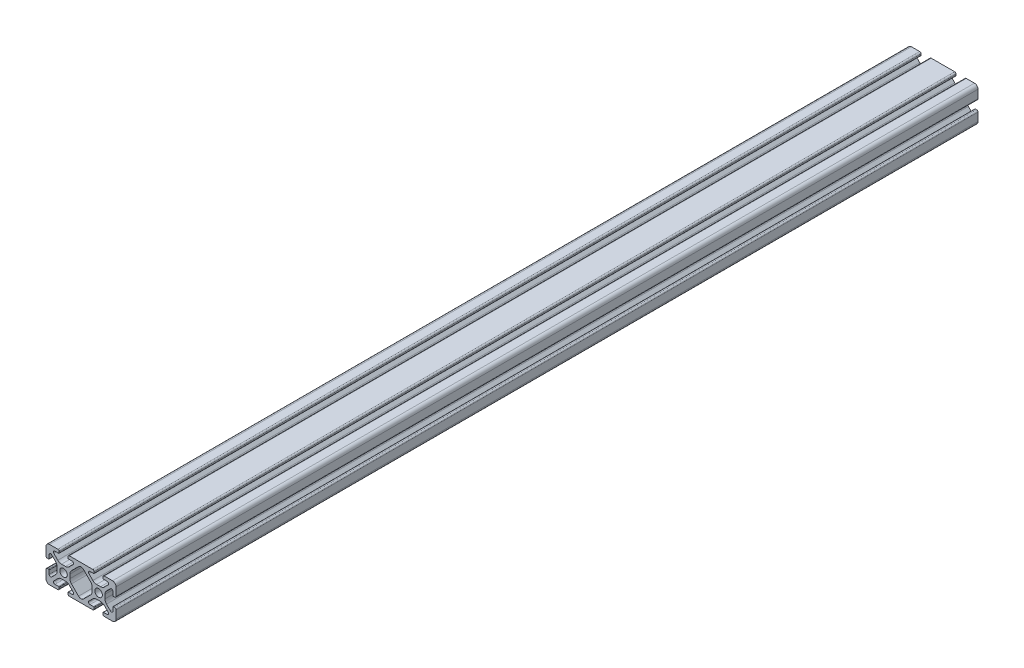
ISO-10303-21;
HEADER;
FILE_DESCRIPTION(('STEP AP214'),'2;1');
FILE_NAME('part.step','',(''),(''),'','','');
FILE_SCHEMA(('AUTOMOTIVE_DESIGN { 1 0 10303 214 1 1 1 1 }'));
ENDSEC;
DATA;
#1=APPLICATION_CONTEXT('core data for automotive mechanical design processes');
#2=APPLICATION_PROTOCOL_DEFINITION('international standard','automotive_design',2000,#1);
#3=PRODUCT_CONTEXT('',#1,'mechanical');
#4=PRODUCT('Part','Part','',(#3));
#5=PRODUCT_RELATED_PRODUCT_CATEGORY('part','',(#4));
#6=PRODUCT_DEFINITION_FORMATION('','',#4);
#7=PRODUCT_DEFINITION_CONTEXT('part definition',#1,'design');
#8=PRODUCT_DEFINITION('design','',#6,#7);
#9=PRODUCT_DEFINITION_SHAPE('','',#8);
#10=(LENGTH_UNIT() NAMED_UNIT(*) SI_UNIT(.MILLI.,.METRE.));
#11=(NAMED_UNIT(*) PLANE_ANGLE_UNIT() SI_UNIT($,.RADIAN.));
#12=(NAMED_UNIT(*) SI_UNIT($,.STERADIAN.) SOLID_ANGLE_UNIT());
#13=UNCERTAINTY_MEASURE_WITH_UNIT(LENGTH_MEASURE(1.E-05),#10,'distance_accuracy_value','');
#14=(GEOMETRIC_REPRESENTATION_CONTEXT(3) GLOBAL_UNCERTAINTY_ASSIGNED_CONTEXT((#13)) GLOBAL_UNIT_ASSIGNED_CONTEXT((#10,
#11,#12)) REPRESENTATION_CONTEXT('',''));
#15=CARTESIAN_POINT('',(0.,0.,0.));
#16=DIRECTION('',(0.,0.,1.));
#17=DIRECTION('',(1.,0.,0.));
#18=AXIS2_PLACEMENT_3D('',#15,#16,#17);
#19=CARTESIAN_POINT('',(32.8,1.5,-492.));
#20=DIRECTION('',(0.,0.,1.));
#21=DIRECTION('',(1.,0.,0.));
#22=AXIS2_PLACEMENT_3D('',#19,#20,#21);
#23=CYLINDRICAL_SURFACE('',#22,0.300000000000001);
#24=CARTESIAN_POINT('',(32.8,1.5,0.));
#25=DIRECTION('',(0.,0.,1.));
#26=DIRECTION('',(1.,0.,0.));
#27=AXIS2_PLACEMENT_3D('',#24,#25,#26);
#28=CIRCLE('',#27,0.300000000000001);
#29=CARTESIAN_POINT('',(32.8,1.8,0.));
#30=VERTEX_POINT('',#29);
#31=CARTESIAN_POINT('',(32.5,1.5,0.));
#32=VERTEX_POINT('',#31);
#33=EDGE_CURVE('E871',#30,#32,#28,.T.);
#34=ORIENTED_EDGE('',*,*,#33,.F.);
#35=DIRECTION('',(0.,0.,1.));
#36=VECTOR('',#35,1.);
#37=CARTESIAN_POINT('',(32.8,1.8,-492.));
#38=LINE('',#37,#36);
#39=CARTESIAN_POINT('',(32.8,1.8,-492.));
#40=VERTEX_POINT('',#39);
#41=EDGE_CURVE('E11',#40,#30,#38,.T.);
#42=ORIENTED_EDGE('',*,*,#41,.F.);
#43=CARTESIAN_POINT('',(32.8,1.5,-492.));
#44=DIRECTION('',(0.,0.,1.));
#45=DIRECTION('',(1.,0.,0.));
#46=AXIS2_PLACEMENT_3D('',#43,#44,#45);
#47=CIRCLE('',#46,0.300000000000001);
#48=CARTESIAN_POINT('',(32.5,1.5,-492.));
#49=VERTEX_POINT('',#48);
#50=EDGE_CURVE('E874',#40,#49,#47,.T.);
#51=ORIENTED_EDGE('',*,*,#50,.T.);
#52=DIRECTION('',(0.,0.,1.));
#53=VECTOR('',#52,1.);
#54=CARTESIAN_POINT('',(32.5,1.5,-492.));
#55=LINE('',#54,#53);
#56=EDGE_CURVE('E42',#49,#32,#55,.T.);
#57=ORIENTED_EDGE('',*,*,#56,.T.);
#58=EDGE_LOOP('',(#34,#42,#51,#57));
#59=FACE_BOUND('',#58,.T.);
#60=ADVANCED_FACE('F39',(#59),#23,.T.);
#61=CARTESIAN_POINT('',(34.919610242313,1.80000000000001,-492.));
#62=DIRECTION('',(0.,1.,0.));
#63=DIRECTION('',(-1.,0.,0.));
#64=AXIS2_PLACEMENT_3D('',#61,#62,#63);
#65=PLANE('',#64);
#66=DIRECTION('',(-1.,0.,0.));
#67=VECTOR('',#66,1.);
#68=CARTESIAN_POINT('',(34.919610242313,1.80000000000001,0.));
#69=LINE('',#68,#67);
#70=CARTESIAN_POINT('',(34.919610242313,1.80000000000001,0.));
#71=VERTEX_POINT('',#70);
#72=EDGE_CURVE('E878',#71,#30,#69,.T.);
#73=ORIENTED_EDGE('',*,*,#72,.F.);
#74=DIRECTION('',(0.,0.,1.));
#75=VECTOR('',#74,1.);
#76=CARTESIAN_POINT('',(34.919610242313,1.80000000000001,-492.));
#77=LINE('',#76,#75);
#78=CARTESIAN_POINT('',(34.919610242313,1.80000000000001,-492.));
#79=VERTEX_POINT('',#78);
#80=EDGE_CURVE('E48',#79,#71,#77,.T.);
#81=ORIENTED_EDGE('',*,*,#80,.F.);
#82=DIRECTION('',(-1.,0.,0.));
#83=VECTOR('',#82,1.);
#84=CARTESIAN_POINT('',(34.919610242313,1.80000000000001,-492.));
#85=LINE('',#84,#83);
#86=EDGE_CURVE('E1184',#79,#40,#85,.T.);
#87=ORIENTED_EDGE('',*,*,#86,.T.);
#88=ORIENTED_EDGE('',*,*,#41,.T.);
#89=EDGE_LOOP('',(#73,#81,#87,#88));
#90=FACE_BOUND('',#89,.T.);
#91=ADVANCED_FACE('F1780',(#90),#65,.T.);
#92=CARTESIAN_POINT('',(34.919610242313,2.63157674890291,-492.));
#93=DIRECTION('',(0.,0.,1.));
#94=DIRECTION('',(1.,0.,0.));
#95=AXIS2_PLACEMENT_3D('',#92,#93,#94);
#96=CYLINDRICAL_SURFACE('',#95,0.831576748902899);
#97=CARTESIAN_POINT('',(34.919610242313,2.63157674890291,0.));
#98=DIRECTION('',(0.,0.,-1.));
#99=DIRECTION('',(-1.,0.,0.));
#100=AXIS2_PLACEMENT_3D('',#97,#98,#99);
#101=CIRCLE('',#100,0.831576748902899);
#102=CARTESIAN_POINT('',(35.5076236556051,3.21959045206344,0.));
#103=VERTEX_POINT('',#102);
#104=EDGE_CURVE('E1492',#103,#71,#101,.T.);
#105=ORIENTED_EDGE('',*,*,#104,.F.);
#106=DIRECTION('',(0.,0.,1.));
#107=VECTOR('',#106,1.);
#108=CARTESIAN_POINT('',(35.5076236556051,3.21959045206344,-492.));
#109=LINE('',#108,#107);
#110=CARTESIAN_POINT('',(35.5076236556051,3.21959045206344,-492.));
#111=VERTEX_POINT('',#110);
#112=EDGE_CURVE('E1499',#111,#103,#109,.T.);
#113=ORIENTED_EDGE('',*,*,#112,.F.);
#114=CARTESIAN_POINT('',(34.919610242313,2.63157674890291,-492.));
#115=DIRECTION('',(0.,0.,-1.));
#116=DIRECTION('',(-1.,0.,0.));
#117=AXIS2_PLACEMENT_3D('',#114,#115,#116);
#118=CIRCLE('',#117,0.831576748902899);
#119=EDGE_CURVE('E1181',#111,#79,#118,.T.);
#120=ORIENTED_EDGE('',*,*,#119,.T.);
#121=ORIENTED_EDGE('',*,*,#80,.T.);
#122=EDGE_LOOP('',(#105,#113,#120,#121));
#123=FACE_BOUND('',#122,.T.);
#124=ADVANCED_FACE('F2184',(#123),#96,.F.);
#125=CARTESIAN_POINT('',(33.2558921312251,5.47132086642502,-492.));
#126=DIRECTION('',(-0.707106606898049,-0.707106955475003,0.));
#127=DIRECTION('',(0.707106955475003,-0.707106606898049,0.));
#128=AXIS2_PLACEMENT_3D('',#125,#126,#127);
#129=PLANE('',#128);
#130=DIRECTION('',(0.707106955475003,-0.707106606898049,0.));
#131=VECTOR('',#130,1.);
#132=CARTESIAN_POINT('',(33.2558921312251,5.47132086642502,0.));
#133=LINE('',#132,#131);
#134=CARTESIAN_POINT('',(33.2558921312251,5.47132086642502,0.));
#135=VERTEX_POINT('',#134);
#136=EDGE_CURVE('E1489',#135,#103,#133,.T.);
#137=ORIENTED_EDGE('',*,*,#136,.F.);
#138=DIRECTION('',(0.,0.,1.));
#139=VECTOR('',#138,1.);
#140=CARTESIAN_POINT('',(33.2558921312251,5.47132086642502,-492.));
#141=LINE('',#140,#139);
#142=CARTESIAN_POINT('',(33.2558921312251,5.47132086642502,-492.));
#143=VERTEX_POINT('',#142);
#144=EDGE_CURVE('E1502',#143,#135,#141,.T.);
#145=ORIENTED_EDGE('',*,*,#144,.F.);
#146=DIRECTION('',(0.707106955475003,-0.707106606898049,0.));
#147=VECTOR('',#146,1.);
#148=CARTESIAN_POINT('',(33.2558921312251,5.47132086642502,-492.));
#149=LINE('',#148,#147);
#150=EDGE_CURVE('E1178',#143,#111,#149,.T.);
#151=ORIENTED_EDGE('',*,*,#150,.T.);
#152=ORIENTED_EDGE('',*,*,#112,.T.);
#153=EDGE_LOOP('',(#137,#145,#151,#152));
#154=FACE_BOUND('',#153,.T.);
#155=ADVANCED_FACE('F2182',(#154),#129,.T.);
#156=CARTESIAN_POINT('',(31.134572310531,3.35000000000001,-492.));
#157=DIRECTION('',(0.,0.,1.));
#158=DIRECTION('',(1.,0.,0.));
#159=AXIS2_PLACEMENT_3D('',#156,#157,#158);
#160=CYLINDRICAL_SURFACE('',#159,3.);
#161=CARTESIAN_POINT('',(31.134572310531,3.35000000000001,0.));
#162=DIRECTION('',(0.,0.,-1.));
#163=DIRECTION('',(-1.,0.,0.));
#164=AXIS2_PLACEMENT_3D('',#161,#162,#163);
#165=CIRCLE('',#164,3.);
#166=CARTESIAN_POINT('',(31.134572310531,6.35000000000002,0.));
#167=VERTEX_POINT('',#166);
#168=EDGE_CURVE('E1486',#167,#135,#165,.T.);
#169=ORIENTED_EDGE('',*,*,#168,.F.);
#170=DIRECTION('',(0.,0.,1.));
#171=VECTOR('',#170,1.);
#172=CARTESIAN_POINT('',(31.134572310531,6.35000000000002,-492.));
#173=LINE('',#172,#171);
#174=CARTESIAN_POINT('',(31.134572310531,6.35000000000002,-492.));
#175=VERTEX_POINT('',#174);
#176=EDGE_CURVE('E1505',#175,#167,#173,.T.);
#177=ORIENTED_EDGE('',*,*,#176,.F.);
#178=CARTESIAN_POINT('',(31.134572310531,3.35000000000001,-492.));
#179=DIRECTION('',(0.,0.,-1.));
#180=DIRECTION('',(-1.,0.,0.));
#181=AXIS2_PLACEMENT_3D('',#178,#179,#180);
#182=CIRCLE('',#181,3.);
#183=EDGE_CURVE('E1175',#175,#143,#182,.T.);
#184=ORIENTED_EDGE('',*,*,#183,.T.);
#185=ORIENTED_EDGE('',*,*,#144,.T.);
#186=EDGE_LOOP('',(#169,#177,#184,#185));
#187=FACE_BOUND('',#186,.T.);
#188=ADVANCED_FACE('F2178',(#187),#160,.F.);
#189=CARTESIAN_POINT('',(28.8666147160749,6.35000000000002,-492.));
#190=DIRECTION('',(0.,-1.,0.));
#191=DIRECTION('',(1.,0.,0.));
#192=AXIS2_PLACEMENT_3D('',#189,#190,#191);
#193=PLANE('',#192);
#194=DIRECTION('',(1.,0.,0.));
#195=VECTOR('',#194,1.);
#196=CARTESIAN_POINT('',(28.8666147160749,6.35000000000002,0.));
#197=LINE('',#196,#195);
#198=CARTESIAN_POINT('',(28.8666147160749,6.35000000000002,0.));
#199=VERTEX_POINT('',#198);
#200=EDGE_CURVE('E1483',#199,#167,#197,.T.);
#201=ORIENTED_EDGE('',*,*,#200,.F.);
#202=DIRECTION('',(0.,0.,1.));
#203=VECTOR('',#202,1.);
#204=CARTESIAN_POINT('',(28.8666147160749,6.35000000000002,-492.));
#205=LINE('',#204,#203);
#206=CARTESIAN_POINT('',(28.8666147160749,6.35000000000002,-492.));
#207=VERTEX_POINT('',#206);
#208=EDGE_CURVE('E1508',#207,#199,#205,.T.);
#209=ORIENTED_EDGE('',*,*,#208,.F.);
#210=DIRECTION('',(1.,0.,0.));
#211=VECTOR('',#210,1.);
#212=CARTESIAN_POINT('',(28.8666147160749,6.35000000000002,-492.));
#213=LINE('',#212,#211);
#214=EDGE_CURVE('E1172',#207,#175,#213,.T.);
#215=ORIENTED_EDGE('',*,*,#214,.T.);
#216=ORIENTED_EDGE('',*,*,#176,.T.);
#217=EDGE_LOOP('',(#201,#209,#215,#216));
#218=FACE_BOUND('',#217,.T.);
#219=ADVANCED_FACE('F2174',(#218),#193,.T.);
#220=CARTESIAN_POINT('',(28.8666147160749,3.35000000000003,-492.));
#221=DIRECTION('',(0.,0.,1.));
#222=DIRECTION('',(1.,0.,0.));
#223=AXIS2_PLACEMENT_3D('',#220,#221,#222);
#224=CYLINDRICAL_SURFACE('',#223,2.99999999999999);
#225=CARTESIAN_POINT('',(28.8666147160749,3.35000000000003,0.));
#226=DIRECTION('',(0.,0.,-1.));
#227=DIRECTION('',(-1.,0.,0.));
#228=AXIS2_PLACEMENT_3D('',#225,#226,#227);
#229=CIRCLE('',#228,2.99999999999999);
#230=CARTESIAN_POINT('',(26.7452943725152,5.47132034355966,0.));
#231=VERTEX_POINT('',#230);
#232=EDGE_CURVE('E1480',#231,#199,#229,.T.);
#233=ORIENTED_EDGE('',*,*,#232,.F.);
#234=DIRECTION('',(0.,0.,1.));
#235=VECTOR('',#234,1.);
#236=CARTESIAN_POINT('',(26.7452943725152,5.47132034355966,-492.));
#237=LINE('',#236,#235);
#238=CARTESIAN_POINT('',(26.7452943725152,5.47132034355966,-492.));
#239=VERTEX_POINT('',#238);
#240=EDGE_CURVE('E1510',#239,#231,#237,.T.);
#241=ORIENTED_EDGE('',*,*,#240,.F.);
#242=CARTESIAN_POINT('',(28.8666147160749,3.35000000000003,-492.));
#243=DIRECTION('',(0.,0.,-1.));
#244=DIRECTION('',(-1.,0.,0.));
#245=AXIS2_PLACEMENT_3D('',#242,#243,#244);
#246=CIRCLE('',#245,2.99999999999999);
#247=EDGE_CURVE('E1169',#239,#207,#246,.T.);
#248=ORIENTED_EDGE('',*,*,#247,.T.);
#249=ORIENTED_EDGE('',*,*,#208,.T.);
#250=EDGE_LOOP('',(#233,#241,#248,#249));
#251=FACE_BOUND('',#250,.T.);
#252=ADVANCED_FACE('F2170',(#251),#224,.F.);
#253=CARTESIAN_POINT('',(24.4935629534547,3.21958892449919,-492.));
#254=DIRECTION('',(0.707106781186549,-0.707106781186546,0.));
#255=DIRECTION('',(0.707106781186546,0.707106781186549,0.));
#256=AXIS2_PLACEMENT_3D('',#253,#254,#255);
#257=PLANE('',#256);
#258=DIRECTION('',(0.707106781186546,0.707106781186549,0.));
#259=VECTOR('',#258,1.);
#260=CARTESIAN_POINT('',(24.4935629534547,3.21958892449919,0.));
#261=LINE('',#260,#259);
#262=CARTESIAN_POINT('',(24.4935629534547,3.21958892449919,0.));
#263=VERTEX_POINT('',#262);
#264=EDGE_CURVE('E1477',#263,#231,#261,.T.);
#265=ORIENTED_EDGE('',*,*,#264,.F.);
#266=DIRECTION('',(0.,0.,1.));
#267=VECTOR('',#266,1.);
#268=CARTESIAN_POINT('',(24.4935629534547,3.21958892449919,-492.));
#269=LINE('',#268,#267);
#270=CARTESIAN_POINT('',(24.4935629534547,3.21958892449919,-492.));
#271=VERTEX_POINT('',#270);
#272=EDGE_CURVE('E1512',#271,#263,#269,.T.);
#273=ORIENTED_EDGE('',*,*,#272,.F.);
#274=DIRECTION('',(0.707106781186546,0.707106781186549,0.));
#275=VECTOR('',#274,1.);
#276=CARTESIAN_POINT('',(24.4935629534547,3.21958892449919,-492.));
#277=LINE('',#276,#275);
#278=EDGE_CURVE('E1166',#271,#239,#277,.T.);
#279=ORIENTED_EDGE('',*,*,#278,.T.);
#280=ORIENTED_EDGE('',*,*,#240,.T.);
#281=EDGE_LOOP('',(#265,#273,#279,#280));
#282=FACE_BOUND('',#281,.T.);
#283=ADVANCED_FACE('F2166',(#282),#257,.T.);
#284=CARTESIAN_POINT('',(25.0815759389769,2.63157593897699,-492.));
#285=DIRECTION('',(0.,0.,1.));
#286=DIRECTION('',(1.,0.,0.));
#287=AXIS2_PLACEMENT_3D('',#284,#285,#286);
#288=CYLINDRICAL_SURFACE('',#287,0.831575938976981);
#289=CARTESIAN_POINT('',(25.0815759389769,2.63157593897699,0.));
#290=DIRECTION('',(0.,0.,-1.));
#291=DIRECTION('',(-1.,0.,0.));
#292=AXIS2_PLACEMENT_3D('',#289,#290,#291);
#293=CIRCLE('',#292,0.831575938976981);
#294=CARTESIAN_POINT('',(25.0815759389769,1.80000000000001,0.));
#295=VERTEX_POINT('',#294);
#296=EDGE_CURVE('E1474',#295,#263,#293,.T.);
#297=ORIENTED_EDGE('',*,*,#296,.F.);
#298=DIRECTION('',(0.,0.,1.));
#299=VECTOR('',#298,1.);
#300=CARTESIAN_POINT('',(25.0815759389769,1.80000000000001,-492.));
#301=LINE('',#300,#299);
#302=CARTESIAN_POINT('',(25.0815759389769,1.80000000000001,-492.));
#303=VERTEX_POINT('',#302);
#304=EDGE_CURVE('E1514',#303,#295,#301,.T.);
#305=ORIENTED_EDGE('',*,*,#304,.F.);
#306=CARTESIAN_POINT('',(25.0815759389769,2.63157593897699,-492.));
#307=DIRECTION('',(0.,0.,-1.));
#308=DIRECTION('',(-1.,0.,0.));
#309=AXIS2_PLACEMENT_3D('',#306,#307,#308);
#310=CIRCLE('',#309,0.831575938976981);
#311=EDGE_CURVE('E1163',#303,#271,#310,.T.);
#312=ORIENTED_EDGE('',*,*,#311,.T.);
#313=ORIENTED_EDGE('',*,*,#272,.T.);
#314=EDGE_LOOP('',(#297,#305,#312,#313));
#315=FACE_BOUND('',#314,.T.);
#316=ADVANCED_FACE('F2162',(#315),#288,.F.);
#317=CARTESIAN_POINT('',(27.2,1.80000000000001,-492.));
#318=DIRECTION('',(0.,1.,0.));
#319=DIRECTION('',(0.,0.,1.));
#320=AXIS2_PLACEMENT_3D('',#317,#318,#319);
#321=PLANE('',#320);
#322=DIRECTION('',(-1.,0.,0.));
#323=VECTOR('',#322,1.);
#324=CARTESIAN_POINT('',(27.2,1.80000000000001,0.));
#325=LINE('',#324,#323);
#326=CARTESIAN_POINT('',(27.2,1.80000000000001,0.));
#327=VERTEX_POINT('',#326);
#328=EDGE_CURVE('E1471',#327,#295,#325,.T.);
#329=ORIENTED_EDGE('',*,*,#328,.F.);
#330=DIRECTION('',(0.,0.,1.));
#331=VECTOR('',#330,1.);
#332=CARTESIAN_POINT('',(27.2,1.80000000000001,-492.));
#333=LINE('',#332,#331);
#334=CARTESIAN_POINT('',(27.2,1.80000000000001,-492.));
#335=VERTEX_POINT('',#334);
#336=EDGE_CURVE('E1516',#335,#327,#333,.T.);
#337=ORIENTED_EDGE('',*,*,#336,.F.);
#338=DIRECTION('',(-1.,0.,0.));
#339=VECTOR('',#338,1.);
#340=CARTESIAN_POINT('',(27.2,1.80000000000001,-492.));
#341=LINE('',#340,#339);
#342=EDGE_CURVE('E1160',#335,#303,#341,.T.);
#343=ORIENTED_EDGE('',*,*,#342,.T.);
#344=ORIENTED_EDGE('',*,*,#304,.T.);
#345=EDGE_LOOP('',(#329,#337,#343,#344));
#346=FACE_BOUND('',#345,.T.);
#347=ADVANCED_FACE('F2158',(#346),#321,.T.);
#348=CARTESIAN_POINT('',(27.2,1.50000000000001,-492.));
#349=DIRECTION('',(0.,0.,1.));
#350=DIRECTION('',(1.,0.,0.));
#351=AXIS2_PLACEMENT_3D('',#348,#349,#350);
#352=CYLINDRICAL_SURFACE('',#351,0.299999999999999);
#353=CARTESIAN_POINT('',(27.2,1.50000000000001,0.));
#354=DIRECTION('',(0.,0.,1.));
#355=DIRECTION('',(1.,0.,0.));
#356=AXIS2_PLACEMENT_3D('',#353,#354,#355);
#357=CIRCLE('',#356,0.299999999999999);
#358=CARTESIAN_POINT('',(27.5,1.50000000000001,0.));
#359=VERTEX_POINT('',#358);
#360=EDGE_CURVE('E1468',#359,#327,#357,.T.);
#361=ORIENTED_EDGE('',*,*,#360,.F.);
#362=DIRECTION('',(0.,0.,1.));
#363=VECTOR('',#362,1.);
#364=CARTESIAN_POINT('',(27.5,1.50000000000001,-492.));
#365=LINE('',#364,#363);
#366=CARTESIAN_POINT('',(27.5,1.50000000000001,-492.));
#367=VERTEX_POINT('',#366);
#368=EDGE_CURVE('E1518',#367,#359,#365,.T.);
#369=ORIENTED_EDGE('',*,*,#368,.F.);
#370=CARTESIAN_POINT('',(27.2,1.50000000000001,-492.));
#371=DIRECTION('',(0.,0.,1.));
#372=DIRECTION('',(1.,0.,0.));
#373=AXIS2_PLACEMENT_3D('',#370,#371,#372);
#374=CIRCLE('',#373,0.299999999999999);
#375=EDGE_CURVE('E1157',#367,#335,#374,.T.);
#376=ORIENTED_EDGE('',*,*,#375,.T.);
#377=ORIENTED_EDGE('',*,*,#336,.T.);
#378=EDGE_LOOP('',(#361,#369,#376,#377));
#379=FACE_BOUND('',#378,.T.);
#380=ADVANCED_FACE('F2154',(#379),#352,.T.);
#381=CARTESIAN_POINT('',(27.5,0.799999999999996,-492.));
#382=DIRECTION('',(1.,0.,0.));
#383=DIRECTION('',(0.,1.,0.));
#384=AXIS2_PLACEMENT_3D('',#381,#382,#383);
#385=PLANE('',#384);
#386=DIRECTION('',(0.,1.,0.));
#387=VECTOR('',#386,1.);
#388=CARTESIAN_POINT('',(27.5,0.799999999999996,0.));
#389=LINE('',#388,#387);
#390=CARTESIAN_POINT('',(27.5,0.799999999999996,0.));
#391=VERTEX_POINT('',#390);
#392=EDGE_CURVE('E1465',#391,#359,#389,.T.);
#393=ORIENTED_EDGE('',*,*,#392,.F.);
#394=DIRECTION('',(0.,0.,1.));
#395=VECTOR('',#394,1.);
#396=CARTESIAN_POINT('',(27.5,0.799999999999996,-492.));
#397=LINE('',#396,#395);
#398=CARTESIAN_POINT('',(27.5,0.799999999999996,-492.));
#399=VERTEX_POINT('',#398);
#400=EDGE_CURVE('E1520',#399,#391,#397,.T.);
#401=ORIENTED_EDGE('',*,*,#400,.F.);
#402=DIRECTION('',(0.,1.,0.));
#403=VECTOR('',#402,1.);
#404=CARTESIAN_POINT('',(27.5,0.799999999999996,-492.));
#405=LINE('',#404,#403);
#406=EDGE_CURVE('E1154',#399,#367,#405,.T.);
#407=ORIENTED_EDGE('',*,*,#406,.T.);
#408=ORIENTED_EDGE('',*,*,#368,.T.);
#409=EDGE_LOOP('',(#393,#401,#407,#408));
#410=FACE_BOUND('',#409,.T.);
#411=ADVANCED_FACE('F2150',(#410),#385,.T.);
#412=CARTESIAN_POINT('',(26.7,0.799999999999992,-492.));
#413=DIRECTION('',(0.,0.,1.));
#414=DIRECTION('',(1.,0.,0.));
#415=AXIS2_PLACEMENT_3D('',#412,#413,#414);
#416=CYLINDRICAL_SURFACE('',#415,0.800000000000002);
#417=CARTESIAN_POINT('',(26.7,0.799999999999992,0.));
#418=DIRECTION('',(0.,0.,1.));
#419=DIRECTION('',(1.,0.,0.));
#420=AXIS2_PLACEMENT_3D('',#417,#418,#419);
#421=CIRCLE('',#420,0.800000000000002);
#422=CARTESIAN_POINT('',(26.7,0.,0.));
#423=VERTEX_POINT('',#422);
#424=EDGE_CURVE('E1462',#423,#391,#421,.T.);
#425=ORIENTED_EDGE('',*,*,#424,.F.);
#426=DIRECTION('',(0.,0.,1.));
#427=VECTOR('',#426,1.);
#428=CARTESIAN_POINT('',(26.7,0.,-492.));
#429=LINE('',#428,#427);
#430=CARTESIAN_POINT('',(26.7,0.,-492.));
#431=VERTEX_POINT('',#430);
#432=EDGE_CURVE('E1522',#431,#423,#429,.T.);
#433=ORIENTED_EDGE('',*,*,#432,.F.);
#434=CARTESIAN_POINT('',(26.7,0.799999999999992,-492.));
#435=DIRECTION('',(0.,0.,1.));
#436=DIRECTION('',(1.,0.,0.));
#437=AXIS2_PLACEMENT_3D('',#434,#435,#436);
#438=CIRCLE('',#437,0.800000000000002);
#439=EDGE_CURVE('E1151',#431,#399,#438,.T.);
#440=ORIENTED_EDGE('',*,*,#439,.T.);
#441=ORIENTED_EDGE('',*,*,#400,.T.);
#442=EDGE_LOOP('',(#425,#433,#440,#441));
#443=FACE_BOUND('',#442,.T.);
#444=ADVANCED_FACE('F2146',(#443),#416,.T.);
#445=CARTESIAN_POINT('',(13.3,0.,-492.));
#446=DIRECTION('',(0.,-1.,0.));
#447=DIRECTION('',(0.,0.,-1.));
#448=AXIS2_PLACEMENT_3D('',#445,#446,#447);
#449=PLANE('',#448);
#450=DIRECTION('',(1.,0.,0.));
#451=VECTOR('',#450,1.);
#452=CARTESIAN_POINT('',(13.3,0.,0.));
#453=LINE('',#452,#451);
#454=CARTESIAN_POINT('',(13.3,0.,0.));
#455=VERTEX_POINT('',#454);
#456=EDGE_CURVE('E1459',#455,#423,#453,.T.);
#457=ORIENTED_EDGE('',*,*,#456,.F.);
#458=DIRECTION('',(0.,0.,1.));
#459=VECTOR('',#458,1.);
#460=CARTESIAN_POINT('',(13.3,0.,-492.));
#461=LINE('',#460,#459);
#462=CARTESIAN_POINT('',(13.3,0.,-492.));
#463=VERTEX_POINT('',#462);
#464=EDGE_CURVE('E1524',#463,#455,#461,.T.);
#465=ORIENTED_EDGE('',*,*,#464,.F.);
#466=DIRECTION('',(1.,0.,0.));
#467=VECTOR('',#466,1.);
#468=CARTESIAN_POINT('',(13.3,0.,-492.));
#469=LINE('',#468,#467);
#470=EDGE_CURVE('E1148',#463,#431,#469,.T.);
#471=ORIENTED_EDGE('',*,*,#470,.T.);
#472=ORIENTED_EDGE('',*,*,#432,.T.);
#473=EDGE_LOOP('',(#457,#465,#471,#472));
#474=FACE_BOUND('',#473,.T.);
#475=ADVANCED_FACE('F2142',(#474),#449,.T.);
#476=CARTESIAN_POINT('',(13.3,0.800000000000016,-492.));
#477=DIRECTION('',(0.,0.,1.));
#478=DIRECTION('',(1.,0.,0.));
#479=AXIS2_PLACEMENT_3D('',#476,#477,#478);
#480=CYLINDRICAL_SURFACE('',#479,0.800000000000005);
#481=CARTESIAN_POINT('',(13.3,0.800000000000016,0.));
#482=DIRECTION('',(0.,0.,1.));
#483=DIRECTION('',(1.,0.,0.));
#484=AXIS2_PLACEMENT_3D('',#481,#482,#483);
#485=CIRCLE('',#484,0.800000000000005);
#486=CARTESIAN_POINT('',(12.5,0.800000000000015,0.));
#487=VERTEX_POINT('',#486);
#488=EDGE_CURVE('E1456',#487,#455,#485,.T.);
#489=ORIENTED_EDGE('',*,*,#488,.F.);
#490=DIRECTION('',(0.,0.,1.));
#491=VECTOR('',#490,1.);
#492=CARTESIAN_POINT('',(12.5,0.800000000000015,-492.));
#493=LINE('',#492,#491);
#494=CARTESIAN_POINT('',(12.5,0.800000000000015,-492.));
#495=VERTEX_POINT('',#494);
#496=EDGE_CURVE('E1526',#495,#487,#493,.T.);
#497=ORIENTED_EDGE('',*,*,#496,.F.);
#498=CARTESIAN_POINT('',(13.3,0.800000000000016,-492.));
#499=DIRECTION('',(0.,0.,1.));
#500=DIRECTION('',(1.,0.,0.));
#501=AXIS2_PLACEMENT_3D('',#498,#499,#500);
#502=CIRCLE('',#501,0.800000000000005);
#503=EDGE_CURVE('E1145',#495,#463,#502,.T.);
#504=ORIENTED_EDGE('',*,*,#503,.T.);
#505=ORIENTED_EDGE('',*,*,#464,.T.);
#506=EDGE_LOOP('',(#489,#497,#504,#505));
#507=FACE_BOUND('',#506,.T.);
#508=ADVANCED_FACE('F2138',(#507),#480,.T.);
#509=CARTESIAN_POINT('',(12.5,1.5,-492.));
#510=DIRECTION('',(-1.,0.,0.));
#511=DIRECTION('',(0.,-1.,0.));
#512=AXIS2_PLACEMENT_3D('',#509,#510,#511);
#513=PLANE('',#512);
#514=DIRECTION('',(0.,-1.,0.));
#515=VECTOR('',#514,1.);
#516=CARTESIAN_POINT('',(12.5,1.5,0.));
#517=LINE('',#516,#515);
#518=CARTESIAN_POINT('',(12.5,1.5,0.));
#519=VERTEX_POINT('',#518);
#520=EDGE_CURVE('E1453',#519,#487,#517,.T.);
#521=ORIENTED_EDGE('',*,*,#520,.F.);
#522=DIRECTION('',(0.,0.,1.));
#523=VECTOR('',#522,1.);
#524=CARTESIAN_POINT('',(12.5,1.5,-492.));
#525=LINE('',#524,#523);
#526=CARTESIAN_POINT('',(12.5,1.5,-492.));
#527=VERTEX_POINT('',#526);
#528=EDGE_CURVE('E1528',#527,#519,#525,.T.);
#529=ORIENTED_EDGE('',*,*,#528,.F.);
#530=DIRECTION('',(0.,-1.,0.));
#531=VECTOR('',#530,1.);
#532=CARTESIAN_POINT('',(12.5,1.5,-492.));
#533=LINE('',#532,#531);
#534=EDGE_CURVE('E1142',#527,#495,#533,.T.);
#535=ORIENTED_EDGE('',*,*,#534,.T.);
#536=ORIENTED_EDGE('',*,*,#496,.T.);
#537=EDGE_LOOP('',(#521,#529,#535,#536));
#538=FACE_BOUND('',#537,.T.);
#539=ADVANCED_FACE('F2134',(#538),#513,.T.);
#540=CARTESIAN_POINT('',(12.8,1.5,-492.));
#541=DIRECTION('',(0.,0.,1.));
#542=DIRECTION('',(1.,0.,0.));
#543=AXIS2_PLACEMENT_3D('',#540,#541,#542);
#544=CYLINDRICAL_SURFACE('',#543,0.3);
#545=CARTESIAN_POINT('',(12.8,1.5,0.));
#546=DIRECTION('',(0.,0.,1.));
#547=DIRECTION('',(1.,0.,0.));
#548=AXIS2_PLACEMENT_3D('',#545,#546,#547);
#549=CIRCLE('',#548,0.3);
#550=CARTESIAN_POINT('',(12.8,1.8,0.));
#551=VERTEX_POINT('',#550);
#552=EDGE_CURVE('E1450',#551,#519,#549,.T.);
#553=ORIENTED_EDGE('',*,*,#552,.F.);
#554=DIRECTION('',(0.,0.,1.));
#555=VECTOR('',#554,1.);
#556=CARTESIAN_POINT('',(12.8,1.8,-492.));
#557=LINE('',#556,#555);
#558=CARTESIAN_POINT('',(12.8,1.8,-492.));
#559=VERTEX_POINT('',#558);
#560=EDGE_CURVE('E1531',#559,#551,#557,.T.);
#561=ORIENTED_EDGE('',*,*,#560,.F.);
#562=CARTESIAN_POINT('',(12.8,1.5,-492.));
#563=DIRECTION('',(0.,0.,1.));
#564=DIRECTION('',(1.,0.,0.));
#565=AXIS2_PLACEMENT_3D('',#562,#563,#564);
#566=CIRCLE('',#565,0.3);
#567=EDGE_CURVE('E1139',#559,#527,#566,.T.);
#568=ORIENTED_EDGE('',*,*,#567,.T.);
#569=ORIENTED_EDGE('',*,*,#528,.T.);
#570=EDGE_LOOP('',(#553,#561,#568,#569));
#571=FACE_BOUND('',#570,.T.);
#572=ADVANCED_FACE('F2130',(#571),#544,.T.);
#573=CARTESIAN_POINT('',(14.918424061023,1.8,-492.));
#574=DIRECTION('',(0.,1.,0.));
#575=DIRECTION('',(-1.,0.,0.));
#576=AXIS2_PLACEMENT_3D('',#573,#574,#575);
#577=PLANE('',#576);
#578=DIRECTION('',(-1.,0.,0.));
#579=VECTOR('',#578,1.);
#580=CARTESIAN_POINT('',(14.918424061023,1.8,0.));
#581=LINE('',#580,#579);
#582=CARTESIAN_POINT('',(14.918424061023,1.8,0.));
#583=VERTEX_POINT('',#582);
#584=EDGE_CURVE('E1447',#583,#551,#581,.T.);
#585=ORIENTED_EDGE('',*,*,#584,.F.);
#586=DIRECTION('',(0.,0.,1.));
#587=VECTOR('',#586,1.);
#588=CARTESIAN_POINT('',(14.918424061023,1.8,-492.));
#589=LINE('',#588,#587);
#590=CARTESIAN_POINT('',(14.918424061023,1.8,-492.));
#591=VERTEX_POINT('',#590);
#592=EDGE_CURVE('E1534',#591,#583,#589,.T.);
#593=ORIENTED_EDGE('',*,*,#592,.F.);
#594=DIRECTION('',(-1.,0.,0.));
#595=VECTOR('',#594,1.);
#596=CARTESIAN_POINT('',(14.918424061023,1.8,-492.));
#597=LINE('',#596,#595);
#598=EDGE_CURVE('E1136',#591,#559,#597,.T.);
#599=ORIENTED_EDGE('',*,*,#598,.T.);
#600=ORIENTED_EDGE('',*,*,#560,.T.);
#601=EDGE_LOOP('',(#585,#593,#599,#600));
#602=FACE_BOUND('',#601,.T.);
#603=ADVANCED_FACE('F2126',(#602),#577,.T.);
#604=CARTESIAN_POINT('',(14.918424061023,2.63157593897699,-492.));
#605=DIRECTION('',(0.,0.,1.));
#606=DIRECTION('',(1.,0.,0.));
#607=AXIS2_PLACEMENT_3D('',#604,#605,#606);
#608=CYLINDRICAL_SURFACE('',#607,0.831575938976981);
#609=CARTESIAN_POINT('',(14.918424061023,2.63157593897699,0.));
#610=DIRECTION('',(0.,0.,-1.));
#611=DIRECTION('',(-1.,0.,0.));
#612=AXIS2_PLACEMENT_3D('',#609,#610,#611);
#613=CIRCLE('',#612,0.831575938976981);
#614=CARTESIAN_POINT('',(15.5064370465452,3.21958892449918,0.));
#615=VERTEX_POINT('',#614);
#616=EDGE_CURVE('E1444',#615,#583,#613,.T.);
#617=ORIENTED_EDGE('',*,*,#616,.F.);
#618=DIRECTION('',(0.,0.,1.));
#619=VECTOR('',#618,1.);
#620=CARTESIAN_POINT('',(15.5064370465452,3.21958892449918,-492.));
#621=LINE('',#620,#619);
#622=CARTESIAN_POINT('',(15.5064370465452,3.21958892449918,-492.));
#623=VERTEX_POINT('',#622);
#624=EDGE_CURVE('E1536',#623,#615,#621,.T.);
#625=ORIENTED_EDGE('',*,*,#624,.F.);
#626=CARTESIAN_POINT('',(14.918424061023,2.63157593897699,-492.));
#627=DIRECTION('',(0.,0.,-1.));
#628=DIRECTION('',(-1.,0.,0.));
#629=AXIS2_PLACEMENT_3D('',#626,#627,#628);
#630=CIRCLE('',#629,0.831575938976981);
#631=EDGE_CURVE('E1133',#623,#591,#630,.T.);
#632=ORIENTED_EDGE('',*,*,#631,.T.);
#633=ORIENTED_EDGE('',*,*,#592,.T.);
#634=EDGE_LOOP('',(#617,#625,#632,#633));
#635=FACE_BOUND('',#634,.T.);
#636=ADVANCED_FACE('F2122',(#635),#608,.F.);
#637=CARTESIAN_POINT('',(13.2547056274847,5.47132034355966,-492.));
#638=DIRECTION('',(-0.70710678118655,-0.707106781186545,0.));
#639=DIRECTION('',(0.707106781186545,-0.70710678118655,0.));
#640=AXIS2_PLACEMENT_3D('',#637,#638,#639);
#641=PLANE('',#640);
#642=DIRECTION('',(0.707106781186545,-0.70710678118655,0.));
#643=VECTOR('',#642,1.);
#644=CARTESIAN_POINT('',(13.2547056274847,5.47132034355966,0.));
#645=LINE('',#644,#643);
#646=CARTESIAN_POINT('',(13.2547056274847,5.47132034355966,0.));
#647=VERTEX_POINT('',#646);
#648=EDGE_CURVE('E1441',#647,#615,#645,.T.);
#649=ORIENTED_EDGE('',*,*,#648,.F.);
#650=DIRECTION('',(0.,0.,1.));
#651=VECTOR('',#650,1.);
#652=CARTESIAN_POINT('',(13.2547056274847,5.47132034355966,-492.));
#653=LINE('',#652,#651);
#654=CARTESIAN_POINT('',(13.2547056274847,5.47132034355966,-492.));
#655=VERTEX_POINT('',#654);
#656=EDGE_CURVE('E1539',#655,#647,#653,.T.);
#657=ORIENTED_EDGE('',*,*,#656,.F.);
#658=DIRECTION('',(0.707106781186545,-0.70710678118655,0.));
#659=VECTOR('',#658,1.);
#660=CARTESIAN_POINT('',(13.2547056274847,5.47132034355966,-492.));
#661=LINE('',#660,#659);
#662=EDGE_CURVE('E1130',#655,#623,#661,.T.);
#663=ORIENTED_EDGE('',*,*,#662,.T.);
#664=ORIENTED_EDGE('',*,*,#624,.T.);
#665=EDGE_LOOP('',(#649,#657,#663,#664));
#666=FACE_BOUND('',#665,.T.);
#667=ADVANCED_FACE('F2118',(#666),#641,.T.);
#668=CARTESIAN_POINT('',(11.1333852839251,3.35000000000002,-492.));
#669=DIRECTION('',(0.,0.,1.));
#670=DIRECTION('',(1.,0.,0.));
#671=AXIS2_PLACEMENT_3D('',#668,#669,#670);
#672=CYLINDRICAL_SURFACE('',#671,3.);
#673=CARTESIAN_POINT('',(11.1333852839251,3.35000000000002,0.));
#674=DIRECTION('',(0.,0.,-1.));
#675=DIRECTION('',(-1.,0.,0.));
#676=AXIS2_PLACEMENT_3D('',#673,#674,#675);
#677=CIRCLE('',#676,3.);
#678=CARTESIAN_POINT('',(11.1333852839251,6.35000000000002,0.));
#679=VERTEX_POINT('',#678);
#680=EDGE_CURVE('E1438',#679,#647,#677,.T.);
#681=ORIENTED_EDGE('',*,*,#680,.F.);
#682=DIRECTION('',(0.,0.,1.));
#683=VECTOR('',#682,1.);
#684=CARTESIAN_POINT('',(11.1333852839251,6.35000000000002,-492.));
#685=LINE('',#684,#683);
#686=CARTESIAN_POINT('',(11.1333852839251,6.35000000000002,-492.));
#687=VERTEX_POINT('',#686);
#688=EDGE_CURVE('E1542',#687,#679,#685,.T.);
#689=ORIENTED_EDGE('',*,*,#688,.F.);
#690=CARTESIAN_POINT('',(11.1333852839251,3.35000000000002,-492.));
#691=DIRECTION('',(0.,0.,-1.));
#692=DIRECTION('',(-1.,0.,0.));
#693=AXIS2_PLACEMENT_3D('',#690,#691,#692);
#694=CIRCLE('',#693,3.);
#695=EDGE_CURVE('E1127',#687,#655,#694,.T.);
#696=ORIENTED_EDGE('',*,*,#695,.T.);
#697=ORIENTED_EDGE('',*,*,#656,.T.);
#698=EDGE_LOOP('',(#681,#689,#696,#697));
#699=FACE_BOUND('',#698,.T.);
#700=ADVANCED_FACE('F2114',(#699),#672,.F.);
#701=CARTESIAN_POINT('',(8.86661471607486,6.35000000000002,-492.));
#702=DIRECTION('',(0.,-1.,0.));
#703=DIRECTION('',(1.,0.,0.));
#704=AXIS2_PLACEMENT_3D('',#701,#702,#703);
#705=PLANE('',#704);
#706=DIRECTION('',(1.,0.,0.));
#707=VECTOR('',#706,1.);
#708=CARTESIAN_POINT('',(8.86661471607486,6.35000000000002,0.));
#709=LINE('',#708,#707);
#710=CARTESIAN_POINT('',(8.86661471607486,6.35000000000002,0.));
#711=VERTEX_POINT('',#710);
#712=EDGE_CURVE('E1435',#711,#679,#709,.T.);
#713=ORIENTED_EDGE('',*,*,#712,.F.);
#714=DIRECTION('',(0.,0.,1.));
#715=VECTOR('',#714,1.);
#716=CARTESIAN_POINT('',(8.86661471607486,6.35000000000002,-492.));
#717=LINE('',#716,#715);
#718=CARTESIAN_POINT('',(8.86661471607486,6.35000000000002,-492.));
#719=VERTEX_POINT('',#718);
#720=EDGE_CURVE('E1545',#719,#711,#717,.T.);
#721=ORIENTED_EDGE('',*,*,#720,.F.);
#722=DIRECTION('',(1.,0.,0.));
#723=VECTOR('',#722,1.);
#724=CARTESIAN_POINT('',(8.86661471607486,6.35000000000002,-492.));
#725=LINE('',#724,#723);
#726=EDGE_CURVE('E1124',#719,#687,#725,.T.);
#727=ORIENTED_EDGE('',*,*,#726,.T.);
#728=ORIENTED_EDGE('',*,*,#688,.T.);
#729=EDGE_LOOP('',(#713,#721,#727,#728));
#730=FACE_BOUND('',#729,.T.);
#731=ADVANCED_FACE('F2110',(#730),#705,.T.);
#732=CARTESIAN_POINT('',(8.86661471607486,3.35000000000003,-492.));
#733=DIRECTION('',(0.,0.,1.));
#734=DIRECTION('',(1.,0.,0.));
#735=AXIS2_PLACEMENT_3D('',#732,#733,#734);
#736=CYLINDRICAL_SURFACE('',#735,2.99999999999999);
#737=CARTESIAN_POINT('',(8.86661471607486,3.35000000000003,0.));
#738=DIRECTION('',(0.,0.,-1.));
#739=DIRECTION('',(-1.,0.,0.));
#740=AXIS2_PLACEMENT_3D('',#737,#738,#739);
#741=CIRCLE('',#740,2.99999999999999);
#742=CARTESIAN_POINT('',(6.74529437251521,5.47132034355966,0.));
#743=VERTEX_POINT('',#742);
#744=EDGE_CURVE('E1432',#743,#711,#741,.T.);
#745=ORIENTED_EDGE('',*,*,#744,.F.);
#746=DIRECTION('',(0.,0.,1.));
#747=VECTOR('',#746,1.);
#748=CARTESIAN_POINT('',(6.74529437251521,5.47132034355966,-492.));
#749=LINE('',#748,#747);
#750=CARTESIAN_POINT('',(6.74529437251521,5.47132034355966,-492.));
#751=VERTEX_POINT('',#750);
#752=EDGE_CURVE('E1548',#751,#743,#749,.T.);
#753=ORIENTED_EDGE('',*,*,#752,.F.);
#754=CARTESIAN_POINT('',(8.86661471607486,3.35000000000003,-492.));
#755=DIRECTION('',(0.,0.,-1.));
#756=DIRECTION('',(-1.,0.,0.));
#757=AXIS2_PLACEMENT_3D('',#754,#755,#756);
#758=CIRCLE('',#757,2.99999999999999);
#759=EDGE_CURVE('E1121',#751,#719,#758,.T.);
#760=ORIENTED_EDGE('',*,*,#759,.T.);
#761=ORIENTED_EDGE('',*,*,#720,.T.);
#762=EDGE_LOOP('',(#745,#753,#760,#761));
#763=FACE_BOUND('',#762,.T.);
#764=ADVANCED_FACE('F2106',(#763),#736,.F.);
#765=CARTESIAN_POINT('',(4.49356295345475,3.21958892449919,-492.));
#766=DIRECTION('',(0.707106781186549,-0.707106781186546,0.));
#767=DIRECTION('',(0.707106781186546,0.707106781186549,0.));
#768=AXIS2_PLACEMENT_3D('',#765,#766,#767);
#769=PLANE('',#768);
#770=DIRECTION('',(0.707106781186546,0.707106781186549,0.));
#771=VECTOR('',#770,1.);
#772=CARTESIAN_POINT('',(4.49356295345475,3.21958892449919,0.));
#773=LINE('',#772,#771);
#774=CARTESIAN_POINT('',(4.49356295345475,3.21958892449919,0.));
#775=VERTEX_POINT('',#774);
#776=EDGE_CURVE('E1429',#775,#743,#773,.T.);
#777=ORIENTED_EDGE('',*,*,#776,.F.);
#778=DIRECTION('',(0.,0.,1.));
#779=VECTOR('',#778,1.);
#780=CARTESIAN_POINT('',(4.49356295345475,3.21958892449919,-492.));
#781=LINE('',#780,#779);
#782=CARTESIAN_POINT('',(4.49356295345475,3.21958892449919,-492.));
#783=VERTEX_POINT('',#782);
#784=EDGE_CURVE('E1551',#783,#775,#781,.T.);
#785=ORIENTED_EDGE('',*,*,#784,.F.);
#786=DIRECTION('',(0.707106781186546,0.707106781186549,0.));
#787=VECTOR('',#786,1.);
#788=CARTESIAN_POINT('',(4.49356295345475,3.21958892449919,-492.));
#789=LINE('',#788,#787);
#790=EDGE_CURVE('E1118',#783,#751,#789,.T.);
#791=ORIENTED_EDGE('',*,*,#790,.T.);
#792=ORIENTED_EDGE('',*,*,#752,.T.);
#793=EDGE_LOOP('',(#777,#785,#791,#792));
#794=FACE_BOUND('',#793,.T.);
#795=ADVANCED_FACE('F2102',(#794),#769,.T.);
#796=CARTESIAN_POINT('',(5.08157593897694,2.63157593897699,-492.));
#797=DIRECTION('',(0.,0.,1.));
#798=DIRECTION('',(1.,0.,0.));
#799=AXIS2_PLACEMENT_3D('',#796,#797,#798);
#800=CYLINDRICAL_SURFACE('',#799,0.831575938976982);
#801=CARTESIAN_POINT('',(5.08157593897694,2.63157593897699,0.));
#802=DIRECTION('',(0.,0.,-1.));
#803=DIRECTION('',(-1.,0.,0.));
#804=AXIS2_PLACEMENT_3D('',#801,#802,#803);
#805=CIRCLE('',#804,0.831575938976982);
#806=CARTESIAN_POINT('',(5.08157593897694,1.80000000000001,0.));
#807=VERTEX_POINT('',#806);
#808=EDGE_CURVE('E1426',#807,#775,#805,.T.);
#809=ORIENTED_EDGE('',*,*,#808,.F.);
#810=DIRECTION('',(0.,0.,1.));
#811=VECTOR('',#810,1.);
#812=CARTESIAN_POINT('',(5.08157593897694,1.80000000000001,-492.));
#813=LINE('',#812,#811);
#814=CARTESIAN_POINT('',(5.08157593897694,1.80000000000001,-492.));
#815=VERTEX_POINT('',#814);
#816=EDGE_CURVE('E1554',#815,#807,#813,.T.);
#817=ORIENTED_EDGE('',*,*,#816,.F.);
#818=CARTESIAN_POINT('',(5.08157593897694,2.63157593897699,-492.));
#819=DIRECTION('',(0.,0.,-1.));
#820=DIRECTION('',(-1.,0.,0.));
#821=AXIS2_PLACEMENT_3D('',#818,#819,#820);
#822=CIRCLE('',#821,0.831575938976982);
#823=EDGE_CURVE('E1115',#815,#783,#822,.T.);
#824=ORIENTED_EDGE('',*,*,#823,.T.);
#825=ORIENTED_EDGE('',*,*,#784,.T.);
#826=EDGE_LOOP('',(#809,#817,#824,#825));
#827=FACE_BOUND('',#826,.T.);
#828=ADVANCED_FACE('F2098',(#827),#800,.F.);
#829=CARTESIAN_POINT('',(7.19999999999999,1.80000000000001,-492.));
#830=DIRECTION('',(0.,1.,0.));
#831=DIRECTION('',(0.,0.,1.));
#832=AXIS2_PLACEMENT_3D('',#829,#830,#831);
#833=PLANE('',#832);
#834=DIRECTION('',(-1.,0.,0.));
#835=VECTOR('',#834,1.);
#836=CARTESIAN_POINT('',(7.19999999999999,1.80000000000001,0.));
#837=LINE('',#836,#835);
#838=CARTESIAN_POINT('',(7.19999999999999,1.80000000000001,0.));
#839=VERTEX_POINT('',#838);
#840=EDGE_CURVE('E1423',#839,#807,#837,.T.);
#841=ORIENTED_EDGE('',*,*,#840,.F.);
#842=DIRECTION('',(0.,0.,1.));
#843=VECTOR('',#842,1.);
#844=CARTESIAN_POINT('',(7.19999999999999,1.80000000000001,-492.));
#845=LINE('',#844,#843);
#846=CARTESIAN_POINT('',(7.19999999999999,1.80000000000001,-492.));
#847=VERTEX_POINT('',#846);
#848=EDGE_CURVE('E1557',#847,#839,#845,.T.);
#849=ORIENTED_EDGE('',*,*,#848,.F.);
#850=DIRECTION('',(-1.,0.,0.));
#851=VECTOR('',#850,1.);
#852=CARTESIAN_POINT('',(7.19999999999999,1.80000000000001,-492.));
#853=LINE('',#852,#851);
#854=EDGE_CURVE('E1112',#847,#815,#853,.T.);
#855=ORIENTED_EDGE('',*,*,#854,.T.);
#856=ORIENTED_EDGE('',*,*,#816,.T.);
#857=EDGE_LOOP('',(#841,#849,#855,#856));
#858=FACE_BOUND('',#857,.T.);
#859=ADVANCED_FACE('F2094',(#858),#833,.T.);
#860=CARTESIAN_POINT('',(7.19999999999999,1.50000000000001,-492.));
#861=DIRECTION('',(0.,0.,1.));
#862=DIRECTION('',(1.,0.,0.));
#863=AXIS2_PLACEMENT_3D('',#860,#861,#862);
#864=CYLINDRICAL_SURFACE('',#863,0.3);
#865=CARTESIAN_POINT('',(7.19999999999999,1.50000000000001,0.));
#866=DIRECTION('',(0.,0.,1.));
#867=DIRECTION('',(1.,0.,0.));
#868=AXIS2_PLACEMENT_3D('',#865,#866,#867);
#869=CIRCLE('',#868,0.3);
#870=CARTESIAN_POINT('',(7.49999999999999,1.50000000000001,0.));
#871=VERTEX_POINT('',#870);
#872=EDGE_CURVE('E1420',#871,#839,#869,.T.);
#873=ORIENTED_EDGE('',*,*,#872,.F.);
#874=DIRECTION('',(0.,0.,1.));
#875=VECTOR('',#874,1.);
#876=CARTESIAN_POINT('',(7.49999999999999,1.50000000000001,-492.));
#877=LINE('',#876,#875);
#878=CARTESIAN_POINT('',(7.49999999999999,1.50000000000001,-492.));
#879=VERTEX_POINT('',#878);
#880=EDGE_CURVE('E1560',#879,#871,#877,.T.);
#881=ORIENTED_EDGE('',*,*,#880,.F.);
#882=CARTESIAN_POINT('',(7.19999999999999,1.50000000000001,-492.));
#883=DIRECTION('',(0.,0.,1.));
#884=DIRECTION('',(1.,0.,0.));
#885=AXIS2_PLACEMENT_3D('',#882,#883,#884);
#886=CIRCLE('',#885,0.3);
#887=EDGE_CURVE('E1109',#879,#847,#886,.T.);
#888=ORIENTED_EDGE('',*,*,#887,.T.);
#889=ORIENTED_EDGE('',*,*,#848,.T.);
#890=EDGE_LOOP('',(#873,#881,#888,#889));
#891=FACE_BOUND('',#890,.T.);
#892=ADVANCED_FACE('F2090',(#891),#864,.T.);
#893=CARTESIAN_POINT('',(7.49999999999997,0.799999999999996,-492.));
#894=DIRECTION('',(1.,0.,0.));
#895=DIRECTION('',(0.,1.,0.));
#896=AXIS2_PLACEMENT_3D('',#893,#894,#895);
#897=PLANE('',#896);
#898=DIRECTION('',(0.,1.,0.));
#899=VECTOR('',#898,1.);
#900=CARTESIAN_POINT('',(7.49999999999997,0.799999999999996,0.));
#901=LINE('',#900,#899);
#902=CARTESIAN_POINT('',(7.49999999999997,0.799999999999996,0.));
#903=VERTEX_POINT('',#902);
#904=EDGE_CURVE('E1417',#903,#871,#901,.T.);
#905=ORIENTED_EDGE('',*,*,#904,.F.);
#906=DIRECTION('',(0.,0.,1.));
#907=VECTOR('',#906,1.);
#908=CARTESIAN_POINT('',(7.49999999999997,0.799999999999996,-492.));
#909=LINE('',#908,#907);
#910=CARTESIAN_POINT('',(7.49999999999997,0.799999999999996,-492.));
#911=VERTEX_POINT('',#910);
#912=EDGE_CURVE('E1563',#911,#903,#909,.T.);
#913=ORIENTED_EDGE('',*,*,#912,.F.);
#914=DIRECTION('',(0.,1.,0.));
#915=VECTOR('',#914,1.);
#916=CARTESIAN_POINT('',(7.49999999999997,0.799999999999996,-492.));
#917=LINE('',#916,#915);
#918=EDGE_CURVE('E1106',#911,#879,#917,.T.);
#919=ORIENTED_EDGE('',*,*,#918,.T.);
#920=ORIENTED_EDGE('',*,*,#880,.T.);
#921=EDGE_LOOP('',(#905,#913,#919,#920));
#922=FACE_BOUND('',#921,.T.);
#923=ADVANCED_FACE('F2086',(#922),#897,.T.);
#924=CARTESIAN_POINT('',(6.69999999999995,0.799999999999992,-492.));
#925=DIRECTION('',(0.,0.,1.));
#926=DIRECTION('',(1.,0.,0.));
#927=AXIS2_PLACEMENT_3D('',#924,#925,#926);
#928=CYLINDRICAL_SURFACE('',#927,0.800000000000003);
#929=CARTESIAN_POINT('',(6.69999999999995,0.799999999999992,0.));
#930=DIRECTION('',(0.,0.,1.));
#931=DIRECTION('',(1.,0.,0.));
#932=AXIS2_PLACEMENT_3D('',#929,#930,#931);
#933=CIRCLE('',#932,0.800000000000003);
#934=CARTESIAN_POINT('',(6.69999999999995,0.,0.));
#935=VERTEX_POINT('',#934);
#936=EDGE_CURVE('E1414',#935,#903,#933,.T.);
#937=ORIENTED_EDGE('',*,*,#936,.F.);
#938=DIRECTION('',(0.,0.,1.));
#939=VECTOR('',#938,1.);
#940=CARTESIAN_POINT('',(6.69999999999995,0.,-492.));
#941=LINE('',#940,#939);
#942=CARTESIAN_POINT('',(6.69999999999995,0.,-492.));
#943=VERTEX_POINT('',#942);
#944=EDGE_CURVE('E1566',#943,#935,#941,.T.);
#945=ORIENTED_EDGE('',*,*,#944,.F.);
#946=CARTESIAN_POINT('',(6.69999999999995,0.799999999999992,-492.));
#947=DIRECTION('',(0.,0.,1.));
#948=DIRECTION('',(1.,0.,0.));
#949=AXIS2_PLACEMENT_3D('',#946,#947,#948);
#950=CIRCLE('',#949,0.800000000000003);
#951=EDGE_CURVE('E1103',#943,#911,#950,.T.);
#952=ORIENTED_EDGE('',*,*,#951,.T.);
#953=ORIENTED_EDGE('',*,*,#912,.T.);
#954=EDGE_LOOP('',(#937,#945,#952,#953));
#955=FACE_BOUND('',#954,.T.);
#956=ADVANCED_FACE('F2082',(#955),#928,.T.);
#957=CARTESIAN_POINT('',(2.,0.,-492.));
#958=DIRECTION('',(0.,-1.,0.));
#959=DIRECTION('',(1.,0.,0.));
#960=AXIS2_PLACEMENT_3D('',#957,#958,#959);
#961=PLANE('',#960);
#962=DIRECTION('',(1.,0.,0.));
#963=VECTOR('',#962,1.);
#964=CARTESIAN_POINT('',(2.,0.,0.));
#965=LINE('',#964,#963);
#966=CARTESIAN_POINT('',(2.,0.,0.));
#967=VERTEX_POINT('',#966);
#968=EDGE_CURVE('E1411',#967,#935,#965,.T.);
#969=ORIENTED_EDGE('',*,*,#968,.F.);
#970=DIRECTION('',(0.,0.,1.));
#971=VECTOR('',#970,1.);
#972=CARTESIAN_POINT('',(2.,0.,-492.));
#973=LINE('',#972,#971);
#974=CARTESIAN_POINT('',(2.,0.,-492.));
#975=VERTEX_POINT('',#974);
#976=EDGE_CURVE('E1569',#975,#967,#973,.T.);
#977=ORIENTED_EDGE('',*,*,#976,.F.);
#978=DIRECTION('',(1.,0.,0.));
#979=VECTOR('',#978,1.);
#980=CARTESIAN_POINT('',(2.,0.,-492.));
#981=LINE('',#980,#979);
#982=EDGE_CURVE('E1100',#975,#943,#981,.T.);
#983=ORIENTED_EDGE('',*,*,#982,.T.);
#984=ORIENTED_EDGE('',*,*,#944,.T.);
#985=EDGE_LOOP('',(#969,#977,#983,#984));
#986=FACE_BOUND('',#985,.T.);
#987=ADVANCED_FACE('F2078',(#986),#961,.T.);
#988=CARTESIAN_POINT('',(2.,2.,-492.));
#989=DIRECTION('',(0.,0.,1.));
#990=DIRECTION('',(1.,0.,0.));
#991=AXIS2_PLACEMENT_3D('',#988,#989,#990);
#992=CYLINDRICAL_SURFACE('',#991,2.);
#993=CARTESIAN_POINT('',(2.,2.,0.));
#994=DIRECTION('',(0.,0.,1.));
#995=DIRECTION('',(1.,0.,0.));
#996=AXIS2_PLACEMENT_3D('',#993,#994,#995);
#997=CIRCLE('',#996,2.);
#998=CARTESIAN_POINT('',(0.,2.,0.));
#999=VERTEX_POINT('',#998);
#1000=EDGE_CURVE('E1408',#999,#967,#997,.T.);
#1001=ORIENTED_EDGE('',*,*,#1000,.F.);
#1002=DIRECTION('',(0.,0.,1.));
#1003=VECTOR('',#1002,1.);
#1004=CARTESIAN_POINT('',(0.,2.,-492.));
#1005=LINE('',#1004,#1003);
#1006=CARTESIAN_POINT('',(0.,2.,-492.));
#1007=VERTEX_POINT('',#1006);
#1008=EDGE_CURVE('E1572',#1007,#999,#1005,.T.);
#1009=ORIENTED_EDGE('',*,*,#1008,.F.);
#1010=CARTESIAN_POINT('',(2.,2.,-492.));
#1011=DIRECTION('',(0.,0.,1.));
#1012=DIRECTION('',(1.,0.,0.));
#1013=AXIS2_PLACEMENT_3D('',#1010,#1011,#1012);
#1014=CIRCLE('',#1013,2.);
#1015=EDGE_CURVE('E1097',#1007,#975,#1014,.T.);
#1016=ORIENTED_EDGE('',*,*,#1015,.T.);
#1017=ORIENTED_EDGE('',*,*,#976,.T.);
#1018=EDGE_LOOP('',(#1001,#1009,#1016,#1017));
#1019=FACE_BOUND('',#1018,.T.);
#1020=ADVANCED_FACE('F2074',(#1019),#992,.T.);
#1021=CARTESIAN_POINT('',(0.,6.70000000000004,-492.));
#1022=DIRECTION('',(-1.,0.,0.));
#1023=DIRECTION('',(0.,-1.,0.));
#1024=AXIS2_PLACEMENT_3D('',#1021,#1022,#1023);
#1025=PLANE('',#1024);
#1026=DIRECTION('',(0.,-1.,0.));
#1027=VECTOR('',#1026,1.);
#1028=CARTESIAN_POINT('',(0.,6.70000000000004,0.));
#1029=LINE('',#1028,#1027);
#1030=CARTESIAN_POINT('',(0.,6.70000000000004,0.));
#1031=VERTEX_POINT('',#1030);
#1032=EDGE_CURVE('E1405',#1031,#999,#1029,.T.);
#1033=ORIENTED_EDGE('',*,*,#1032,.F.);
#1034=DIRECTION('',(0.,0.,1.));
#1035=VECTOR('',#1034,1.);
#1036=CARTESIAN_POINT('',(0.,6.70000000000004,-492.));
#1037=LINE('',#1036,#1035);
#1038=CARTESIAN_POINT('',(0.,6.70000000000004,-492.));
#1039=VERTEX_POINT('',#1038);
#1040=EDGE_CURVE('E1575',#1039,#1031,#1037,.T.);
#1041=ORIENTED_EDGE('',*,*,#1040,.F.);
#1042=DIRECTION('',(0.,-1.,0.));
#1043=VECTOR('',#1042,1.);
#1044=CARTESIAN_POINT('',(0.,6.70000000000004,-492.));
#1045=LINE('',#1044,#1043);
#1046=EDGE_CURVE('E1094',#1039,#1007,#1045,.T.);
#1047=ORIENTED_EDGE('',*,*,#1046,.T.);
#1048=ORIENTED_EDGE('',*,*,#1008,.T.);
#1049=EDGE_LOOP('',(#1033,#1041,#1047,#1048));
#1050=FACE_BOUND('',#1049,.T.);
#1051=ADVANCED_FACE('F2070',(#1050),#1025,.T.);
#1052=CARTESIAN_POINT('',(0.800000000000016,6.70000000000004,-492.));
#1053=DIRECTION('',(0.,0.,1.));
#1054=DIRECTION('',(1.,0.,0.));
#1055=AXIS2_PLACEMENT_3D('',#1052,#1053,#1054);
#1056=CYLINDRICAL_SURFACE('',#1055,0.800000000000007);
#1057=CARTESIAN_POINT('',(0.800000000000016,6.70000000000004,0.));
#1058=DIRECTION('',(0.,0.,1.));
#1059=DIRECTION('',(1.,0.,0.));
#1060=AXIS2_PLACEMENT_3D('',#1057,#1058,#1059);
#1061=CIRCLE('',#1060,0.800000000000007);
#1062=CARTESIAN_POINT('',(0.800000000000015,7.50000000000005,0.));
#1063=VERTEX_POINT('',#1062);
#1064=EDGE_CURVE('E1402',#1063,#1031,#1061,.T.);
#1065=ORIENTED_EDGE('',*,*,#1064,.F.);
#1066=DIRECTION('',(0.,0.,1.));
#1067=VECTOR('',#1066,1.);
#1068=CARTESIAN_POINT('',(0.800000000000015,7.50000000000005,-492.));
#1069=LINE('',#1068,#1067);
#1070=CARTESIAN_POINT('',(0.800000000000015,7.50000000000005,-492.));
#1071=VERTEX_POINT('',#1070);
#1072=EDGE_CURVE('E1578',#1071,#1063,#1069,.T.);
#1073=ORIENTED_EDGE('',*,*,#1072,.F.);
#1074=CARTESIAN_POINT('',(0.800000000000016,6.70000000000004,-492.));
#1075=DIRECTION('',(0.,0.,1.));
#1076=DIRECTION('',(1.,0.,0.));
#1077=AXIS2_PLACEMENT_3D('',#1074,#1075,#1076);
#1078=CIRCLE('',#1077,0.800000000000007);
#1079=EDGE_CURVE('E1091',#1071,#1039,#1078,.T.);
#1080=ORIENTED_EDGE('',*,*,#1079,.T.);
#1081=ORIENTED_EDGE('',*,*,#1040,.T.);
#1082=EDGE_LOOP('',(#1065,#1073,#1080,#1081));
#1083=FACE_BOUND('',#1082,.T.);
#1084=ADVANCED_FACE('F2066',(#1083),#1056,.T.);
#1085=CARTESIAN_POINT('',(1.5,7.50000000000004,-492.));
#1086=DIRECTION('',(0.,1.,0.));
#1087=DIRECTION('',(0.,0.,1.));
#1088=AXIS2_PLACEMENT_3D('',#1085,#1086,#1087);
#1089=PLANE('',#1088);
#1090=DIRECTION('',(-1.,0.,0.));
#1091=VECTOR('',#1090,1.);
#1092=CARTESIAN_POINT('',(1.5,7.50000000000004,0.));
#1093=LINE('',#1092,#1091);
#1094=CARTESIAN_POINT('',(1.5,7.50000000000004,0.));
#1095=VERTEX_POINT('',#1094);
#1096=EDGE_CURVE('E1399',#1095,#1063,#1093,.T.);
#1097=ORIENTED_EDGE('',*,*,#1096,.F.);
#1098=DIRECTION('',(0.,0.,1.));
#1099=VECTOR('',#1098,1.);
#1100=CARTESIAN_POINT('',(1.5,7.50000000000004,-492.));
#1101=LINE('',#1100,#1099);
#1102=CARTESIAN_POINT('',(1.5,7.50000000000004,-492.));
#1103=VERTEX_POINT('',#1102);
#1104=EDGE_CURVE('E1581',#1103,#1095,#1101,.T.);
#1105=ORIENTED_EDGE('',*,*,#1104,.F.);
#1106=DIRECTION('',(-1.,0.,0.));
#1107=VECTOR('',#1106,1.);
#1108=CARTESIAN_POINT('',(1.5,7.50000000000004,-492.));
#1109=LINE('',#1108,#1107);
#1110=EDGE_CURVE('E1088',#1103,#1071,#1109,.T.);
#1111=ORIENTED_EDGE('',*,*,#1110,.T.);
#1112=ORIENTED_EDGE('',*,*,#1072,.T.);
#1113=EDGE_LOOP('',(#1097,#1105,#1111,#1112));
#1114=FACE_BOUND('',#1113,.T.);
#1115=ADVANCED_FACE('F2062',(#1114),#1089,.T.);
#1116=CARTESIAN_POINT('',(1.5,7.20000000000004,-492.));
#1117=DIRECTION('',(0.,0.,1.));
#1118=DIRECTION('',(1.,0.,0.));
#1119=AXIS2_PLACEMENT_3D('',#1116,#1117,#1118);
#1120=CYLINDRICAL_SURFACE('',#1119,0.3);
#1121=CARTESIAN_POINT('',(1.5,7.20000000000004,0.));
#1122=DIRECTION('',(0.,0.,1.));
#1123=DIRECTION('',(1.,0.,0.));
#1124=AXIS2_PLACEMENT_3D('',#1121,#1122,#1123);
#1125=CIRCLE('',#1124,0.3);
#1126=CARTESIAN_POINT('',(1.8,7.20000000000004,0.));
#1127=VERTEX_POINT('',#1126);
#1128=EDGE_CURVE('E1396',#1127,#1095,#1125,.T.);
#1129=ORIENTED_EDGE('',*,*,#1128,.F.);
#1130=DIRECTION('',(0.,0.,1.));
#1131=VECTOR('',#1130,1.);
#1132=CARTESIAN_POINT('',(1.8,7.20000000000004,-492.));
#1133=LINE('',#1132,#1131);
#1134=CARTESIAN_POINT('',(1.8,7.20000000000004,-492.));
#1135=VERTEX_POINT('',#1134);
#1136=EDGE_CURVE('E1584',#1135,#1127,#1133,.T.);
#1137=ORIENTED_EDGE('',*,*,#1136,.F.);
#1138=CARTESIAN_POINT('',(1.5,7.20000000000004,-492.));
#1139=DIRECTION('',(0.,0.,1.));
#1140=DIRECTION('',(1.,0.,0.));
#1141=AXIS2_PLACEMENT_3D('',#1138,#1139,#1140);
#1142=CIRCLE('',#1141,0.3);
#1143=EDGE_CURVE('E1085',#1135,#1103,#1142,.T.);
#1144=ORIENTED_EDGE('',*,*,#1143,.T.);
#1145=ORIENTED_EDGE('',*,*,#1104,.T.);
#1146=EDGE_LOOP('',(#1129,#1137,#1144,#1145));
#1147=FACE_BOUND('',#1146,.T.);
#1148=ADVANCED_FACE('F2058',(#1147),#1120,.T.);
#1149=CARTESIAN_POINT('',(1.8,5.08157593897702,-492.));
#1150=DIRECTION('',(1.,0.,0.));
#1151=DIRECTION('',(0.,0.,-1.));
#1152=AXIS2_PLACEMENT_3D('',#1149,#1150,#1151);
#1153=PLANE('',#1152);
#1154=DIRECTION('',(0.,1.,0.));
#1155=VECTOR('',#1154,1.);
#1156=CARTESIAN_POINT('',(1.8,5.08157593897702,0.));
#1157=LINE('',#1156,#1155);
#1158=CARTESIAN_POINT('',(1.8,5.08157593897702,0.));
#1159=VERTEX_POINT('',#1158);
#1160=EDGE_CURVE('E1393',#1159,#1127,#1157,.T.);
#1161=ORIENTED_EDGE('',*,*,#1160,.F.);
#1162=DIRECTION('',(0.,0.,1.));
#1163=VECTOR('',#1162,1.);
#1164=CARTESIAN_POINT('',(1.8,5.08157593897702,-492.));
#1165=LINE('',#1164,#1163);
#1166=CARTESIAN_POINT('',(1.8,5.08157593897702,-492.));
#1167=VERTEX_POINT('',#1166);
#1168=EDGE_CURVE('E1587',#1167,#1159,#1165,.T.);
#1169=ORIENTED_EDGE('',*,*,#1168,.F.);
#1170=DIRECTION('',(0.,1.,0.));
#1171=VECTOR('',#1170,1.);
#1172=CARTESIAN_POINT('',(1.8,5.08157593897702,-492.));
#1173=LINE('',#1172,#1171);
#1174=EDGE_CURVE('E1082',#1167,#1135,#1173,.T.);
#1175=ORIENTED_EDGE('',*,*,#1174,.T.);
#1176=ORIENTED_EDGE('',*,*,#1136,.T.);
#1177=EDGE_LOOP('',(#1161,#1169,#1175,#1176));
#1178=FACE_BOUND('',#1177,.T.);
#1179=ADVANCED_FACE('F2054',(#1178),#1153,.T.);
#1180=CARTESIAN_POINT('',(2.63157593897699,5.08157593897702,-492.));
#1181=DIRECTION('',(0.,0.,1.));
#1182=DIRECTION('',(1.,0.,0.));
#1183=AXIS2_PLACEMENT_3D('',#1180,#1181,#1182);
#1184=CYLINDRICAL_SURFACE('',#1183,0.831575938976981);
#1185=CARTESIAN_POINT('',(2.63157593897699,5.08157593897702,0.));
#1186=DIRECTION('',(0.,0.,-1.));
#1187=DIRECTION('',(-1.,0.,0.));
#1188=AXIS2_PLACEMENT_3D('',#1185,#1186,#1187);
#1189=CIRCLE('',#1188,0.831575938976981);
#1190=CARTESIAN_POINT('',(3.21958892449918,4.49356295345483,0.));
#1191=VERTEX_POINT('',#1190);
#1192=EDGE_CURVE('E1390',#1191,#1159,#1189,.T.);
#1193=ORIENTED_EDGE('',*,*,#1192,.F.);
#1194=DIRECTION('',(0.,0.,1.));
#1195=VECTOR('',#1194,1.);
#1196=CARTESIAN_POINT('',(3.21958892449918,4.49356295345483,-492.));
#1197=LINE('',#1196,#1195);
#1198=CARTESIAN_POINT('',(3.21958892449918,4.49356295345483,-492.));
#1199=VERTEX_POINT('',#1198);
#1200=EDGE_CURVE('E1590',#1199,#1191,#1197,.T.);
#1201=ORIENTED_EDGE('',*,*,#1200,.F.);
#1202=CARTESIAN_POINT('',(2.63157593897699,5.08157593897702,-492.));
#1203=DIRECTION('',(0.,0.,-1.));
#1204=DIRECTION('',(-1.,0.,0.));
#1205=AXIS2_PLACEMENT_3D('',#1202,#1203,#1204);
#1206=CIRCLE('',#1205,0.831575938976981);
#1207=EDGE_CURVE('E1079',#1199,#1167,#1206,.T.);
#1208=ORIENTED_EDGE('',*,*,#1207,.T.);
#1209=ORIENTED_EDGE('',*,*,#1168,.T.);
#1210=EDGE_LOOP('',(#1193,#1201,#1208,#1209));
#1211=FACE_BOUND('',#1210,.T.);
#1212=ADVANCED_FACE('F2050',(#1211),#1184,.F.);
#1213=CARTESIAN_POINT('',(5.47132034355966,6.74529437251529,-492.));
#1214=DIRECTION('',(-0.707106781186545,0.70710678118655,0.));
#1215=DIRECTION('',(-0.70710678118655,-0.707106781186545,0.));
#1216=AXIS2_PLACEMENT_3D('',#1213,#1214,#1215);
#1217=PLANE('',#1216);
#1218=DIRECTION('',(-0.70710678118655,-0.707106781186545,0.));
#1219=VECTOR('',#1218,1.);
#1220=CARTESIAN_POINT('',(5.47132034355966,6.74529437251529,0.));
#1221=LINE('',#1220,#1219);
#1222=CARTESIAN_POINT('',(5.47132034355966,6.74529437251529,0.));
#1223=VERTEX_POINT('',#1222);
#1224=EDGE_CURVE('E1387',#1223,#1191,#1221,.T.);
#1225=ORIENTED_EDGE('',*,*,#1224,.F.);
#1226=DIRECTION('',(0.,0.,1.));
#1227=VECTOR('',#1226,1.);
#1228=CARTESIAN_POINT('',(5.47132034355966,6.74529437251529,-492.));
#1229=LINE('',#1228,#1227);
#1230=CARTESIAN_POINT('',(5.47132034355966,6.74529437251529,-492.));
#1231=VERTEX_POINT('',#1230);
#1232=EDGE_CURVE('E1593',#1231,#1223,#1229,.T.);
#1233=ORIENTED_EDGE('',*,*,#1232,.F.);
#1234=DIRECTION('',(-0.70710678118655,-0.707106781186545,0.));
#1235=VECTOR('',#1234,1.);
#1236=CARTESIAN_POINT('',(5.47132034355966,6.74529437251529,-492.));
#1237=LINE('',#1236,#1235);
#1238=EDGE_CURVE('E1076',#1231,#1199,#1237,.T.);
#1239=ORIENTED_EDGE('',*,*,#1238,.T.);
#1240=ORIENTED_EDGE('',*,*,#1200,.T.);
#1241=EDGE_LOOP('',(#1225,#1233,#1239,#1240));
#1242=FACE_BOUND('',#1241,.T.);
#1243=ADVANCED_FACE('F2046',(#1242),#1217,.T.);
#1244=CARTESIAN_POINT('',(3.35000000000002,8.86661471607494,-492.));
#1245=DIRECTION('',(0.,0.,1.));
#1246=DIRECTION('',(1.,0.,0.));
#1247=AXIS2_PLACEMENT_3D('',#1244,#1245,#1246);
#1248=CYLINDRICAL_SURFACE('',#1247,3.);
#1249=CARTESIAN_POINT('',(3.35000000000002,8.86661471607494,0.));
#1250=DIRECTION('',(0.,0.,-1.));
#1251=DIRECTION('',(-1.,0.,0.));
#1252=AXIS2_PLACEMENT_3D('',#1249,#1250,#1251);
#1253=CIRCLE('',#1252,3.);
#1254=CARTESIAN_POINT('',(6.35000000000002,8.86661471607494,0.));
#1255=VERTEX_POINT('',#1254);
#1256=EDGE_CURVE('E1384',#1255,#1223,#1253,.T.);
#1257=ORIENTED_EDGE('',*,*,#1256,.F.);
#1258=DIRECTION('',(0.,0.,1.));
#1259=VECTOR('',#1258,1.);
#1260=CARTESIAN_POINT('',(6.35000000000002,8.86661471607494,-492.));
#1261=LINE('',#1260,#1259);
#1262=CARTESIAN_POINT('',(6.35000000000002,8.86661471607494,-492.));
#1263=VERTEX_POINT('',#1262);
#1264=EDGE_CURVE('E1596',#1263,#1255,#1261,.T.);
#1265=ORIENTED_EDGE('',*,*,#1264,.F.);
#1266=CARTESIAN_POINT('',(3.35000000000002,8.86661471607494,-492.));
#1267=DIRECTION('',(0.,0.,-1.));
#1268=DIRECTION('',(-1.,0.,0.));
#1269=AXIS2_PLACEMENT_3D('',#1266,#1267,#1268);
#1270=CIRCLE('',#1269,3.);
#1271=EDGE_CURVE('E1073',#1263,#1231,#1270,.T.);
#1272=ORIENTED_EDGE('',*,*,#1271,.T.);
#1273=ORIENTED_EDGE('',*,*,#1232,.T.);
#1274=EDGE_LOOP('',(#1257,#1265,#1272,#1273));
#1275=FACE_BOUND('',#1274,.T.);
#1276=ADVANCED_FACE('F2042',(#1275),#1248,.F.);
#1277=CARTESIAN_POINT('',(6.35000000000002,11.1333852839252,-492.));
#1278=DIRECTION('',(-1.,0.,0.));
#1279=DIRECTION('',(0.,-1.,0.));
#1280=AXIS2_PLACEMENT_3D('',#1277,#1278,#1279);
#1281=PLANE('',#1280);
#1282=DIRECTION('',(0.,-1.,0.));
#1283=VECTOR('',#1282,1.);
#1284=CARTESIAN_POINT('',(6.35000000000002,11.1333852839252,0.));
#1285=LINE('',#1284,#1283);
#1286=CARTESIAN_POINT('',(6.35000000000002,11.1333852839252,0.));
#1287=VERTEX_POINT('',#1286);
#1288=EDGE_CURVE('E1381',#1287,#1255,#1285,.T.);
#1289=ORIENTED_EDGE('',*,*,#1288,.F.);
#1290=DIRECTION('',(0.,0.,1.));
#1291=VECTOR('',#1290,1.);
#1292=CARTESIAN_POINT('',(6.35000000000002,11.1333852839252,-492.));
#1293=LINE('',#1292,#1291);
#1294=CARTESIAN_POINT('',(6.35000000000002,11.1333852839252,-492.));
#1295=VERTEX_POINT('',#1294);
#1296=EDGE_CURVE('E1599',#1295,#1287,#1293,.T.);
#1297=ORIENTED_EDGE('',*,*,#1296,.F.);
#1298=DIRECTION('',(0.,-1.,0.));
#1299=VECTOR('',#1298,1.);
#1300=CARTESIAN_POINT('',(6.35000000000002,11.1333852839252,-492.));
#1301=LINE('',#1300,#1299);
#1302=EDGE_CURVE('E1070',#1295,#1263,#1301,.T.);
#1303=ORIENTED_EDGE('',*,*,#1302,.T.);
#1304=ORIENTED_EDGE('',*,*,#1264,.T.);
#1305=EDGE_LOOP('',(#1289,#1297,#1303,#1304));
#1306=FACE_BOUND('',#1305,.T.);
#1307=ADVANCED_FACE('F2038',(#1306),#1281,.T.);
#1308=CARTESIAN_POINT('',(3.35000000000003,11.1333852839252,-492.));
#1309=DIRECTION('',(0.,0.,1.));
#1310=DIRECTION('',(1.,0.,0.));
#1311=AXIS2_PLACEMENT_3D('',#1308,#1309,#1310);
#1312=CYLINDRICAL_SURFACE('',#1311,2.99999999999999);
#1313=CARTESIAN_POINT('',(3.35000000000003,11.1333852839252,0.));
#1314=DIRECTION('',(0.,0.,-1.));
#1315=DIRECTION('',(-1.,0.,0.));
#1316=AXIS2_PLACEMENT_3D('',#1313,#1314,#1315);
#1317=CIRCLE('',#1316,2.99999999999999);
#1318=CARTESIAN_POINT('',(5.47132034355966,13.2547056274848,0.));
#1319=VERTEX_POINT('',#1318);
#1320=EDGE_CURVE('E1378',#1319,#1287,#1317,.T.);
#1321=ORIENTED_EDGE('',*,*,#1320,.F.);
#1322=DIRECTION('',(0.,0.,1.));
#1323=VECTOR('',#1322,1.);
#1324=CARTESIAN_POINT('',(5.47132034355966,13.2547056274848,-492.));
#1325=LINE('',#1324,#1323);
#1326=CARTESIAN_POINT('',(5.47132034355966,13.2547056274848,-492.));
#1327=VERTEX_POINT('',#1326);
#1328=EDGE_CURVE('E1602',#1327,#1319,#1325,.T.);
#1329=ORIENTED_EDGE('',*,*,#1328,.F.);
#1330=CARTESIAN_POINT('',(3.35000000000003,11.1333852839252,-492.));
#1331=DIRECTION('',(0.,0.,-1.));
#1332=DIRECTION('',(-1.,0.,0.));
#1333=AXIS2_PLACEMENT_3D('',#1330,#1331,#1332);
#1334=CIRCLE('',#1333,2.99999999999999);
#1335=EDGE_CURVE('E1067',#1327,#1295,#1334,.T.);
#1336=ORIENTED_EDGE('',*,*,#1335,.T.);
#1337=ORIENTED_EDGE('',*,*,#1296,.T.);
#1338=EDGE_LOOP('',(#1321,#1329,#1336,#1337));
#1339=FACE_BOUND('',#1338,.T.);
#1340=ADVANCED_FACE('F2034',(#1339),#1312,.F.);
#1341=CARTESIAN_POINT('',(3.21958892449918,15.5064370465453,-492.));
#1342=DIRECTION('',(-0.707106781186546,-0.707106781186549,0.));
#1343=DIRECTION('',(0.707106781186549,-0.707106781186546,0.));
#1344=AXIS2_PLACEMENT_3D('',#1341,#1342,#1343);
#1345=PLANE('',#1344);
#1346=DIRECTION('',(0.707106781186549,-0.707106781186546,0.));
#1347=VECTOR('',#1346,1.);
#1348=CARTESIAN_POINT('',(3.21958892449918,15.5064370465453,0.));
#1349=LINE('',#1348,#1347);
#1350=CARTESIAN_POINT('',(3.21958892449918,15.5064370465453,0.));
#1351=VERTEX_POINT('',#1350);
#1352=EDGE_CURVE('E1375',#1351,#1319,#1349,.T.);
#1353=ORIENTED_EDGE('',*,*,#1352,.F.);
#1354=DIRECTION('',(0.,0.,1.));
#1355=VECTOR('',#1354,1.);
#1356=CARTESIAN_POINT('',(3.21958892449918,15.5064370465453,-492.));
#1357=LINE('',#1356,#1355);
#1358=CARTESIAN_POINT('',(3.21958892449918,15.5064370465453,-492.));
#1359=VERTEX_POINT('',#1358);
#1360=EDGE_CURVE('E1604',#1359,#1351,#1357,.T.);
#1361=ORIENTED_EDGE('',*,*,#1360,.F.);
#1362=DIRECTION('',(0.707106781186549,-0.707106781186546,0.));
#1363=VECTOR('',#1362,1.);
#1364=CARTESIAN_POINT('',(3.21958892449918,15.5064370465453,-492.));
#1365=LINE('',#1364,#1363);
#1366=EDGE_CURVE('E1064',#1359,#1327,#1365,.T.);
#1367=ORIENTED_EDGE('',*,*,#1366,.T.);
#1368=ORIENTED_EDGE('',*,*,#1328,.T.);
#1369=EDGE_LOOP('',(#1353,#1361,#1367,#1368));
#1370=FACE_BOUND('',#1369,.T.);
#1371=ADVANCED_FACE('F2030',(#1370),#1345,.T.);
#1372=CARTESIAN_POINT('',(2.63157593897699,14.9184240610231,-492.));
#1373=DIRECTION('',(0.,0.,1.));
#1374=DIRECTION('',(1.,0.,0.));
#1375=AXIS2_PLACEMENT_3D('',#1372,#1373,#1374);
#1376=CYLINDRICAL_SURFACE('',#1375,0.831575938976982);
#1377=CARTESIAN_POINT('',(2.63157593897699,14.9184240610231,0.));
#1378=DIRECTION('',(0.,0.,-1.));
#1379=DIRECTION('',(-1.,0.,0.));
#1380=AXIS2_PLACEMENT_3D('',#1377,#1378,#1379);
#1381=CIRCLE('',#1380,0.831575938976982);
#1382=CARTESIAN_POINT('',(1.80000000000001,14.9184240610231,0.));
#1383=VERTEX_POINT('',#1382);
#1384=EDGE_CURVE('E1372',#1383,#1351,#1381,.T.);
#1385=ORIENTED_EDGE('',*,*,#1384,.F.);
#1386=DIRECTION('',(0.,0.,1.));
#1387=VECTOR('',#1386,1.);
#1388=CARTESIAN_POINT('',(1.80000000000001,14.9184240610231,-492.));
#1389=LINE('',#1388,#1387);
#1390=CARTESIAN_POINT('',(1.80000000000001,14.9184240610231,-492.));
#1391=VERTEX_POINT('',#1390);
#1392=EDGE_CURVE('E1606',#1391,#1383,#1389,.T.);
#1393=ORIENTED_EDGE('',*,*,#1392,.F.);
#1394=CARTESIAN_POINT('',(2.63157593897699,14.9184240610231,-492.));
#1395=DIRECTION('',(0.,0.,-1.));
#1396=DIRECTION('',(-1.,0.,0.));
#1397=AXIS2_PLACEMENT_3D('',#1394,#1395,#1396);
#1398=CIRCLE('',#1397,0.831575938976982);
#1399=EDGE_CURVE('E1061',#1391,#1359,#1398,.T.);
#1400=ORIENTED_EDGE('',*,*,#1399,.T.);
#1401=ORIENTED_EDGE('',*,*,#1360,.T.);
#1402=EDGE_LOOP('',(#1385,#1393,#1400,#1401));
#1403=FACE_BOUND('',#1402,.T.);
#1404=ADVANCED_FACE('F2026',(#1403),#1376,.F.);
#1405=CARTESIAN_POINT('',(1.80000000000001,12.8,-492.));
#1406=DIRECTION('',(1.,0.,0.));
#1407=DIRECTION('',(0.,0.,-1.));
#1408=AXIS2_PLACEMENT_3D('',#1405,#1406,#1407);
#1409=PLANE('',#1408);
#1410=DIRECTION('',(0.,1.,0.));
#1411=VECTOR('',#1410,1.);
#1412=CARTESIAN_POINT('',(1.80000000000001,12.8,0.));
#1413=LINE('',#1412,#1411);
#1414=CARTESIAN_POINT('',(1.80000000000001,12.8,0.));
#1415=VERTEX_POINT('',#1414);
#1416=EDGE_CURVE('E1369',#1415,#1383,#1413,.T.);
#1417=ORIENTED_EDGE('',*,*,#1416,.F.);
#1418=DIRECTION('',(0.,0.,1.));
#1419=VECTOR('',#1418,1.);
#1420=CARTESIAN_POINT('',(1.80000000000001,12.8,-492.));
#1421=LINE('',#1420,#1419);
#1422=CARTESIAN_POINT('',(1.80000000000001,12.8,-492.));
#1423=VERTEX_POINT('',#1422);
#1424=EDGE_CURVE('E1608',#1423,#1415,#1421,.T.);
#1425=ORIENTED_EDGE('',*,*,#1424,.F.);
#1426=DIRECTION('',(0.,1.,0.));
#1427=VECTOR('',#1426,1.);
#1428=CARTESIAN_POINT('',(1.80000000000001,12.8,-492.));
#1429=LINE('',#1428,#1427);
#1430=EDGE_CURVE('E1058',#1423,#1391,#1429,.T.);
#1431=ORIENTED_EDGE('',*,*,#1430,.T.);
#1432=ORIENTED_EDGE('',*,*,#1392,.T.);
#1433=EDGE_LOOP('',(#1417,#1425,#1431,#1432));
#1434=FACE_BOUND('',#1433,.T.);
#1435=ADVANCED_FACE('F2022',(#1434),#1409,.T.);
#1436=CARTESIAN_POINT('',(1.50000000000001,12.8,-492.));
#1437=DIRECTION('',(0.,0.,1.));
#1438=DIRECTION('',(1.,0.,0.));
#1439=AXIS2_PLACEMENT_3D('',#1436,#1437,#1438);
#1440=CYLINDRICAL_SURFACE('',#1439,0.3);
#1441=CARTESIAN_POINT('',(1.50000000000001,12.8,0.));
#1442=DIRECTION('',(0.,0.,1.));
#1443=DIRECTION('',(1.,0.,0.));
#1444=AXIS2_PLACEMENT_3D('',#1441,#1442,#1443);
#1445=CIRCLE('',#1444,0.3);
#1446=CARTESIAN_POINT('',(1.50000000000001,12.5,0.));
#1447=VERTEX_POINT('',#1446);
#1448=EDGE_CURVE('E1366',#1447,#1415,#1445,.T.);
#1449=ORIENTED_EDGE('',*,*,#1448,.F.);
#1450=DIRECTION('',(0.,0.,1.));
#1451=VECTOR('',#1450,1.);
#1452=CARTESIAN_POINT('',(1.50000000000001,12.5,-492.));
#1453=LINE('',#1452,#1451);
#1454=CARTESIAN_POINT('',(1.50000000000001,12.5,-492.));
#1455=VERTEX_POINT('',#1454);
#1456=EDGE_CURVE('E1610',#1455,#1447,#1453,.T.);
#1457=ORIENTED_EDGE('',*,*,#1456,.F.);
#1458=CARTESIAN_POINT('',(1.50000000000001,12.8,-492.));
#1459=DIRECTION('',(0.,0.,1.));
#1460=DIRECTION('',(1.,0.,0.));
#1461=AXIS2_PLACEMENT_3D('',#1458,#1459,#1460);
#1462=CIRCLE('',#1461,0.3);
#1463=EDGE_CURVE('E1055',#1455,#1423,#1462,.T.);
#1464=ORIENTED_EDGE('',*,*,#1463,.T.);
#1465=ORIENTED_EDGE('',*,*,#1424,.T.);
#1466=EDGE_LOOP('',(#1449,#1457,#1464,#1465));
#1467=FACE_BOUND('',#1466,.T.);
#1468=ADVANCED_FACE('F2018',(#1467),#1440,.T.);
#1469=CARTESIAN_POINT('',(0.799999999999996,12.5,-492.));
#1470=DIRECTION('',(0.,-1.,0.));
#1471=DIRECTION('',(1.,0.,0.));
#1472=AXIS2_PLACEMENT_3D('',#1469,#1470,#1471);
#1473=PLANE('',#1472);
#1474=DIRECTION('',(1.,0.,0.));
#1475=VECTOR('',#1474,1.);
#1476=CARTESIAN_POINT('',(0.799999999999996,12.5,0.));
#1477=LINE('',#1476,#1475);
#1478=CARTESIAN_POINT('',(0.799999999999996,12.5,0.));
#1479=VERTEX_POINT('',#1478);
#1480=EDGE_CURVE('E1363',#1479,#1447,#1477,.T.);
#1481=ORIENTED_EDGE('',*,*,#1480,.F.);
#1482=DIRECTION('',(0.,0.,1.));
#1483=VECTOR('',#1482,1.);
#1484=CARTESIAN_POINT('',(0.799999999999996,12.5,-492.));
#1485=LINE('',#1484,#1483);
#1486=CARTESIAN_POINT('',(0.799999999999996,12.5,-492.));
#1487=VERTEX_POINT('',#1486);
#1488=EDGE_CURVE('E1612',#1487,#1479,#1485,.T.);
#1489=ORIENTED_EDGE('',*,*,#1488,.F.);
#1490=DIRECTION('',(1.,0.,0.));
#1491=VECTOR('',#1490,1.);
#1492=CARTESIAN_POINT('',(0.799999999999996,12.5,-492.));
#1493=LINE('',#1492,#1491);
#1494=EDGE_CURVE('E1052',#1487,#1455,#1493,.T.);
#1495=ORIENTED_EDGE('',*,*,#1494,.T.);
#1496=ORIENTED_EDGE('',*,*,#1456,.T.);
#1497=EDGE_LOOP('',(#1481,#1489,#1495,#1496));
#1498=FACE_BOUND('',#1497,.T.);
#1499=ADVANCED_FACE('F2014',(#1498),#1473,.T.);
#1500=CARTESIAN_POINT('',(0.799999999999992,13.3000000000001,-492.));
#1501=DIRECTION('',(0.,0.,1.));
#1502=DIRECTION('',(1.,0.,0.));
#1503=AXIS2_PLACEMENT_3D('',#1500,#1501,#1502);
#1504=CYLINDRICAL_SURFACE('',#1503,0.800000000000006);
#1505=CARTESIAN_POINT('',(0.799999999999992,13.3000000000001,0.));
#1506=DIRECTION('',(0.,0.,1.));
#1507=DIRECTION('',(1.,0.,0.));
#1508=AXIS2_PLACEMENT_3D('',#1505,#1506,#1507);
#1509=CIRCLE('',#1508,0.800000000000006);
#1510=CARTESIAN_POINT('',(0.,13.3000000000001,0.));
#1511=VERTEX_POINT('',#1510);
#1512=EDGE_CURVE('E1360',#1511,#1479,#1509,.T.);
#1513=ORIENTED_EDGE('',*,*,#1512,.F.);
#1514=DIRECTION('',(0.,0.,1.));
#1515=VECTOR('',#1514,1.);
#1516=CARTESIAN_POINT('',(0.,13.3000000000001,-492.));
#1517=LINE('',#1516,#1515);
#1518=CARTESIAN_POINT('',(0.,13.3000000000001,-492.));
#1519=VERTEX_POINT('',#1518);
#1520=EDGE_CURVE('E1614',#1519,#1511,#1517,.T.);
#1521=ORIENTED_EDGE('',*,*,#1520,.F.);
#1522=CARTESIAN_POINT('',(0.799999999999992,13.3000000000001,-492.));
#1523=DIRECTION('',(0.,0.,1.));
#1524=DIRECTION('',(1.,0.,0.));
#1525=AXIS2_PLACEMENT_3D('',#1522,#1523,#1524);
#1526=CIRCLE('',#1525,0.800000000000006);
#1527=EDGE_CURVE('E1049',#1519,#1487,#1526,.T.);
#1528=ORIENTED_EDGE('',*,*,#1527,.T.);
#1529=ORIENTED_EDGE('',*,*,#1488,.T.);
#1530=EDGE_LOOP('',(#1513,#1521,#1528,#1529));
#1531=FACE_BOUND('',#1530,.T.);
#1532=ADVANCED_FACE('F2010',(#1531),#1504,.T.);
#1533=CARTESIAN_POINT('',(0.,18.,-492.));
#1534=DIRECTION('',(-1.,0.,0.));
#1535=DIRECTION('',(0.,-1.,0.));
#1536=AXIS2_PLACEMENT_3D('',#1533,#1534,#1535);
#1537=PLANE('',#1536);
#1538=DIRECTION('',(0.,-1.,0.));
#1539=VECTOR('',#1538,1.);
#1540=CARTESIAN_POINT('',(0.,18.,0.));
#1541=LINE('',#1540,#1539);
#1542=CARTESIAN_POINT('',(0.,18.,0.));
#1543=VERTEX_POINT('',#1542);
#1544=EDGE_CURVE('E1357',#1543,#1511,#1541,.T.);
#1545=ORIENTED_EDGE('',*,*,#1544,.F.);
#1546=DIRECTION('',(0.,0.,1.));
#1547=VECTOR('',#1546,1.);
#1548=CARTESIAN_POINT('',(0.,18.,-492.));
#1549=LINE('',#1548,#1547);
#1550=CARTESIAN_POINT('',(0.,18.,-492.));
#1551=VERTEX_POINT('',#1550);
#1552=EDGE_CURVE('E1616',#1551,#1543,#1549,.T.);
#1553=ORIENTED_EDGE('',*,*,#1552,.F.);
#1554=DIRECTION('',(0.,-1.,0.));
#1555=VECTOR('',#1554,1.);
#1556=CARTESIAN_POINT('',(0.,18.,-492.));
#1557=LINE('',#1556,#1555);
#1558=EDGE_CURVE('E1046',#1551,#1519,#1557,.T.);
#1559=ORIENTED_EDGE('',*,*,#1558,.T.);
#1560=ORIENTED_EDGE('',*,*,#1520,.T.);
#1561=EDGE_LOOP('',(#1545,#1553,#1559,#1560));
#1562=FACE_BOUND('',#1561,.T.);
#1563=ADVANCED_FACE('F2006',(#1562),#1537,.T.);
#1564=CARTESIAN_POINT('',(2.,18.,-492.));
#1565=DIRECTION('',(0.,0.,1.));
#1566=DIRECTION('',(1.,0.,0.));
#1567=AXIS2_PLACEMENT_3D('',#1564,#1565,#1566);
#1568=CYLINDRICAL_SURFACE('',#1567,2.);
#1569=CARTESIAN_POINT('',(2.,18.,0.));
#1570=DIRECTION('',(0.,0.,1.));
#1571=DIRECTION('',(1.,0.,0.));
#1572=AXIS2_PLACEMENT_3D('',#1569,#1570,#1571);
#1573=CIRCLE('',#1572,2.);
#1574=CARTESIAN_POINT('',(2.,20.,0.));
#1575=VERTEX_POINT('',#1574);
#1576=EDGE_CURVE('E1354',#1575,#1543,#1573,.T.);
#1577=ORIENTED_EDGE('',*,*,#1576,.F.);
#1578=DIRECTION('',(0.,0.,1.));
#1579=VECTOR('',#1578,1.);
#1580=CARTESIAN_POINT('',(2.,20.,-492.));
#1581=LINE('',#1580,#1579);
#1582=CARTESIAN_POINT('',(2.,20.,-492.));
#1583=VERTEX_POINT('',#1582);
#1584=EDGE_CURVE('E1618',#1583,#1575,#1581,.T.);
#1585=ORIENTED_EDGE('',*,*,#1584,.F.);
#1586=CARTESIAN_POINT('',(2.,18.,-492.));
#1587=DIRECTION('',(0.,0.,1.));
#1588=DIRECTION('',(1.,0.,0.));
#1589=AXIS2_PLACEMENT_3D('',#1586,#1587,#1588);
#1590=CIRCLE('',#1589,2.);
#1591=EDGE_CURVE('E1043',#1583,#1551,#1590,.T.);
#1592=ORIENTED_EDGE('',*,*,#1591,.T.);
#1593=ORIENTED_EDGE('',*,*,#1552,.T.);
#1594=EDGE_LOOP('',(#1577,#1585,#1592,#1593));
#1595=FACE_BOUND('',#1594,.T.);
#1596=ADVANCED_FACE('F2002',(#1595),#1568,.T.);
#1597=CARTESIAN_POINT('',(6.70000000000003,20.,-492.));
#1598=DIRECTION('',(0.,1.,0.));
#1599=DIRECTION('',(0.,0.,1.));
#1600=AXIS2_PLACEMENT_3D('',#1597,#1598,#1599);
#1601=PLANE('',#1600);
#1602=DIRECTION('',(-1.,0.,0.));
#1603=VECTOR('',#1602,1.);
#1604=CARTESIAN_POINT('',(6.70000000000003,20.,0.));
#1605=LINE('',#1604,#1603);
#1606=CARTESIAN_POINT('',(6.70000000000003,20.,0.));
#1607=VERTEX_POINT('',#1606);
#1608=EDGE_CURVE('E1351',#1607,#1575,#1605,.T.);
#1609=ORIENTED_EDGE('',*,*,#1608,.F.);
#1610=DIRECTION('',(0.,0.,1.));
#1611=VECTOR('',#1610,1.);
#1612=CARTESIAN_POINT('',(6.70000000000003,20.,-492.));
#1613=LINE('',#1612,#1611);
#1614=CARTESIAN_POINT('',(6.70000000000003,20.,-492.));
#1615=VERTEX_POINT('',#1614);
#1616=EDGE_CURVE('E1620',#1615,#1607,#1613,.T.);
#1617=ORIENTED_EDGE('',*,*,#1616,.F.);
#1618=DIRECTION('',(-1.,0.,0.));
#1619=VECTOR('',#1618,1.);
#1620=CARTESIAN_POINT('',(6.70000000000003,20.,-492.));
#1621=LINE('',#1620,#1619);
#1622=EDGE_CURVE('E1040',#1615,#1583,#1621,.T.);
#1623=ORIENTED_EDGE('',*,*,#1622,.T.);
#1624=ORIENTED_EDGE('',*,*,#1584,.T.);
#1625=EDGE_LOOP('',(#1609,#1617,#1623,#1624));
#1626=FACE_BOUND('',#1625,.T.);
#1627=ADVANCED_FACE('F1998',(#1626),#1601,.T.);
#1628=CARTESIAN_POINT('',(6.70000000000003,19.2,-492.));
#1629=DIRECTION('',(0.,0.,1.));
#1630=DIRECTION('',(1.,0.,0.));
#1631=AXIS2_PLACEMENT_3D('',#1628,#1629,#1630);
#1632=CYLINDRICAL_SURFACE('',#1631,0.800000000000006);
#1633=CARTESIAN_POINT('',(6.70000000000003,19.2,0.));
#1634=DIRECTION('',(0.,0.,1.));
#1635=DIRECTION('',(1.,0.,0.));
#1636=AXIS2_PLACEMENT_3D('',#1633,#1634,#1635);
#1637=CIRCLE('',#1636,0.800000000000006);
#1638=CARTESIAN_POINT('',(7.50000000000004,19.2,0.));
#1639=VERTEX_POINT('',#1638);
#1640=EDGE_CURVE('E1348',#1639,#1607,#1637,.T.);
#1641=ORIENTED_EDGE('',*,*,#1640,.F.);
#1642=DIRECTION('',(0.,0.,1.));
#1643=VECTOR('',#1642,1.);
#1644=CARTESIAN_POINT('',(7.50000000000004,19.2,-492.));
#1645=LINE('',#1644,#1643);
#1646=CARTESIAN_POINT('',(7.50000000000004,19.2,-492.));
#1647=VERTEX_POINT('',#1646);
#1648=EDGE_CURVE('E1622',#1647,#1639,#1645,.T.);
#1649=ORIENTED_EDGE('',*,*,#1648,.F.);
#1650=CARTESIAN_POINT('',(6.70000000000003,19.2,-492.));
#1651=DIRECTION('',(0.,0.,1.));
#1652=DIRECTION('',(1.,0.,0.));
#1653=AXIS2_PLACEMENT_3D('',#1650,#1651,#1652);
#1654=CIRCLE('',#1653,0.800000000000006);
#1655=EDGE_CURVE('E1037',#1647,#1615,#1654,.T.);
#1656=ORIENTED_EDGE('',*,*,#1655,.T.);
#1657=ORIENTED_EDGE('',*,*,#1616,.T.);
#1658=EDGE_LOOP('',(#1641,#1649,#1656,#1657));
#1659=FACE_BOUND('',#1658,.T.);
#1660=ADVANCED_FACE('F1994',(#1659),#1632,.T.);
#1661=CARTESIAN_POINT('',(7.50000000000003,18.5,-492.));
#1662=DIRECTION('',(1.,0.,0.));
#1663=DIRECTION('',(0.,0.,-1.));
#1664=AXIS2_PLACEMENT_3D('',#1661,#1662,#1663);
#1665=PLANE('',#1664);
#1666=DIRECTION('',(0.,1.,0.));
#1667=VECTOR('',#1666,1.);
#1668=CARTESIAN_POINT('',(7.50000000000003,18.5,0.));
#1669=LINE('',#1668,#1667);
#1670=CARTESIAN_POINT('',(7.50000000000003,18.5,0.));
#1671=VERTEX_POINT('',#1670);
#1672=EDGE_CURVE('E1345',#1671,#1639,#1669,.T.);
#1673=ORIENTED_EDGE('',*,*,#1672,.F.);
#1674=DIRECTION('',(0.,0.,1.));
#1675=VECTOR('',#1674,1.);
#1676=CARTESIAN_POINT('',(7.50000000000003,18.5,-492.));
#1677=LINE('',#1676,#1675);
#1678=CARTESIAN_POINT('',(7.50000000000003,18.5,-492.));
#1679=VERTEX_POINT('',#1678);
#1680=EDGE_CURVE('E1624',#1679,#1671,#1677,.T.);
#1681=ORIENTED_EDGE('',*,*,#1680,.F.);
#1682=DIRECTION('',(0.,1.,0.));
#1683=VECTOR('',#1682,1.);
#1684=CARTESIAN_POINT('',(7.50000000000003,18.5,-492.));
#1685=LINE('',#1684,#1683);
#1686=EDGE_CURVE('E1034',#1679,#1647,#1685,.T.);
#1687=ORIENTED_EDGE('',*,*,#1686,.T.);
#1688=ORIENTED_EDGE('',*,*,#1648,.T.);
#1689=EDGE_LOOP('',(#1673,#1681,#1687,#1688));
#1690=FACE_BOUND('',#1689,.T.);
#1691=ADVANCED_FACE('F1990',(#1690),#1665,.T.);
#1692=CARTESIAN_POINT('',(7.20000000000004,18.5,-492.));
#1693=DIRECTION('',(0.,0.,1.));
#1694=DIRECTION('',(1.,0.,0.));
#1695=AXIS2_PLACEMENT_3D('',#1692,#1693,#1694);
#1696=CYLINDRICAL_SURFACE('',#1695,0.299999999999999);
#1697=CARTESIAN_POINT('',(7.20000000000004,18.5,0.));
#1698=DIRECTION('',(0.,0.,1.));
#1699=DIRECTION('',(1.,0.,0.));
#1700=AXIS2_PLACEMENT_3D('',#1697,#1698,#1699);
#1701=CIRCLE('',#1700,0.299999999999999);
#1702=CARTESIAN_POINT('',(7.20000000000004,18.2,0.));
#1703=VERTEX_POINT('',#1702);
#1704=EDGE_CURVE('E1342',#1703,#1671,#1701,.T.);
#1705=ORIENTED_EDGE('',*,*,#1704,.F.);
#1706=DIRECTION('',(0.,0.,1.));
#1707=VECTOR('',#1706,1.);
#1708=CARTESIAN_POINT('',(7.20000000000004,18.2,-492.));
#1709=LINE('',#1708,#1707);
#1710=CARTESIAN_POINT('',(7.20000000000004,18.2,-492.));
#1711=VERTEX_POINT('',#1710);
#1712=EDGE_CURVE('E1626',#1711,#1703,#1709,.T.);
#1713=ORIENTED_EDGE('',*,*,#1712,.F.);
#1714=CARTESIAN_POINT('',(7.20000000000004,18.5,-492.));
#1715=DIRECTION('',(0.,0.,1.));
#1716=DIRECTION('',(1.,0.,0.));
#1717=AXIS2_PLACEMENT_3D('',#1714,#1715,#1716);
#1718=CIRCLE('',#1717,0.299999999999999);
#1719=EDGE_CURVE('E1031',#1711,#1679,#1718,.T.);
#1720=ORIENTED_EDGE('',*,*,#1719,.T.);
#1721=ORIENTED_EDGE('',*,*,#1680,.T.);
#1722=EDGE_LOOP('',(#1705,#1713,#1720,#1721));
#1723=FACE_BOUND('',#1722,.T.);
#1724=ADVANCED_FACE('F1986',(#1723),#1696,.T.);
#1725=CARTESIAN_POINT('',(5.08157593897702,18.2,-492.));
#1726=DIRECTION('',(0.,-1.,0.));
#1727=DIRECTION('',(0.,0.,-1.));
#1728=AXIS2_PLACEMENT_3D('',#1725,#1726,#1727);
#1729=PLANE('',#1728);
#1730=DIRECTION('',(1.,0.,0.));
#1731=VECTOR('',#1730,1.);
#1732=CARTESIAN_POINT('',(5.08157593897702,18.2,0.));
#1733=LINE('',#1732,#1731);
#1734=CARTESIAN_POINT('',(5.08157593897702,18.2,0.));
#1735=VERTEX_POINT('',#1734);
#1736=EDGE_CURVE('E1339',#1735,#1703,#1733,.T.);
#1737=ORIENTED_EDGE('',*,*,#1736,.F.);
#1738=DIRECTION('',(0.,0.,1.));
#1739=VECTOR('',#1738,1.);
#1740=CARTESIAN_POINT('',(5.08157593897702,18.2,-492.));
#1741=LINE('',#1740,#1739);
#1742=CARTESIAN_POINT('',(5.08157593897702,18.2,-492.));
#1743=VERTEX_POINT('',#1742);
#1744=EDGE_CURVE('E1628',#1743,#1735,#1741,.T.);
#1745=ORIENTED_EDGE('',*,*,#1744,.F.);
#1746=DIRECTION('',(1.,0.,0.));
#1747=VECTOR('',#1746,1.);
#1748=CARTESIAN_POINT('',(5.08157593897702,18.2,-492.));
#1749=LINE('',#1748,#1747);
#1750=EDGE_CURVE('E1028',#1743,#1711,#1749,.T.);
#1751=ORIENTED_EDGE('',*,*,#1750,.T.);
#1752=ORIENTED_EDGE('',*,*,#1712,.T.);
#1753=EDGE_LOOP('',(#1737,#1745,#1751,#1752));
#1754=FACE_BOUND('',#1753,.T.);
#1755=ADVANCED_FACE('F1982',(#1754),#1729,.T.);
#1756=CARTESIAN_POINT('',(5.08157593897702,17.368424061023,-492.));
#1757=DIRECTION('',(0.,0.,1.));
#1758=DIRECTION('',(1.,0.,0.));
#1759=AXIS2_PLACEMENT_3D('',#1756,#1757,#1758);
#1760=CYLINDRICAL_SURFACE('',#1759,0.831575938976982);
#1761=CARTESIAN_POINT('',(5.08157593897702,17.368424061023,0.));
#1762=DIRECTION('',(0.,0.,-1.));
#1763=DIRECTION('',(-1.,0.,0.));
#1764=AXIS2_PLACEMENT_3D('',#1761,#1762,#1763);
#1765=CIRCLE('',#1764,0.831575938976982);
#1766=CARTESIAN_POINT('',(4.49356295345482,16.7804110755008,0.));
#1767=VERTEX_POINT('',#1766);
#1768=EDGE_CURVE('E1336',#1767,#1735,#1765,.T.);
#1769=ORIENTED_EDGE('',*,*,#1768,.F.);
#1770=DIRECTION('',(0.,0.,1.));
#1771=VECTOR('',#1770,1.);
#1772=CARTESIAN_POINT('',(4.49356295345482,16.7804110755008,-492.));
#1773=LINE('',#1772,#1771);
#1774=CARTESIAN_POINT('',(4.49356295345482,16.7804110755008,-492.));
#1775=VERTEX_POINT('',#1774);
#1776=EDGE_CURVE('E1630',#1775,#1767,#1773,.T.);
#1777=ORIENTED_EDGE('',*,*,#1776,.F.);
#1778=CARTESIAN_POINT('',(5.08157593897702,17.368424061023,-492.));
#1779=DIRECTION('',(0.,0.,-1.));
#1780=DIRECTION('',(-1.,0.,0.));
#1781=AXIS2_PLACEMENT_3D('',#1778,#1779,#1780);
#1782=CIRCLE('',#1781,0.831575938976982);
#1783=EDGE_CURVE('E1025',#1775,#1743,#1782,.T.);
#1784=ORIENTED_EDGE('',*,*,#1783,.T.);
#1785=ORIENTED_EDGE('',*,*,#1744,.T.);
#1786=EDGE_LOOP('',(#1769,#1777,#1784,#1785));
#1787=FACE_BOUND('',#1786,.T.);
#1788=ADVANCED_FACE('F1978',(#1787),#1760,.F.);
#1789=CARTESIAN_POINT('',(6.74529437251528,14.5286796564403,-492.));
#1790=DIRECTION('',(0.70710678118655,0.707106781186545,0.));
#1791=DIRECTION('',(-0.707106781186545,0.70710678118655,0.));
#1792=AXIS2_PLACEMENT_3D('',#1789,#1790,#1791);
#1793=PLANE('',#1792);
#1794=DIRECTION('',(-0.707106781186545,0.70710678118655,0.));
#1795=VECTOR('',#1794,1.);
#1796=CARTESIAN_POINT('',(6.74529437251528,14.5286796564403,0.));
#1797=LINE('',#1796,#1795);
#1798=CARTESIAN_POINT('',(6.74529437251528,14.5286796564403,0.));
#1799=VERTEX_POINT('',#1798);
#1800=EDGE_CURVE('E1333',#1799,#1767,#1797,.T.);
#1801=ORIENTED_EDGE('',*,*,#1800,.F.);
#1802=DIRECTION('',(0.,0.,1.));
#1803=VECTOR('',#1802,1.);
#1804=CARTESIAN_POINT('',(6.74529437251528,14.5286796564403,-492.));
#1805=LINE('',#1804,#1803);
#1806=CARTESIAN_POINT('',(6.74529437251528,14.5286796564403,-492.));
#1807=VERTEX_POINT('',#1806);
#1808=EDGE_CURVE('E1632',#1807,#1799,#1805,.T.);
#1809=ORIENTED_EDGE('',*,*,#1808,.F.);
#1810=DIRECTION('',(-0.707106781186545,0.70710678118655,0.));
#1811=VECTOR('',#1810,1.);
#1812=CARTESIAN_POINT('',(6.74529437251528,14.5286796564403,-492.));
#1813=LINE('',#1812,#1811);
#1814=EDGE_CURVE('E1022',#1807,#1775,#1813,.T.);
#1815=ORIENTED_EDGE('',*,*,#1814,.T.);
#1816=ORIENTED_EDGE('',*,*,#1776,.T.);
#1817=EDGE_LOOP('',(#1801,#1809,#1815,#1816));
#1818=FACE_BOUND('',#1817,.T.);
#1819=ADVANCED_FACE('F1974',(#1818),#1793,.T.);
#1820=CARTESIAN_POINT('',(8.86661471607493,16.65,-492.));
#1821=DIRECTION('',(0.,0.,1.));
#1822=DIRECTION('',(1.,0.,0.));
#1823=AXIS2_PLACEMENT_3D('',#1820,#1821,#1822);
#1824=CYLINDRICAL_SURFACE('',#1823,3.);
#1825=CARTESIAN_POINT('',(8.86661471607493,16.65,0.));
#1826=DIRECTION('',(0.,0.,-1.));
#1827=DIRECTION('',(-1.,0.,0.));
#1828=AXIS2_PLACEMENT_3D('',#1825,#1826,#1827);
#1829=CIRCLE('',#1828,3.);
#1830=CARTESIAN_POINT('',(8.86661471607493,13.65,0.));
#1831=VERTEX_POINT('',#1830);
#1832=EDGE_CURVE('E1330',#1831,#1799,#1829,.T.);
#1833=ORIENTED_EDGE('',*,*,#1832,.F.);
#1834=DIRECTION('',(0.,0.,1.));
#1835=VECTOR('',#1834,1.);
#1836=CARTESIAN_POINT('',(8.86661471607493,13.65,-492.));
#1837=LINE('',#1836,#1835);
#1838=CARTESIAN_POINT('',(8.86661471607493,13.65,-492.));
#1839=VERTEX_POINT('',#1838);
#1840=EDGE_CURVE('E1634',#1839,#1831,#1837,.T.);
#1841=ORIENTED_EDGE('',*,*,#1840,.F.);
#1842=CARTESIAN_POINT('',(8.86661471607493,16.65,-492.));
#1843=DIRECTION('',(0.,0.,-1.));
#1844=DIRECTION('',(-1.,0.,0.));
#1845=AXIS2_PLACEMENT_3D('',#1842,#1843,#1844);
#1846=CIRCLE('',#1845,3.);
#1847=EDGE_CURVE('E1019',#1839,#1807,#1846,.T.);
#1848=ORIENTED_EDGE('',*,*,#1847,.T.);
#1849=ORIENTED_EDGE('',*,*,#1808,.T.);
#1850=EDGE_LOOP('',(#1833,#1841,#1848,#1849));
#1851=FACE_BOUND('',#1850,.T.);
#1852=ADVANCED_FACE('F1970',(#1851),#1824,.F.);
#1853=CARTESIAN_POINT('',(11.1333852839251,13.65,-492.));
#1854=DIRECTION('',(0.,1.,0.));
#1855=DIRECTION('',(-1.,0.,0.));
#1856=AXIS2_PLACEMENT_3D('',#1853,#1854,#1855);
#1857=PLANE('',#1856);
#1858=DIRECTION('',(-1.,0.,0.));
#1859=VECTOR('',#1858,1.);
#1860=CARTESIAN_POINT('',(11.1333852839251,13.65,0.));
#1861=LINE('',#1860,#1859);
#1862=CARTESIAN_POINT('',(11.1333852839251,13.65,0.));
#1863=VERTEX_POINT('',#1862);
#1864=EDGE_CURVE('E1327',#1863,#1831,#1861,.T.);
#1865=ORIENTED_EDGE('',*,*,#1864,.F.);
#1866=DIRECTION('',(0.,0.,1.));
#1867=VECTOR('',#1866,1.);
#1868=CARTESIAN_POINT('',(11.1333852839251,13.65,-492.));
#1869=LINE('',#1868,#1867);
#1870=CARTESIAN_POINT('',(11.1333852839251,13.65,-492.));
#1871=VERTEX_POINT('',#1870);
#1872=EDGE_CURVE('E1636',#1871,#1863,#1869,.T.);
#1873=ORIENTED_EDGE('',*,*,#1872,.F.);
#1874=DIRECTION('',(-1.,0.,0.));
#1875=VECTOR('',#1874,1.);
#1876=CARTESIAN_POINT('',(11.1333852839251,13.65,-492.));
#1877=LINE('',#1876,#1875);
#1878=EDGE_CURVE('E1016',#1871,#1839,#1877,.T.);
#1879=ORIENTED_EDGE('',*,*,#1878,.T.);
#1880=ORIENTED_EDGE('',*,*,#1840,.T.);
#1881=EDGE_LOOP('',(#1865,#1873,#1879,#1880));
#1882=FACE_BOUND('',#1881,.T.);
#1883=ADVANCED_FACE('F1966',(#1882),#1857,.T.);
#1884=CARTESIAN_POINT('',(11.1333852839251,16.65,-492.));
#1885=DIRECTION('',(0.,0.,1.));
#1886=DIRECTION('',(1.,0.,0.));
#1887=AXIS2_PLACEMENT_3D('',#1884,#1885,#1886);
#1888=CYLINDRICAL_SURFACE('',#1887,2.99999999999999);
#1889=CARTESIAN_POINT('',(11.1333852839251,16.65,0.));
#1890=DIRECTION('',(0.,0.,-1.));
#1891=DIRECTION('',(-1.,0.,0.));
#1892=AXIS2_PLACEMENT_3D('',#1889,#1890,#1891);
#1893=CIRCLE('',#1892,2.99999999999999);
#1894=CARTESIAN_POINT('',(13.2547056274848,14.5286796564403,0.));
#1895=VERTEX_POINT('',#1894);
#1896=EDGE_CURVE('E1324',#1895,#1863,#1893,.T.);
#1897=ORIENTED_EDGE('',*,*,#1896,.F.);
#1898=DIRECTION('',(0.,0.,1.));
#1899=VECTOR('',#1898,1.);
#1900=CARTESIAN_POINT('',(13.2547056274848,14.5286796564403,-492.));
#1901=LINE('',#1900,#1899);
#1902=CARTESIAN_POINT('',(13.2547056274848,14.5286796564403,-492.));
#1903=VERTEX_POINT('',#1902);
#1904=EDGE_CURVE('E1639',#1903,#1895,#1901,.T.);
#1905=ORIENTED_EDGE('',*,*,#1904,.F.);
#1906=CARTESIAN_POINT('',(11.1333852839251,16.65,-492.));
#1907=DIRECTION('',(0.,0.,-1.));
#1908=DIRECTION('',(-1.,0.,0.));
#1909=AXIS2_PLACEMENT_3D('',#1906,#1907,#1908);
#1910=CIRCLE('',#1909,2.99999999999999);
#1911=EDGE_CURVE('E1013',#1903,#1871,#1910,.T.);
#1912=ORIENTED_EDGE('',*,*,#1911,.T.);
#1913=ORIENTED_EDGE('',*,*,#1872,.T.);
#1914=EDGE_LOOP('',(#1897,#1905,#1912,#1913));
#1915=FACE_BOUND('',#1914,.T.);
#1916=ADVANCED_FACE('F1962',(#1915),#1888,.F.);
#1917=CARTESIAN_POINT('',(15.5064370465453,16.7804110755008,-492.));
#1918=DIRECTION('',(-0.707106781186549,0.707106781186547,0.));
#1919=DIRECTION('',(-0.707106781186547,-0.707106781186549,0.));
#1920=AXIS2_PLACEMENT_3D('',#1917,#1918,#1919);
#1921=PLANE('',#1920);
#1922=DIRECTION('',(-0.707106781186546,-0.707106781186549,0.));
#1923=VECTOR('',#1922,1.);
#1924=CARTESIAN_POINT('',(15.5064370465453,16.7804110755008,0.));
#1925=LINE('',#1924,#1923);
#1926=CARTESIAN_POINT('',(15.5064370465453,16.7804110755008,0.));
#1927=VERTEX_POINT('',#1926);
#1928=EDGE_CURVE('E1321',#1927,#1895,#1925,.T.);
#1929=ORIENTED_EDGE('',*,*,#1928,.F.);
#1930=DIRECTION('',(0.,0.,1.));
#1931=VECTOR('',#1930,1.);
#1932=CARTESIAN_POINT('',(15.5064370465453,16.7804110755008,-492.));
#1933=LINE('',#1932,#1931);
#1934=CARTESIAN_POINT('',(15.5064370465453,16.7804110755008,-492.));
#1935=VERTEX_POINT('',#1934);
#1936=EDGE_CURVE('E1642',#1935,#1927,#1933,.T.);
#1937=ORIENTED_EDGE('',*,*,#1936,.F.);
#1938=DIRECTION('',(-0.707106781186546,-0.707106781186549,0.));
#1939=VECTOR('',#1938,1.);
#1940=CARTESIAN_POINT('',(15.5064370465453,16.7804110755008,-492.));
#1941=LINE('',#1940,#1939);
#1942=EDGE_CURVE('E1010',#1935,#1903,#1941,.T.);
#1943=ORIENTED_EDGE('',*,*,#1942,.T.);
#1944=ORIENTED_EDGE('',*,*,#1904,.T.);
#1945=EDGE_LOOP('',(#1929,#1937,#1943,#1944));
#1946=FACE_BOUND('',#1945,.T.);
#1947=ADVANCED_FACE('F1958',(#1946),#1921,.T.);
#1948=CARTESIAN_POINT('',(14.9184240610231,17.368424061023,-492.));
#1949=DIRECTION('',(0.,0.,1.));
#1950=DIRECTION('',(1.,0.,0.));
#1951=AXIS2_PLACEMENT_3D('',#1948,#1949,#1950);
#1952=CYLINDRICAL_SURFACE('',#1951,0.83157593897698);
#1953=CARTESIAN_POINT('',(14.9184240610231,17.368424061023,0.));
#1954=DIRECTION('',(0.,0.,-1.));
#1955=DIRECTION('',(-1.,0.,0.));
#1956=AXIS2_PLACEMENT_3D('',#1953,#1954,#1955);
#1957=CIRCLE('',#1956,0.83157593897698);
#1958=CARTESIAN_POINT('',(14.9184240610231,18.2,0.));
#1959=VERTEX_POINT('',#1958);
#1960=EDGE_CURVE('E1318',#1959,#1927,#1957,.T.);
#1961=ORIENTED_EDGE('',*,*,#1960,.F.);
#1962=DIRECTION('',(0.,0.,1.));
#1963=VECTOR('',#1962,1.);
#1964=CARTESIAN_POINT('',(14.9184240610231,18.2,-492.));
#1965=LINE('',#1964,#1963);
#1966=CARTESIAN_POINT('',(14.9184240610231,18.2,-492.));
#1967=VERTEX_POINT('',#1966);
#1968=EDGE_CURVE('E1644',#1967,#1959,#1965,.T.);
#1969=ORIENTED_EDGE('',*,*,#1968,.F.);
#1970=CARTESIAN_POINT('',(14.9184240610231,17.368424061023,-492.));
#1971=DIRECTION('',(0.,0.,-1.));
#1972=DIRECTION('',(-1.,0.,0.));
#1973=AXIS2_PLACEMENT_3D('',#1970,#1971,#1972);
#1974=CIRCLE('',#1973,0.83157593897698);
#1975=EDGE_CURVE('E1007',#1967,#1935,#1974,.T.);
#1976=ORIENTED_EDGE('',*,*,#1975,.T.);
#1977=ORIENTED_EDGE('',*,*,#1936,.T.);
#1978=EDGE_LOOP('',(#1961,#1969,#1976,#1977));
#1979=FACE_BOUND('',#1978,.T.);
#1980=ADVANCED_FACE('F1954',(#1979),#1952,.F.);
#1981=CARTESIAN_POINT('',(12.8,18.2,-492.));
#1982=DIRECTION('',(0.,-1.,0.));
#1983=DIRECTION('',(1.,0.,0.));
#1984=AXIS2_PLACEMENT_3D('',#1981,#1982,#1983);
#1985=PLANE('',#1984);
#1986=DIRECTION('',(1.,0.,0.));
#1987=VECTOR('',#1986,1.);
#1988=CARTESIAN_POINT('',(12.8,18.2,0.));
#1989=LINE('',#1988,#1987);
#1990=CARTESIAN_POINT('',(12.8,18.2,0.));
#1991=VERTEX_POINT('',#1990);
#1992=EDGE_CURVE('E1315',#1991,#1959,#1989,.T.);
#1993=ORIENTED_EDGE('',*,*,#1992,.F.);
#1994=DIRECTION('',(0.,0.,1.));
#1995=VECTOR('',#1994,1.);
#1996=CARTESIAN_POINT('',(12.8,18.2,-492.));
#1997=LINE('',#1996,#1995);
#1998=CARTESIAN_POINT('',(12.8,18.2,-492.));
#1999=VERTEX_POINT('',#1998);
#2000=EDGE_CURVE('E1646',#1999,#1991,#1997,.T.);
#2001=ORIENTED_EDGE('',*,*,#2000,.F.);
#2002=DIRECTION('',(1.,0.,0.));
#2003=VECTOR('',#2002,1.);
#2004=CARTESIAN_POINT('',(12.8,18.2,-492.));
#2005=LINE('',#2004,#2003);
#2006=EDGE_CURVE('E1004',#1999,#1967,#2005,.T.);
#2007=ORIENTED_EDGE('',*,*,#2006,.T.);
#2008=ORIENTED_EDGE('',*,*,#1968,.T.);
#2009=EDGE_LOOP('',(#1993,#2001,#2007,#2008));
#2010=FACE_BOUND('',#2009,.T.);
#2011=ADVANCED_FACE('F1950',(#2010),#1985,.T.);
#2012=CARTESIAN_POINT('',(12.8,18.5,-492.));
#2013=DIRECTION('',(0.,0.,1.));
#2014=DIRECTION('',(1.,0.,0.));
#2015=AXIS2_PLACEMENT_3D('',#2012,#2013,#2014);
#2016=CYLINDRICAL_SURFACE('',#2015,0.299999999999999);
#2017=CARTESIAN_POINT('',(12.8,18.5,0.));
#2018=DIRECTION('',(0.,0.,1.));
#2019=DIRECTION('',(1.,0.,0.));
#2020=AXIS2_PLACEMENT_3D('',#2017,#2018,#2019);
#2021=CIRCLE('',#2020,0.299999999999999);
#2022=CARTESIAN_POINT('',(12.5,18.5,0.));
#2023=VERTEX_POINT('',#2022);
#2024=EDGE_CURVE('E1312',#2023,#1991,#2021,.T.);
#2025=ORIENTED_EDGE('',*,*,#2024,.F.);
#2026=DIRECTION('',(0.,0.,1.));
#2027=VECTOR('',#2026,1.);
#2028=CARTESIAN_POINT('',(12.5,18.5,-492.));
#2029=LINE('',#2028,#2027);
#2030=CARTESIAN_POINT('',(12.5,18.5,-492.));
#2031=VERTEX_POINT('',#2030);
#2032=EDGE_CURVE('E1648',#2031,#2023,#2029,.T.);
#2033=ORIENTED_EDGE('',*,*,#2032,.F.);
#2034=CARTESIAN_POINT('',(12.8,18.5,-492.));
#2035=DIRECTION('',(0.,0.,1.));
#2036=DIRECTION('',(1.,0.,0.));
#2037=AXIS2_PLACEMENT_3D('',#2034,#2035,#2036);
#2038=CIRCLE('',#2037,0.299999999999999);
#2039=EDGE_CURVE('E1001',#2031,#1999,#2038,.T.);
#2040=ORIENTED_EDGE('',*,*,#2039,.T.);
#2041=ORIENTED_EDGE('',*,*,#2000,.T.);
#2042=EDGE_LOOP('',(#2025,#2033,#2040,#2041));
#2043=FACE_BOUND('',#2042,.T.);
#2044=ADVANCED_FACE('F1946',(#2043),#2016,.T.);
#2045=CARTESIAN_POINT('',(12.5,19.2,-492.));
#2046=DIRECTION('',(-1.,0.,0.));
#2047=DIRECTION('',(0.,-1.,0.));
#2048=AXIS2_PLACEMENT_3D('',#2045,#2046,#2047);
#2049=PLANE('',#2048);
#2050=DIRECTION('',(0.,-1.,0.));
#2051=VECTOR('',#2050,1.);
#2052=CARTESIAN_POINT('',(12.5,19.2,0.));
#2053=LINE('',#2052,#2051);
#2054=CARTESIAN_POINT('',(12.5,19.2,0.));
#2055=VERTEX_POINT('',#2054);
#2056=EDGE_CURVE('E1309',#2055,#2023,#2053,.T.);
#2057=ORIENTED_EDGE('',*,*,#2056,.F.);
#2058=DIRECTION('',(0.,0.,1.));
#2059=VECTOR('',#2058,1.);
#2060=CARTESIAN_POINT('',(12.5,19.2,-492.));
#2061=LINE('',#2060,#2059);
#2062=CARTESIAN_POINT('',(12.5,19.2,-492.));
#2063=VERTEX_POINT('',#2062);
#2064=EDGE_CURVE('E1650',#2063,#2055,#2061,.T.);
#2065=ORIENTED_EDGE('',*,*,#2064,.F.);
#2066=DIRECTION('',(0.,-1.,0.));
#2067=VECTOR('',#2066,1.);
#2068=CARTESIAN_POINT('',(12.5,19.2,-492.));
#2069=LINE('',#2068,#2067);
#2070=EDGE_CURVE('E998',#2063,#2031,#2069,.T.);
#2071=ORIENTED_EDGE('',*,*,#2070,.T.);
#2072=ORIENTED_EDGE('',*,*,#2032,.T.);
#2073=EDGE_LOOP('',(#2057,#2065,#2071,#2072));
#2074=FACE_BOUND('',#2073,.T.);
#2075=ADVANCED_FACE('F1942',(#2074),#2049,.T.);
#2076=CARTESIAN_POINT('',(13.3000000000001,19.2,-492.));
#2077=DIRECTION('',(0.,0.,1.));
#2078=DIRECTION('',(1.,0.,0.));
#2079=AXIS2_PLACEMENT_3D('',#2076,#2077,#2078);
#2080=CYLINDRICAL_SURFACE('',#2079,0.800000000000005);
#2081=CARTESIAN_POINT('',(13.3000000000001,19.2,0.));
#2082=DIRECTION('',(0.,0.,1.));
#2083=DIRECTION('',(1.,0.,0.));
#2084=AXIS2_PLACEMENT_3D('',#2081,#2082,#2083);
#2085=CIRCLE('',#2084,0.800000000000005);
#2086=CARTESIAN_POINT('',(13.3,20.,0.));
#2087=VERTEX_POINT('',#2086);
#2088=EDGE_CURVE('E1306',#2087,#2055,#2085,.T.);
#2089=ORIENTED_EDGE('',*,*,#2088,.F.);
#2090=DIRECTION('',(0.,0.,1.));
#2091=VECTOR('',#2090,1.);
#2092=CARTESIAN_POINT('',(13.3,20.,-492.));
#2093=LINE('',#2092,#2091);
#2094=CARTESIAN_POINT('',(13.3,20.,-492.));
#2095=VERTEX_POINT('',#2094);
#2096=EDGE_CURVE('E1652',#2095,#2087,#2093,.T.);
#2097=ORIENTED_EDGE('',*,*,#2096,.F.);
#2098=CARTESIAN_POINT('',(13.3000000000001,19.2,-492.));
#2099=DIRECTION('',(0.,0.,1.));
#2100=DIRECTION('',(1.,0.,0.));
#2101=AXIS2_PLACEMENT_3D('',#2098,#2099,#2100);
#2102=CIRCLE('',#2101,0.800000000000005);
#2103=EDGE_CURVE('E995',#2095,#2063,#2102,.T.);
#2104=ORIENTED_EDGE('',*,*,#2103,.T.);
#2105=ORIENTED_EDGE('',*,*,#2064,.T.);
#2106=EDGE_LOOP('',(#2089,#2097,#2104,#2105));
#2107=FACE_BOUND('',#2106,.T.);
#2108=ADVANCED_FACE('F1938',(#2107),#2080,.T.);
#2109=CARTESIAN_POINT('',(26.7,20.,-492.));
#2110=DIRECTION('',(0.,1.,0.));
#2111=DIRECTION('',(0.,0.,1.));
#2112=AXIS2_PLACEMENT_3D('',#2109,#2110,#2111);
#2113=PLANE('',#2112);
#2114=DIRECTION('',(-1.,0.,0.));
#2115=VECTOR('',#2114,1.);
#2116=CARTESIAN_POINT('',(26.7,20.,0.));
#2117=LINE('',#2116,#2115);
#2118=CARTESIAN_POINT('',(26.7,20.,0.));
#2119=VERTEX_POINT('',#2118);
#2120=EDGE_CURVE('E1303',#2119,#2087,#2117,.T.);
#2121=ORIENTED_EDGE('',*,*,#2120,.F.);
#2122=DIRECTION('',(0.,0.,1.));
#2123=VECTOR('',#2122,1.);
#2124=CARTESIAN_POINT('',(26.7,20.,-492.));
#2125=LINE('',#2124,#2123);
#2126=CARTESIAN_POINT('',(26.7,20.,-492.));
#2127=VERTEX_POINT('',#2126);
#2128=EDGE_CURVE('E1654',#2127,#2119,#2125,.T.);
#2129=ORIENTED_EDGE('',*,*,#2128,.F.);
#2130=DIRECTION('',(-1.,0.,0.));
#2131=VECTOR('',#2130,1.);
#2132=CARTESIAN_POINT('',(26.7,20.,-492.));
#2133=LINE('',#2132,#2131);
#2134=EDGE_CURVE('E992',#2127,#2095,#2133,.T.);
#2135=ORIENTED_EDGE('',*,*,#2134,.T.);
#2136=ORIENTED_EDGE('',*,*,#2096,.T.);
#2137=EDGE_LOOP('',(#2121,#2129,#2135,#2136));
#2138=FACE_BOUND('',#2137,.T.);
#2139=ADVANCED_FACE('F1934',(#2138),#2113,.T.);
#2140=CARTESIAN_POINT('',(26.7,19.2,-492.));
#2141=DIRECTION('',(0.,0.,1.));
#2142=DIRECTION('',(1.,0.,0.));
#2143=AXIS2_PLACEMENT_3D('',#2140,#2141,#2142);
#2144=CYLINDRICAL_SURFACE('',#2143,0.800000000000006);
#2145=CARTESIAN_POINT('',(26.7,19.2,0.));
#2146=DIRECTION('',(0.,0.,1.));
#2147=DIRECTION('',(1.,0.,0.));
#2148=AXIS2_PLACEMENT_3D('',#2145,#2146,#2147);
#2149=CIRCLE('',#2148,0.800000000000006);
#2150=CARTESIAN_POINT('',(27.5,19.2,0.));
#2151=VERTEX_POINT('',#2150);
#2152=EDGE_CURVE('E1300',#2151,#2119,#2149,.T.);
#2153=ORIENTED_EDGE('',*,*,#2152,.F.);
#2154=DIRECTION('',(0.,0.,1.));
#2155=VECTOR('',#2154,1.);
#2156=CARTESIAN_POINT('',(27.5,19.2,-492.));
#2157=LINE('',#2156,#2155);
#2158=CARTESIAN_POINT('',(27.5,19.2,-492.));
#2159=VERTEX_POINT('',#2158);
#2160=EDGE_CURVE('E1657',#2159,#2151,#2157,.T.);
#2161=ORIENTED_EDGE('',*,*,#2160,.F.);
#2162=CARTESIAN_POINT('',(26.7,19.2,-492.));
#2163=DIRECTION('',(0.,0.,1.));
#2164=DIRECTION('',(1.,0.,0.));
#2165=AXIS2_PLACEMENT_3D('',#2162,#2163,#2164);
#2166=CIRCLE('',#2165,0.800000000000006);
#2167=EDGE_CURVE('E989',#2159,#2127,#2166,.T.);
#2168=ORIENTED_EDGE('',*,*,#2167,.T.);
#2169=ORIENTED_EDGE('',*,*,#2128,.T.);
#2170=EDGE_LOOP('',(#2153,#2161,#2168,#2169));
#2171=FACE_BOUND('',#2170,.T.);
#2172=ADVANCED_FACE('F1930',(#2171),#2144,.T.);
#2173=CARTESIAN_POINT('',(27.5,18.5,-492.));
#2174=DIRECTION('',(1.,0.,0.));
#2175=DIRECTION('',(0.,0.,-1.));
#2176=AXIS2_PLACEMENT_3D('',#2173,#2174,#2175);
#2177=PLANE('',#2176);
#2178=DIRECTION('',(0.,1.,0.));
#2179=VECTOR('',#2178,1.);
#2180=CARTESIAN_POINT('',(27.5,18.5,0.));
#2181=LINE('',#2180,#2179);
#2182=CARTESIAN_POINT('',(27.5,18.5,0.));
#2183=VERTEX_POINT('',#2182);
#2184=EDGE_CURVE('E1297',#2183,#2151,#2181,.T.);
#2185=ORIENTED_EDGE('',*,*,#2184,.F.);
#2186=DIRECTION('',(0.,0.,1.));
#2187=VECTOR('',#2186,1.);
#2188=CARTESIAN_POINT('',(27.5,18.5,-492.));
#2189=LINE('',#2188,#2187);
#2190=CARTESIAN_POINT('',(27.5,18.5,-492.));
#2191=VERTEX_POINT('',#2190);
#2192=EDGE_CURVE('E1660',#2191,#2183,#2189,.T.);
#2193=ORIENTED_EDGE('',*,*,#2192,.F.);
#2194=DIRECTION('',(0.,1.,0.));
#2195=VECTOR('',#2194,1.);
#2196=CARTESIAN_POINT('',(27.5,18.5,-492.));
#2197=LINE('',#2196,#2195);
#2198=EDGE_CURVE('E986',#2191,#2159,#2197,.T.);
#2199=ORIENTED_EDGE('',*,*,#2198,.T.);
#2200=ORIENTED_EDGE('',*,*,#2160,.T.);
#2201=EDGE_LOOP('',(#2185,#2193,#2199,#2200));
#2202=FACE_BOUND('',#2201,.T.);
#2203=ADVANCED_FACE('F1926',(#2202),#2177,.T.);
#2204=CARTESIAN_POINT('',(27.2,18.5,-492.));
#2205=DIRECTION('',(0.,0.,1.));
#2206=DIRECTION('',(1.,0.,0.));
#2207=AXIS2_PLACEMENT_3D('',#2204,#2205,#2206);
#2208=CYLINDRICAL_SURFACE('',#2207,0.299999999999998);
#2209=CARTESIAN_POINT('',(27.2,18.5,0.));
#2210=DIRECTION('',(0.,0.,1.));
#2211=DIRECTION('',(1.,0.,0.));
#2212=AXIS2_PLACEMENT_3D('',#2209,#2210,#2211);
#2213=CIRCLE('',#2212,0.299999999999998);
#2214=CARTESIAN_POINT('',(27.2,18.2,0.));
#2215=VERTEX_POINT('',#2214);
#2216=EDGE_CURVE('E1294',#2215,#2183,#2213,.T.);
#2217=ORIENTED_EDGE('',*,*,#2216,.F.);
#2218=DIRECTION('',(0.,0.,1.));
#2219=VECTOR('',#2218,1.);
#2220=CARTESIAN_POINT('',(27.2,18.2,-492.));
#2221=LINE('',#2220,#2219);
#2222=CARTESIAN_POINT('',(27.2,18.2,-492.));
#2223=VERTEX_POINT('',#2222);
#2224=EDGE_CURVE('E1663',#2223,#2215,#2221,.T.);
#2225=ORIENTED_EDGE('',*,*,#2224,.F.);
#2226=CARTESIAN_POINT('',(27.2,18.5,-492.));
#2227=DIRECTION('',(0.,0.,1.));
#2228=DIRECTION('',(1.,0.,0.));
#2229=AXIS2_PLACEMENT_3D('',#2226,#2227,#2228);
#2230=CIRCLE('',#2229,0.299999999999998);
#2231=EDGE_CURVE('E983',#2223,#2191,#2230,.T.);
#2232=ORIENTED_EDGE('',*,*,#2231,.T.);
#2233=ORIENTED_EDGE('',*,*,#2192,.T.);
#2234=EDGE_LOOP('',(#2217,#2225,#2232,#2233));
#2235=FACE_BOUND('',#2234,.T.);
#2236=ADVANCED_FACE('F1922',(#2235),#2208,.T.);
#2237=CARTESIAN_POINT('',(25.081575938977,18.2,-492.));
#2238=DIRECTION('',(0.,-1.,0.));
#2239=DIRECTION('',(0.,0.,-1.));
#2240=AXIS2_PLACEMENT_3D('',#2237,#2238,#2239);
#2241=PLANE('',#2240);
#2242=DIRECTION('',(1.,0.,0.));
#2243=VECTOR('',#2242,1.);
#2244=CARTESIAN_POINT('',(25.081575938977,18.2,0.));
#2245=LINE('',#2244,#2243);
#2246=CARTESIAN_POINT('',(25.081575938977,18.2,0.));
#2247=VERTEX_POINT('',#2246);
#2248=EDGE_CURVE('E1291',#2247,#2215,#2245,.T.);
#2249=ORIENTED_EDGE('',*,*,#2248,.F.);
#2250=DIRECTION('',(0.,0.,1.));
#2251=VECTOR('',#2250,1.);
#2252=CARTESIAN_POINT('',(25.081575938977,18.2,-492.));
#2253=LINE('',#2252,#2251);
#2254=CARTESIAN_POINT('',(25.081575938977,18.2,-492.));
#2255=VERTEX_POINT('',#2254);
#2256=EDGE_CURVE('E1666',#2255,#2247,#2253,.T.);
#2257=ORIENTED_EDGE('',*,*,#2256,.F.);
#2258=DIRECTION('',(1.,0.,0.));
#2259=VECTOR('',#2258,1.);
#2260=CARTESIAN_POINT('',(25.081575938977,18.2,-492.));
#2261=LINE('',#2260,#2259);
#2262=EDGE_CURVE('E980',#2255,#2223,#2261,.T.);
#2263=ORIENTED_EDGE('',*,*,#2262,.T.);
#2264=ORIENTED_EDGE('',*,*,#2224,.T.);
#2265=EDGE_LOOP('',(#2249,#2257,#2263,#2264));
#2266=FACE_BOUND('',#2265,.T.);
#2267=ADVANCED_FACE('F1918',(#2266),#2241,.T.);
#2268=CARTESIAN_POINT('',(25.081575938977,17.368424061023,-492.));
#2269=DIRECTION('',(0.,0.,1.));
#2270=DIRECTION('',(1.,0.,0.));
#2271=AXIS2_PLACEMENT_3D('',#2268,#2269,#2270);
#2272=CYLINDRICAL_SURFACE('',#2271,0.831575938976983);
#2273=CARTESIAN_POINT('',(25.081575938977,17.368424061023,0.));
#2274=DIRECTION('',(0.,0.,-1.));
#2275=DIRECTION('',(-1.,0.,0.));
#2276=AXIS2_PLACEMENT_3D('',#2273,#2274,#2275);
#2277=CIRCLE('',#2276,0.831575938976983);
#2278=CARTESIAN_POINT('',(24.4935629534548,16.7804110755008,0.));
#2279=VERTEX_POINT('',#2278);
#2280=EDGE_CURVE('E1288',#2279,#2247,#2277,.T.);
#2281=ORIENTED_EDGE('',*,*,#2280,.F.);
#2282=DIRECTION('',(0.,0.,1.));
#2283=VECTOR('',#2282,1.);
#2284=CARTESIAN_POINT('',(24.4935629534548,16.7804110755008,-492.));
#2285=LINE('',#2284,#2283);
#2286=CARTESIAN_POINT('',(24.4935629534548,16.7804110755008,-492.));
#2287=VERTEX_POINT('',#2286);
#2288=EDGE_CURVE('E1669',#2287,#2279,#2285,.T.);
#2289=ORIENTED_EDGE('',*,*,#2288,.F.);
#2290=CARTESIAN_POINT('',(25.081575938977,17.368424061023,-492.));
#2291=DIRECTION('',(0.,0.,-1.));
#2292=DIRECTION('',(-1.,0.,0.));
#2293=AXIS2_PLACEMENT_3D('',#2290,#2291,#2292);
#2294=CIRCLE('',#2293,0.831575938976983);
#2295=EDGE_CURVE('E977',#2287,#2255,#2294,.T.);
#2296=ORIENTED_EDGE('',*,*,#2295,.T.);
#2297=ORIENTED_EDGE('',*,*,#2256,.T.);
#2298=EDGE_LOOP('',(#2281,#2289,#2296,#2297));
#2299=FACE_BOUND('',#2298,.T.);
#2300=ADVANCED_FACE('F1914',(#2299),#2272,.F.);
#2301=CARTESIAN_POINT('',(26.7452943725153,14.5286796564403,-492.));
#2302=DIRECTION('',(0.707106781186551,0.707106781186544,0.));
#2303=DIRECTION('',(-0.707106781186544,0.707106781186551,0.));
#2304=AXIS2_PLACEMENT_3D('',#2301,#2302,#2303);
#2305=PLANE('',#2304);
#2306=DIRECTION('',(-0.707106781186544,0.707106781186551,0.));
#2307=VECTOR('',#2306,1.);
#2308=CARTESIAN_POINT('',(26.7452943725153,14.5286796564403,0.));
#2309=LINE('',#2308,#2307);
#2310=CARTESIAN_POINT('',(26.7452943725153,14.5286796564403,0.));
#2311=VERTEX_POINT('',#2310);
#2312=EDGE_CURVE('E1285',#2311,#2279,#2309,.T.);
#2313=ORIENTED_EDGE('',*,*,#2312,.F.);
#2314=DIRECTION('',(0.,0.,1.));
#2315=VECTOR('',#2314,1.);
#2316=CARTESIAN_POINT('',(26.7452943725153,14.5286796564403,-492.));
#2317=LINE('',#2316,#2315);
#2318=CARTESIAN_POINT('',(26.7452943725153,14.5286796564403,-492.));
#2319=VERTEX_POINT('',#2318);
#2320=EDGE_CURVE('E1672',#2319,#2311,#2317,.T.);
#2321=ORIENTED_EDGE('',*,*,#2320,.F.);
#2322=DIRECTION('',(-0.707106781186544,0.707106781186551,0.));
#2323=VECTOR('',#2322,1.);
#2324=CARTESIAN_POINT('',(26.7452943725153,14.5286796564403,-492.));
#2325=LINE('',#2324,#2323);
#2326=EDGE_CURVE('E974',#2319,#2287,#2325,.T.);
#2327=ORIENTED_EDGE('',*,*,#2326,.T.);
#2328=ORIENTED_EDGE('',*,*,#2288,.T.);
#2329=EDGE_LOOP('',(#2313,#2321,#2327,#2328));
#2330=FACE_BOUND('',#2329,.T.);
#2331=ADVANCED_FACE('F1910',(#2330),#2305,.T.);
#2332=CARTESIAN_POINT('',(28.8666147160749,16.65,-492.));
#2333=DIRECTION('',(0.,0.,1.));
#2334=DIRECTION('',(1.,0.,0.));
#2335=AXIS2_PLACEMENT_3D('',#2332,#2333,#2334);
#2336=CYLINDRICAL_SURFACE('',#2335,3.);
#2337=CARTESIAN_POINT('',(28.8666147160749,16.65,0.));
#2338=DIRECTION('',(0.,0.,-1.));
#2339=DIRECTION('',(-1.,0.,0.));
#2340=AXIS2_PLACEMENT_3D('',#2337,#2338,#2339);
#2341=CIRCLE('',#2340,3.);
#2342=CARTESIAN_POINT('',(28.8666147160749,13.65,0.));
#2343=VERTEX_POINT('',#2342);
#2344=EDGE_CURVE('E1282',#2343,#2311,#2341,.T.);
#2345=ORIENTED_EDGE('',*,*,#2344,.F.);
#2346=DIRECTION('',(0.,0.,1.));
#2347=VECTOR('',#2346,1.);
#2348=CARTESIAN_POINT('',(28.8666147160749,13.65,-492.));
#2349=LINE('',#2348,#2347);
#2350=CARTESIAN_POINT('',(28.8666147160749,13.65,-492.));
#2351=VERTEX_POINT('',#2350);
#2352=EDGE_CURVE('E1675',#2351,#2343,#2349,.T.);
#2353=ORIENTED_EDGE('',*,*,#2352,.F.);
#2354=CARTESIAN_POINT('',(28.8666147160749,16.65,-492.));
#2355=DIRECTION('',(0.,0.,-1.));
#2356=DIRECTION('',(-1.,0.,0.));
#2357=AXIS2_PLACEMENT_3D('',#2354,#2355,#2356);
#2358=CIRCLE('',#2357,3.);
#2359=EDGE_CURVE('E971',#2351,#2319,#2358,.T.);
#2360=ORIENTED_EDGE('',*,*,#2359,.T.);
#2361=ORIENTED_EDGE('',*,*,#2320,.T.);
#2362=EDGE_LOOP('',(#2345,#2353,#2360,#2361));
#2363=FACE_BOUND('',#2362,.T.);
#2364=ADVANCED_FACE('F1906',(#2363),#2336,.F.);
#2365=CARTESIAN_POINT('',(31.1345713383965,13.65,-492.));
#2366=DIRECTION('',(0.,1.,0.));
#2367=DIRECTION('',(-1.,0.,0.));
#2368=AXIS2_PLACEMENT_3D('',#2365,#2366,#2367);
#2369=PLANE('',#2368);
#2370=DIRECTION('',(-1.,0.,0.));
#2371=VECTOR('',#2370,1.);
#2372=CARTESIAN_POINT('',(31.1345713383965,13.65,0.));
#2373=LINE('',#2372,#2371);
#2374=CARTESIAN_POINT('',(31.1345713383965,13.65,0.));
#2375=VERTEX_POINT('',#2374);
#2376=EDGE_CURVE('E1279',#2375,#2343,#2373,.T.);
#2377=ORIENTED_EDGE('',*,*,#2376,.F.);
#2378=DIRECTION('',(0.,0.,1.));
#2379=VECTOR('',#2378,1.);
#2380=CARTESIAN_POINT('',(31.1345713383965,13.65,-492.));
#2381=LINE('',#2380,#2379);
#2382=CARTESIAN_POINT('',(31.1345713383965,13.65,-492.));
#2383=VERTEX_POINT('',#2382);
#2384=EDGE_CURVE('E1678',#2383,#2375,#2381,.T.);
#2385=ORIENTED_EDGE('',*,*,#2384,.F.);
#2386=DIRECTION('',(-1.,0.,0.));
#2387=VECTOR('',#2386,1.);
#2388=CARTESIAN_POINT('',(31.1345713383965,13.65,-492.));
#2389=LINE('',#2388,#2387);
#2390=EDGE_CURVE('E968',#2383,#2351,#2389,.T.);
#2391=ORIENTED_EDGE('',*,*,#2390,.T.);
#2392=ORIENTED_EDGE('',*,*,#2352,.T.);
#2393=EDGE_LOOP('',(#2377,#2385,#2391,#2392));
#2394=FACE_BOUND('',#2393,.T.);
#2395=ADVANCED_FACE('F1902',(#2394),#2369,.T.);
#2396=CARTESIAN_POINT('',(31.1345713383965,16.65,-492.));
#2397=DIRECTION('',(0.,0.,1.));
#2398=DIRECTION('',(1.,0.,0.));
#2399=AXIS2_PLACEMENT_3D('',#2396,#2397,#2398);
#2400=CYLINDRICAL_SURFACE('',#2399,2.99999999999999);
#2401=CARTESIAN_POINT('',(31.1345713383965,16.65,0.));
#2402=DIRECTION('',(0.,0.,-1.));
#2403=DIRECTION('',(-1.,0.,0.));
#2404=AXIS2_PLACEMENT_3D('',#2401,#2402,#2403);
#2405=CIRCLE('',#2404,2.99999999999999);
#2406=CARTESIAN_POINT('',(33.2558912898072,14.5286792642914,0.));
#2407=VERTEX_POINT('',#2406);
#2408=EDGE_CURVE('E1276',#2407,#2375,#2405,.T.);
#2409=ORIENTED_EDGE('',*,*,#2408,.F.);
#2410=DIRECTION('',(0.,0.,1.));
#2411=VECTOR('',#2410,1.);
#2412=CARTESIAN_POINT('',(33.2558912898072,14.5286792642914,-492.));
#2413=LINE('',#2412,#2411);
#2414=CARTESIAN_POINT('',(33.2558912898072,14.5286792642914,-492.));
#2415=VERTEX_POINT('',#2414);
#2416=EDGE_CURVE('E1681',#2415,#2407,#2413,.T.);
#2417=ORIENTED_EDGE('',*,*,#2416,.F.);
#2418=CARTESIAN_POINT('',(31.1345713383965,16.65,-492.));
#2419=DIRECTION('',(0.,0.,-1.));
#2420=DIRECTION('',(-1.,0.,0.));
#2421=AXIS2_PLACEMENT_3D('',#2418,#2419,#2420);
#2422=CIRCLE('',#2421,2.99999999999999);
#2423=EDGE_CURVE('E965',#2415,#2383,#2422,.T.);
#2424=ORIENTED_EDGE('',*,*,#2423,.T.);
#2425=ORIENTED_EDGE('',*,*,#2384,.T.);
#2426=EDGE_LOOP('',(#2409,#2417,#2424,#2425));
#2427=FACE_BOUND('',#2426,.T.);
#2428=ADVANCED_FACE('F1898',(#2427),#2400,.F.);
#2429=CARTESIAN_POINT('',(35.5076227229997,16.7804098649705,-492.));
#2430=DIRECTION('',(-0.707106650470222,0.707106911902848,0.));
#2431=DIRECTION('',(-0.707106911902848,-0.707106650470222,0.));
#2432=AXIS2_PLACEMENT_3D('',#2429,#2430,#2431);
#2433=PLANE('',#2432);
#2434=DIRECTION('',(-0.707106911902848,-0.707106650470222,0.));
#2435=VECTOR('',#2434,1.);
#2436=CARTESIAN_POINT('',(35.5076227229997,16.7804098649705,0.));
#2437=LINE('',#2436,#2435);
#2438=CARTESIAN_POINT('',(35.5076227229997,16.7804098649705,0.));
#2439=VERTEX_POINT('',#2438);
#2440=EDGE_CURVE('E1273',#2439,#2407,#2437,.T.);
#2441=ORIENTED_EDGE('',*,*,#2440,.F.);
#2442=DIRECTION('',(0.,0.,1.));
#2443=VECTOR('',#2442,1.);
#2444=CARTESIAN_POINT('',(35.5076227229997,16.7804098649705,-492.));
#2445=LINE('',#2444,#2443);
#2446=CARTESIAN_POINT('',(35.5076227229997,16.7804098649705,-492.));
#2447=VERTEX_POINT('',#2446);
#2448=EDGE_CURVE('E1684',#2447,#2439,#2445,.T.);
#2449=ORIENTED_EDGE('',*,*,#2448,.F.);
#2450=DIRECTION('',(-0.707106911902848,-0.707106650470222,0.));
#2451=VECTOR('',#2450,1.);
#2452=CARTESIAN_POINT('',(35.5076227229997,16.7804098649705,-492.));
#2453=LINE('',#2452,#2451);
#2454=EDGE_CURVE('E962',#2447,#2415,#2453,.T.);
#2455=ORIENTED_EDGE('',*,*,#2454,.T.);
#2456=ORIENTED_EDGE('',*,*,#2416,.T.);
#2457=EDGE_LOOP('',(#2441,#2449,#2455,#2456));
#2458=FACE_BOUND('',#2457,.T.);
#2459=ADVANCED_FACE('F1894',(#2458),#2433,.T.);
#2460=CARTESIAN_POINT('',(34.9196093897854,17.3684234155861,-492.));
#2461=DIRECTION('',(0.,0.,1.));
#2462=DIRECTION('',(1.,0.,0.));
#2463=AXIS2_PLACEMENT_3D('',#2460,#2461,#2462);
#2464=CYLINDRICAL_SURFACE('',#2463,0.831576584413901);
#2465=CARTESIAN_POINT('',(34.9196093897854,17.3684234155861,0.));
#2466=DIRECTION('',(0.,0.,-1.));
#2467=DIRECTION('',(-1.,0.,0.));
#2468=AXIS2_PLACEMENT_3D('',#2465,#2466,#2467);
#2469=CIRCLE('',#2468,0.831576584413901);
#2470=CARTESIAN_POINT('',(34.9196093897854,18.2,0.));
#2471=VERTEX_POINT('',#2470);
#2472=EDGE_CURVE('E1270',#2471,#2439,#2469,.T.);
#2473=ORIENTED_EDGE('',*,*,#2472,.F.);
#2474=DIRECTION('',(0.,0.,1.));
#2475=VECTOR('',#2474,1.);
#2476=CARTESIAN_POINT('',(34.9196093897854,18.2,-492.));
#2477=LINE('',#2476,#2475);
#2478=CARTESIAN_POINT('',(34.9196093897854,18.2,-492.));
#2479=VERTEX_POINT('',#2478);
#2480=EDGE_CURVE('E1687',#2479,#2471,#2477,.T.);
#2481=ORIENTED_EDGE('',*,*,#2480,.F.);
#2482=CARTESIAN_POINT('',(34.9196093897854,17.3684234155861,-492.));
#2483=DIRECTION('',(0.,0.,-1.));
#2484=DIRECTION('',(-1.,0.,0.));
#2485=AXIS2_PLACEMENT_3D('',#2482,#2483,#2484);
#2486=CIRCLE('',#2485,0.831576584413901);
#2487=EDGE_CURVE('E959',#2479,#2447,#2486,.T.);
#2488=ORIENTED_EDGE('',*,*,#2487,.T.);
#2489=ORIENTED_EDGE('',*,*,#2448,.T.);
#2490=EDGE_LOOP('',(#2473,#2481,#2488,#2489));
#2491=FACE_BOUND('',#2490,.T.);
#2492=ADVANCED_FACE('F1890',(#2491),#2464,.F.);
#2493=CARTESIAN_POINT('',(32.8,18.2,-492.));
#2494=DIRECTION('',(0.,-1.,0.));
#2495=DIRECTION('',(1.,0.,0.));
#2496=AXIS2_PLACEMENT_3D('',#2493,#2494,#2495);
#2497=PLANE('',#2496);
#2498=DIRECTION('',(1.,0.,0.));
#2499=VECTOR('',#2498,1.);
#2500=CARTESIAN_POINT('',(32.8,18.2,0.));
#2501=LINE('',#2500,#2499);
#2502=CARTESIAN_POINT('',(32.8,18.2,0.));
#2503=VERTEX_POINT('',#2502);
#2504=EDGE_CURVE('E1267',#2503,#2471,#2501,.T.);
#2505=ORIENTED_EDGE('',*,*,#2504,.F.);
#2506=DIRECTION('',(0.,0.,1.));
#2507=VECTOR('',#2506,1.);
#2508=CARTESIAN_POINT('',(32.8,18.2,-492.));
#2509=LINE('',#2508,#2507);
#2510=CARTESIAN_POINT('',(32.8,18.2,-492.));
#2511=VERTEX_POINT('',#2510);
#2512=EDGE_CURVE('E1690',#2511,#2503,#2509,.T.);
#2513=ORIENTED_EDGE('',*,*,#2512,.F.);
#2514=DIRECTION('',(1.,0.,0.));
#2515=VECTOR('',#2514,1.);
#2516=CARTESIAN_POINT('',(32.8,18.2,-492.));
#2517=LINE('',#2516,#2515);
#2518=EDGE_CURVE('E956',#2511,#2479,#2517,.T.);
#2519=ORIENTED_EDGE('',*,*,#2518,.T.);
#2520=ORIENTED_EDGE('',*,*,#2480,.T.);
#2521=EDGE_LOOP('',(#2505,#2513,#2519,#2520));
#2522=FACE_BOUND('',#2521,.T.);
#2523=ADVANCED_FACE('F1886',(#2522),#2497,.T.);
#2524=CARTESIAN_POINT('',(32.8,18.5,-492.));
#2525=DIRECTION('',(0.,0.,1.));
#2526=DIRECTION('',(1.,0.,0.));
#2527=AXIS2_PLACEMENT_3D('',#2524,#2525,#2526);
#2528=CYLINDRICAL_SURFACE('',#2527,0.3);
#2529=CARTESIAN_POINT('',(32.8,18.5,0.));
#2530=DIRECTION('',(0.,0.,1.));
#2531=DIRECTION('',(1.,0.,0.));
#2532=AXIS2_PLACEMENT_3D('',#2529,#2530,#2531);
#2533=CIRCLE('',#2532,0.3);
#2534=CARTESIAN_POINT('',(32.5,18.5,0.));
#2535=VERTEX_POINT('',#2534);
#2536=EDGE_CURVE('E1264',#2535,#2503,#2533,.T.);
#2537=ORIENTED_EDGE('',*,*,#2536,.F.);
#2538=DIRECTION('',(0.,0.,1.));
#2539=VECTOR('',#2538,1.);
#2540=CARTESIAN_POINT('',(32.5,18.5,-492.));
#2541=LINE('',#2540,#2539);
#2542=CARTESIAN_POINT('',(32.5,18.5,-492.));
#2543=VERTEX_POINT('',#2542);
#2544=EDGE_CURVE('E1693',#2543,#2535,#2541,.T.);
#2545=ORIENTED_EDGE('',*,*,#2544,.F.);
#2546=CARTESIAN_POINT('',(32.8,18.5,-492.));
#2547=DIRECTION('',(0.,0.,1.));
#2548=DIRECTION('',(1.,0.,0.));
#2549=AXIS2_PLACEMENT_3D('',#2546,#2547,#2548);
#2550=CIRCLE('',#2549,0.3);
#2551=EDGE_CURVE('E953',#2543,#2511,#2550,.T.);
#2552=ORIENTED_EDGE('',*,*,#2551,.T.);
#2553=ORIENTED_EDGE('',*,*,#2512,.T.);
#2554=EDGE_LOOP('',(#2537,#2545,#2552,#2553));
#2555=FACE_BOUND('',#2554,.T.);
#2556=ADVANCED_FACE('F1882',(#2555),#2528,.T.);
#2557=CARTESIAN_POINT('',(32.5,19.2,-492.));
#2558=DIRECTION('',(-1.,0.,0.));
#2559=DIRECTION('',(0.,-1.,0.));
#2560=AXIS2_PLACEMENT_3D('',#2557,#2558,#2559);
#2561=PLANE('',#2560);
#2562=DIRECTION('',(0.,-1.,0.));
#2563=VECTOR('',#2562,1.);
#2564=CARTESIAN_POINT('',(32.5,19.2,0.));
#2565=LINE('',#2564,#2563);
#2566=CARTESIAN_POINT('',(32.5,19.2,0.));
#2567=VERTEX_POINT('',#2566);
#2568=EDGE_CURVE('E1261',#2567,#2535,#2565,.T.);
#2569=ORIENTED_EDGE('',*,*,#2568,.F.);
#2570=DIRECTION('',(0.,0.,1.));
#2571=VECTOR('',#2570,1.);
#2572=CARTESIAN_POINT('',(32.5,19.2,-492.));
#2573=LINE('',#2572,#2571);
#2574=CARTESIAN_POINT('',(32.5,19.2,-492.));
#2575=VERTEX_POINT('',#2574);
#2576=EDGE_CURVE('E1696',#2575,#2567,#2573,.T.);
#2577=ORIENTED_EDGE('',*,*,#2576,.F.);
#2578=DIRECTION('',(0.,-1.,0.));
#2579=VECTOR('',#2578,1.);
#2580=CARTESIAN_POINT('',(32.5,19.2,-492.));
#2581=LINE('',#2580,#2579);
#2582=EDGE_CURVE('E950',#2575,#2543,#2581,.T.);
#2583=ORIENTED_EDGE('',*,*,#2582,.T.);
#2584=ORIENTED_EDGE('',*,*,#2544,.T.);
#2585=EDGE_LOOP('',(#2569,#2577,#2583,#2584));
#2586=FACE_BOUND('',#2585,.T.);
#2587=ADVANCED_FACE('F1878',(#2586),#2561,.T.);
#2588=CARTESIAN_POINT('',(33.3,19.2,-492.));
#2589=DIRECTION('',(0.,0.,1.));
#2590=DIRECTION('',(1.,0.,0.));
#2591=AXIS2_PLACEMENT_3D('',#2588,#2589,#2590);
#2592=CYLINDRICAL_SURFACE('',#2591,0.800000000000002);
#2593=CARTESIAN_POINT('',(33.3,19.2,0.));
#2594=DIRECTION('',(0.,0.,1.));
#2595=DIRECTION('',(1.,0.,0.));
#2596=AXIS2_PLACEMENT_3D('',#2593,#2594,#2595);
#2597=CIRCLE('',#2596,0.800000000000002);
#2598=CARTESIAN_POINT('',(33.3,20.,0.));
#2599=VERTEX_POINT('',#2598);
#2600=EDGE_CURVE('E1258',#2599,#2567,#2597,.T.);
#2601=ORIENTED_EDGE('',*,*,#2600,.F.);
#2602=DIRECTION('',(0.,0.,1.));
#2603=VECTOR('',#2602,1.);
#2604=CARTESIAN_POINT('',(33.3,20.,-492.));
#2605=LINE('',#2604,#2603);
#2606=CARTESIAN_POINT('',(33.3,20.,-492.));
#2607=VERTEX_POINT('',#2606);
#2608=EDGE_CURVE('E1699',#2607,#2599,#2605,.T.);
#2609=ORIENTED_EDGE('',*,*,#2608,.F.);
#2610=CARTESIAN_POINT('',(33.3,19.2,-492.));
#2611=DIRECTION('',(0.,0.,1.));
#2612=DIRECTION('',(1.,0.,0.));
#2613=AXIS2_PLACEMENT_3D('',#2610,#2611,#2612);
#2614=CIRCLE('',#2613,0.800000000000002);
#2615=EDGE_CURVE('E947',#2607,#2575,#2614,.T.);
#2616=ORIENTED_EDGE('',*,*,#2615,.T.);
#2617=ORIENTED_EDGE('',*,*,#2576,.T.);
#2618=EDGE_LOOP('',(#2601,#2609,#2616,#2617));
#2619=FACE_BOUND('',#2618,.T.);
#2620=ADVANCED_FACE('F1874',(#2619),#2592,.T.);
#2621=CARTESIAN_POINT('',(38.,20.,-492.));
#2622=DIRECTION('',(0.,1.,0.));
#2623=DIRECTION('',(0.,0.,1.));
#2624=AXIS2_PLACEMENT_3D('',#2621,#2622,#2623);
#2625=PLANE('',#2624);
#2626=DIRECTION('',(-1.,0.,0.));
#2627=VECTOR('',#2626,1.);
#2628=CARTESIAN_POINT('',(38.,20.,0.));
#2629=LINE('',#2628,#2627);
#2630=CARTESIAN_POINT('',(38.,20.,0.));
#2631=VERTEX_POINT('',#2630);
#2632=EDGE_CURVE('E1255',#2631,#2599,#2629,.T.);
#2633=ORIENTED_EDGE('',*,*,#2632,.F.);
#2634=DIRECTION('',(0.,0.,1.));
#2635=VECTOR('',#2634,1.);
#2636=CARTESIAN_POINT('',(38.,20.,-492.));
#2637=LINE('',#2636,#2635);
#2638=CARTESIAN_POINT('',(38.,20.,-492.));
#2639=VERTEX_POINT('',#2638);
#2640=EDGE_CURVE('E1702',#2639,#2631,#2637,.T.);
#2641=ORIENTED_EDGE('',*,*,#2640,.F.);
#2642=DIRECTION('',(-1.,0.,0.));
#2643=VECTOR('',#2642,1.);
#2644=CARTESIAN_POINT('',(38.,20.,-492.));
#2645=LINE('',#2644,#2643);
#2646=EDGE_CURVE('E944',#2639,#2607,#2645,.T.);
#2647=ORIENTED_EDGE('',*,*,#2646,.T.);
#2648=ORIENTED_EDGE('',*,*,#2608,.T.);
#2649=EDGE_LOOP('',(#2633,#2641,#2647,#2648));
#2650=FACE_BOUND('',#2649,.T.);
#2651=ADVANCED_FACE('F1870',(#2650),#2625,.T.);
#2652=CARTESIAN_POINT('',(38.,18.,-492.));
#2653=DIRECTION('',(0.,0.,1.));
#2654=DIRECTION('',(1.,0.,0.));
#2655=AXIS2_PLACEMENT_3D('',#2652,#2653,#2654);
#2656=CYLINDRICAL_SURFACE('',#2655,2.);
#2657=CARTESIAN_POINT('',(38.,18.,0.));
#2658=DIRECTION('',(0.,0.,1.));
#2659=DIRECTION('',(1.,0.,0.));
#2660=AXIS2_PLACEMENT_3D('',#2657,#2658,#2659);
#2661=CIRCLE('',#2660,2.);
#2662=CARTESIAN_POINT('',(40.,18.,0.));
#2663=VERTEX_POINT('',#2662);
#2664=EDGE_CURVE('E1252',#2663,#2631,#2661,.T.);
#2665=ORIENTED_EDGE('',*,*,#2664,.F.);
#2666=DIRECTION('',(0.,0.,1.));
#2667=VECTOR('',#2666,1.);
#2668=CARTESIAN_POINT('',(40.,18.,-492.));
#2669=LINE('',#2668,#2667);
#2670=CARTESIAN_POINT('',(40.,18.,-492.));
#2671=VERTEX_POINT('',#2670);
#2672=EDGE_CURVE('E1705',#2671,#2663,#2669,.T.);
#2673=ORIENTED_EDGE('',*,*,#2672,.F.);
#2674=CARTESIAN_POINT('',(38.,18.,-492.));
#2675=DIRECTION('',(0.,0.,1.));
#2676=DIRECTION('',(1.,0.,0.));
#2677=AXIS2_PLACEMENT_3D('',#2674,#2675,#2676);
#2678=CIRCLE('',#2677,2.);
#2679=EDGE_CURVE('E941',#2671,#2639,#2678,.T.);
#2680=ORIENTED_EDGE('',*,*,#2679,.T.);
#2681=ORIENTED_EDGE('',*,*,#2640,.T.);
#2682=EDGE_LOOP('',(#2665,#2673,#2680,#2681));
#2683=FACE_BOUND('',#2682,.T.);
#2684=ADVANCED_FACE('F1866',(#2683),#2656,.T.);
#2685=CARTESIAN_POINT('',(40.,13.3,-492.));
#2686=DIRECTION('',(1.,0.,0.));
#2687=DIRECTION('',(0.,0.,-1.));
#2688=AXIS2_PLACEMENT_3D('',#2685,#2686,#2687);
#2689=PLANE('',#2688);
#2690=DIRECTION('',(0.,1.,0.));
#2691=VECTOR('',#2690,1.);
#2692=CARTESIAN_POINT('',(40.,13.3,0.));
#2693=LINE('',#2692,#2691);
#2694=CARTESIAN_POINT('',(40.,13.3,0.));
#2695=VERTEX_POINT('',#2694);
#2696=EDGE_CURVE('E1249',#2695,#2663,#2693,.T.);
#2697=ORIENTED_EDGE('',*,*,#2696,.F.);
#2698=DIRECTION('',(0.,0.,1.));
#2699=VECTOR('',#2698,1.);
#2700=CARTESIAN_POINT('',(40.,13.3,-492.));
#2701=LINE('',#2700,#2699);
#2702=CARTESIAN_POINT('',(40.,13.3,-492.));
#2703=VERTEX_POINT('',#2702);
#2704=EDGE_CURVE('E1708',#2703,#2695,#2701,.T.);
#2705=ORIENTED_EDGE('',*,*,#2704,.F.);
#2706=DIRECTION('',(0.,1.,0.));
#2707=VECTOR('',#2706,1.);
#2708=CARTESIAN_POINT('',(40.,13.3,-492.));
#2709=LINE('',#2708,#2707);
#2710=EDGE_CURVE('E938',#2703,#2671,#2709,.T.);
#2711=ORIENTED_EDGE('',*,*,#2710,.T.);
#2712=ORIENTED_EDGE('',*,*,#2672,.T.);
#2713=EDGE_LOOP('',(#2697,#2705,#2711,#2712));
#2714=FACE_BOUND('',#2713,.T.);
#2715=ADVANCED_FACE('F1862',(#2714),#2689,.T.);
#2716=CARTESIAN_POINT('',(39.2,13.3,-492.));
#2717=DIRECTION('',(0.,0.,1.));
#2718=DIRECTION('',(1.,0.,0.));
#2719=AXIS2_PLACEMENT_3D('',#2716,#2717,#2718);
#2720=CYLINDRICAL_SURFACE('',#2719,0.800000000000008);
#2721=CARTESIAN_POINT('',(39.2,13.3,0.));
#2722=DIRECTION('',(0.,0.,1.));
#2723=DIRECTION('',(1.,0.,0.));
#2724=AXIS2_PLACEMENT_3D('',#2721,#2722,#2723);
#2725=CIRCLE('',#2724,0.800000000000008);
#2726=CARTESIAN_POINT('',(39.2,12.5,0.));
#2727=VERTEX_POINT('',#2726);
#2728=EDGE_CURVE('E1246',#2727,#2695,#2725,.T.);
#2729=ORIENTED_EDGE('',*,*,#2728,.F.);
#2730=DIRECTION('',(0.,0.,1.));
#2731=VECTOR('',#2730,1.);
#2732=CARTESIAN_POINT('',(39.2,12.5,-492.));
#2733=LINE('',#2732,#2731);
#2734=CARTESIAN_POINT('',(39.2,12.5,-492.));
#2735=VERTEX_POINT('',#2734);
#2736=EDGE_CURVE('E1711',#2735,#2727,#2733,.T.);
#2737=ORIENTED_EDGE('',*,*,#2736,.F.);
#2738=CARTESIAN_POINT('',(39.2,13.3,-492.));
#2739=DIRECTION('',(0.,0.,1.));
#2740=DIRECTION('',(1.,0.,0.));
#2741=AXIS2_PLACEMENT_3D('',#2738,#2739,#2740);
#2742=CIRCLE('',#2741,0.800000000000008);
#2743=EDGE_CURVE('E935',#2735,#2703,#2742,.T.);
#2744=ORIENTED_EDGE('',*,*,#2743,.T.);
#2745=ORIENTED_EDGE('',*,*,#2704,.T.);
#2746=EDGE_LOOP('',(#2729,#2737,#2744,#2745));
#2747=FACE_BOUND('',#2746,.T.);
#2748=ADVANCED_FACE('F1858',(#2747),#2720,.T.);
#2749=CARTESIAN_POINT('',(38.5,12.5,-492.));
#2750=DIRECTION('',(0.,-1.,0.));
#2751=DIRECTION('',(1.,0.,0.));
#2752=AXIS2_PLACEMENT_3D('',#2749,#2750,#2751);
#2753=PLANE('',#2752);
#2754=DIRECTION('',(1.,0.,0.));
#2755=VECTOR('',#2754,1.);
#2756=CARTESIAN_POINT('',(38.5,12.5,0.));
#2757=LINE('',#2756,#2755);
#2758=CARTESIAN_POINT('',(38.5,12.5,0.));
#2759=VERTEX_POINT('',#2758);
#2760=EDGE_CURVE('E1243',#2759,#2727,#2757,.T.);
#2761=ORIENTED_EDGE('',*,*,#2760,.F.);
#2762=DIRECTION('',(0.,0.,1.));
#2763=VECTOR('',#2762,1.);
#2764=CARTESIAN_POINT('',(38.5,12.5,-492.));
#2765=LINE('',#2764,#2763);
#2766=CARTESIAN_POINT('',(38.5,12.5,-492.));
#2767=VERTEX_POINT('',#2766);
#2768=EDGE_CURVE('E1714',#2767,#2759,#2765,.T.);
#2769=ORIENTED_EDGE('',*,*,#2768,.F.);
#2770=DIRECTION('',(1.,0.,0.));
#2771=VECTOR('',#2770,1.);
#2772=CARTESIAN_POINT('',(38.5,12.5,-492.));
#2773=LINE('',#2772,#2771);
#2774=EDGE_CURVE('E932',#2767,#2735,#2773,.T.);
#2775=ORIENTED_EDGE('',*,*,#2774,.T.);
#2776=ORIENTED_EDGE('',*,*,#2736,.T.);
#2777=EDGE_LOOP('',(#2761,#2769,#2775,#2776));
#2778=FACE_BOUND('',#2777,.T.);
#2779=ADVANCED_FACE('F1854',(#2778),#2753,.T.);
#2780=CARTESIAN_POINT('',(38.5,12.8,-492.));
#2781=DIRECTION('',(0.,0.,1.));
#2782=DIRECTION('',(1.,0.,0.));
#2783=AXIS2_PLACEMENT_3D('',#2780,#2781,#2782);
#2784=CYLINDRICAL_SURFACE('',#2783,0.300000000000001);
#2785=CARTESIAN_POINT('',(38.5,12.8,0.));
#2786=DIRECTION('',(0.,0.,1.));
#2787=DIRECTION('',(1.,0.,0.));
#2788=AXIS2_PLACEMENT_3D('',#2785,#2786,#2787);
#2789=CIRCLE('',#2788,0.300000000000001);
#2790=CARTESIAN_POINT('',(38.2,12.8,0.));
#2791=VERTEX_POINT('',#2790);
#2792=EDGE_CURVE('E1240',#2791,#2759,#2789,.T.);
#2793=ORIENTED_EDGE('',*,*,#2792,.F.);
#2794=DIRECTION('',(0.,0.,1.));
#2795=VECTOR('',#2794,1.);
#2796=CARTESIAN_POINT('',(38.2,12.8,-492.));
#2797=LINE('',#2796,#2795);
#2798=CARTESIAN_POINT('',(38.2,12.8,-492.));
#2799=VERTEX_POINT('',#2798);
#2800=EDGE_CURVE('E1717',#2799,#2791,#2797,.T.);
#2801=ORIENTED_EDGE('',*,*,#2800,.F.);
#2802=CARTESIAN_POINT('',(38.5,12.8,-492.));
#2803=DIRECTION('',(0.,0.,1.));
#2804=DIRECTION('',(1.,0.,0.));
#2805=AXIS2_PLACEMENT_3D('',#2802,#2803,#2804);
#2806=CIRCLE('',#2805,0.300000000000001);
#2807=EDGE_CURVE('E929',#2799,#2767,#2806,.T.);
#2808=ORIENTED_EDGE('',*,*,#2807,.T.);
#2809=ORIENTED_EDGE('',*,*,#2768,.T.);
#2810=EDGE_LOOP('',(#2793,#2801,#2808,#2809));
#2811=FACE_BOUND('',#2810,.T.);
#2812=ADVANCED_FACE('F1850',(#2811),#2784,.T.);
#2813=CARTESIAN_POINT('',(38.2,14.918424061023,-492.));
#2814=DIRECTION('',(-1.,0.,0.));
#2815=DIRECTION('',(0.,0.,1.));
#2816=AXIS2_PLACEMENT_3D('',#2813,#2814,#2815);
#2817=PLANE('',#2816);
#2818=DIRECTION('',(0.,-1.,0.));
#2819=VECTOR('',#2818,1.);
#2820=CARTESIAN_POINT('',(38.2,14.918424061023,0.));
#2821=LINE('',#2820,#2819);
#2822=CARTESIAN_POINT('',(38.2,14.918424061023,0.));
#2823=VERTEX_POINT('',#2822);
#2824=EDGE_CURVE('E1237',#2823,#2791,#2821,.T.);
#2825=ORIENTED_EDGE('',*,*,#2824,.F.);
#2826=DIRECTION('',(0.,0.,1.));
#2827=VECTOR('',#2826,1.);
#2828=CARTESIAN_POINT('',(38.2,14.918424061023,-492.));
#2829=LINE('',#2828,#2827);
#2830=CARTESIAN_POINT('',(38.2,14.918424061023,-492.));
#2831=VERTEX_POINT('',#2830);
#2832=EDGE_CURVE('E1720',#2831,#2823,#2829,.T.);
#2833=ORIENTED_EDGE('',*,*,#2832,.F.);
#2834=DIRECTION('',(0.,-1.,0.));
#2835=VECTOR('',#2834,1.);
#2836=CARTESIAN_POINT('',(38.2,14.918424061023,-492.));
#2837=LINE('',#2836,#2835);
#2838=EDGE_CURVE('E926',#2831,#2799,#2837,.T.);
#2839=ORIENTED_EDGE('',*,*,#2838,.T.);
#2840=ORIENTED_EDGE('',*,*,#2800,.T.);
#2841=EDGE_LOOP('',(#2825,#2833,#2839,#2840));
#2842=FACE_BOUND('',#2841,.T.);
#2843=ADVANCED_FACE('F1846',(#2842),#2817,.T.);
#2844=CARTESIAN_POINT('',(37.368424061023,14.918424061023,-492.));
#2845=DIRECTION('',(0.,0.,1.));
#2846=DIRECTION('',(1.,0.,0.));
#2847=AXIS2_PLACEMENT_3D('',#2844,#2845,#2846);
#2848=CYLINDRICAL_SURFACE('',#2847,0.831575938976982);
#2849=CARTESIAN_POINT('',(37.368424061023,14.918424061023,0.));
#2850=DIRECTION('',(0.,0.,-1.));
#2851=DIRECTION('',(-1.,0.,0.));
#2852=AXIS2_PLACEMENT_3D('',#2849,#2850,#2851);
#2853=CIRCLE('',#2852,0.831575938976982);
#2854=CARTESIAN_POINT('',(36.7804110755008,15.5064370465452,0.));
#2855=VERTEX_POINT('',#2854);
#2856=EDGE_CURVE('E1234',#2855,#2823,#2853,.T.);
#2857=ORIENTED_EDGE('',*,*,#2856,.F.);
#2858=DIRECTION('',(0.,0.,1.));
#2859=VECTOR('',#2858,1.);
#2860=CARTESIAN_POINT('',(36.7804110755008,15.5064370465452,-492.));
#2861=LINE('',#2860,#2859);
#2862=CARTESIAN_POINT('',(36.7804110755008,15.5064370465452,-492.));
#2863=VERTEX_POINT('',#2862);
#2864=EDGE_CURVE('E1723',#2863,#2855,#2861,.T.);
#2865=ORIENTED_EDGE('',*,*,#2864,.F.);
#2866=CARTESIAN_POINT('',(37.368424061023,14.918424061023,-492.));
#2867=DIRECTION('',(0.,0.,-1.));
#2868=DIRECTION('',(-1.,0.,0.));
#2869=AXIS2_PLACEMENT_3D('',#2866,#2867,#2868);
#2870=CIRCLE('',#2869,0.831575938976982);
#2871=EDGE_CURVE('E923',#2863,#2831,#2870,.T.);
#2872=ORIENTED_EDGE('',*,*,#2871,.T.);
#2873=ORIENTED_EDGE('',*,*,#2832,.T.);
#2874=EDGE_LOOP('',(#2857,#2865,#2872,#2873));
#2875=FACE_BOUND('',#2874,.T.);
#2876=ADVANCED_FACE('F1842',(#2875),#2848,.F.);
#2877=CARTESIAN_POINT('',(34.5286796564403,13.2547056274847,-492.));
#2878=DIRECTION('',(0.707106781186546,-0.707106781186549,0.));
#2879=DIRECTION('',(0.707106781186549,0.707106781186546,0.));
#2880=AXIS2_PLACEMENT_3D('',#2877,#2878,#2879);
#2881=PLANE('',#2880);
#2882=DIRECTION('',(0.707106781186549,0.707106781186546,0.));
#2883=VECTOR('',#2882,1.);
#2884=CARTESIAN_POINT('',(34.5286796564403,13.2547056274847,0.));
#2885=LINE('',#2884,#2883);
#2886=CARTESIAN_POINT('',(34.5286796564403,13.2547056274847,0.));
#2887=VERTEX_POINT('',#2886);
#2888=EDGE_CURVE('E1231',#2887,#2855,#2885,.T.);
#2889=ORIENTED_EDGE('',*,*,#2888,.F.);
#2890=DIRECTION('',(0.,0.,1.));
#2891=VECTOR('',#2890,1.);
#2892=CARTESIAN_POINT('',(34.5286796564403,13.2547056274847,-492.));
#2893=LINE('',#2892,#2891);
#2894=CARTESIAN_POINT('',(34.5286796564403,13.2547056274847,-492.));
#2895=VERTEX_POINT('',#2894);
#2896=EDGE_CURVE('E1726',#2895,#2887,#2893,.T.);
#2897=ORIENTED_EDGE('',*,*,#2896,.F.);
#2898=DIRECTION('',(0.707106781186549,0.707106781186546,0.));
#2899=VECTOR('',#2898,1.);
#2900=CARTESIAN_POINT('',(34.5286796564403,13.2547056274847,-492.));
#2901=LINE('',#2900,#2899);
#2902=EDGE_CURVE('E920',#2895,#2863,#2901,.T.);
#2903=ORIENTED_EDGE('',*,*,#2902,.T.);
#2904=ORIENTED_EDGE('',*,*,#2864,.T.);
#2905=EDGE_LOOP('',(#2889,#2897,#2903,#2904));
#2906=FACE_BOUND('',#2905,.T.);
#2907=ADVANCED_FACE('F1838',(#2906),#2881,.T.);
#2908=CARTESIAN_POINT('',(36.65,11.1333852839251,-492.));
#2909=DIRECTION('',(0.,0.,1.));
#2910=DIRECTION('',(1.,0.,0.));
#2911=AXIS2_PLACEMENT_3D('',#2908,#2909,#2910);
#2912=CYLINDRICAL_SURFACE('',#2911,3.);
#2913=CARTESIAN_POINT('',(36.65,11.1333852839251,0.));
#2914=DIRECTION('',(0.,0.,-1.));
#2915=DIRECTION('',(-1.,0.,0.));
#2916=AXIS2_PLACEMENT_3D('',#2913,#2914,#2915);
#2917=CIRCLE('',#2916,3.);
#2918=CARTESIAN_POINT('',(33.65,11.1333852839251,0.));
#2919=VERTEX_POINT('',#2918);
#2920=EDGE_CURVE('E1228',#2919,#2887,#2917,.T.);
#2921=ORIENTED_EDGE('',*,*,#2920,.F.);
#2922=DIRECTION('',(0.,0.,1.));
#2923=VECTOR('',#2922,1.);
#2924=CARTESIAN_POINT('',(33.65,11.1333852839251,-492.));
#2925=LINE('',#2924,#2923);
#2926=CARTESIAN_POINT('',(33.65,11.1333852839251,-492.));
#2927=VERTEX_POINT('',#2926);
#2928=EDGE_CURVE('E1729',#2927,#2919,#2925,.T.);
#2929=ORIENTED_EDGE('',*,*,#2928,.F.);
#2930=CARTESIAN_POINT('',(36.65,11.1333852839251,-492.));
#2931=DIRECTION('',(0.,0.,-1.));
#2932=DIRECTION('',(-1.,0.,0.));
#2933=AXIS2_PLACEMENT_3D('',#2930,#2931,#2932);
#2934=CIRCLE('',#2933,3.);
#2935=EDGE_CURVE('E917',#2927,#2895,#2934,.T.);
#2936=ORIENTED_EDGE('',*,*,#2935,.T.);
#2937=ORIENTED_EDGE('',*,*,#2896,.T.);
#2938=EDGE_LOOP('',(#2921,#2929,#2936,#2937));
#2939=FACE_BOUND('',#2938,.T.);
#2940=ADVANCED_FACE('F1834',(#2939),#2912,.F.);
#2941=CARTESIAN_POINT('',(33.65,8.86661471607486,-492.));
#2942=DIRECTION('',(1.,0.,0.));
#2943=DIRECTION('',(0.,1.,0.));
#2944=AXIS2_PLACEMENT_3D('',#2941,#2942,#2943);
#2945=PLANE('',#2944);
#2946=DIRECTION('',(0.,1.,0.));
#2947=VECTOR('',#2946,1.);
#2948=CARTESIAN_POINT('',(33.65,8.86661471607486,0.));
#2949=LINE('',#2948,#2947);
#2950=CARTESIAN_POINT('',(33.65,8.86661471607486,0.));
#2951=VERTEX_POINT('',#2950);
#2952=EDGE_CURVE('E1225',#2951,#2919,#2949,.T.);
#2953=ORIENTED_EDGE('',*,*,#2952,.F.);
#2954=DIRECTION('',(0.,0.,1.));
#2955=VECTOR('',#2954,1.);
#2956=CARTESIAN_POINT('',(33.65,8.86661471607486,-492.));
#2957=LINE('',#2956,#2955);
#2958=CARTESIAN_POINT('',(33.65,8.86661471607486,-492.));
#2959=VERTEX_POINT('',#2958);
#2960=EDGE_CURVE('E1732',#2959,#2951,#2957,.T.);
#2961=ORIENTED_EDGE('',*,*,#2960,.F.);
#2962=DIRECTION('',(0.,1.,0.));
#2963=VECTOR('',#2962,1.);
#2964=CARTESIAN_POINT('',(33.65,8.86661471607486,-492.));
#2965=LINE('',#2964,#2963);
#2966=EDGE_CURVE('E914',#2959,#2927,#2965,.T.);
#2967=ORIENTED_EDGE('',*,*,#2966,.T.);
#2968=ORIENTED_EDGE('',*,*,#2928,.T.);
#2969=EDGE_LOOP('',(#2953,#2961,#2967,#2968));
#2970=FACE_BOUND('',#2969,.T.);
#2971=ADVANCED_FACE('F1830',(#2970),#2945,.T.);
#2972=CARTESIAN_POINT('',(36.65,8.86661471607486,-492.));
#2973=DIRECTION('',(0.,0.,1.));
#2974=DIRECTION('',(1.,0.,0.));
#2975=AXIS2_PLACEMENT_3D('',#2972,#2973,#2974);
#2976=CYLINDRICAL_SURFACE('',#2975,2.99999999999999);
#2977=CARTESIAN_POINT('',(36.65,8.86661471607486,0.));
#2978=DIRECTION('',(0.,0.,-1.));
#2979=DIRECTION('',(-1.,0.,0.));
#2980=AXIS2_PLACEMENT_3D('',#2977,#2978,#2979);
#2981=CIRCLE('',#2980,2.99999999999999);
#2982=CARTESIAN_POINT('',(34.5286796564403,6.74529437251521,0.));
#2983=VERTEX_POINT('',#2982);
#2984=EDGE_CURVE('E1222',#2983,#2951,#2981,.T.);
#2985=ORIENTED_EDGE('',*,*,#2984,.F.);
#2986=DIRECTION('',(0.,0.,1.));
#2987=VECTOR('',#2986,1.);
#2988=CARTESIAN_POINT('',(34.5286796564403,6.74529437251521,-492.));
#2989=LINE('',#2988,#2987);
#2990=CARTESIAN_POINT('',(34.5286796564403,6.74529437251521,-492.));
#2991=VERTEX_POINT('',#2990);
#2992=EDGE_CURVE('E1735',#2991,#2983,#2989,.T.);
#2993=ORIENTED_EDGE('',*,*,#2992,.F.);
#2994=CARTESIAN_POINT('',(36.65,8.86661471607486,-492.));
#2995=DIRECTION('',(0.,0.,-1.));
#2996=DIRECTION('',(-1.,0.,0.));
#2997=AXIS2_PLACEMENT_3D('',#2994,#2995,#2996);
#2998=CIRCLE('',#2997,2.99999999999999);
#2999=EDGE_CURVE('E911',#2991,#2959,#2998,.T.);
#3000=ORIENTED_EDGE('',*,*,#2999,.T.);
#3001=ORIENTED_EDGE('',*,*,#2960,.T.);
#3002=EDGE_LOOP('',(#2985,#2993,#3000,#3001));
#3003=FACE_BOUND('',#3002,.T.);
#3004=ADVANCED_FACE('F1826',(#3003),#2976,.F.);
#3005=CARTESIAN_POINT('',(36.7804110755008,4.49356295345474,-492.));
#3006=DIRECTION('',(0.707106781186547,0.707106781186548,0.));
#3007=DIRECTION('',(-0.707106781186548,0.707106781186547,0.));
#3008=AXIS2_PLACEMENT_3D('',#3005,#3006,#3007);
#3009=PLANE('',#3008);
#3010=DIRECTION('',(-0.707106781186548,0.707106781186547,0.));
#3011=VECTOR('',#3010,1.);
#3012=CARTESIAN_POINT('',(36.7804110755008,4.49356295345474,0.));
#3013=LINE('',#3012,#3011);
#3014=CARTESIAN_POINT('',(36.7804110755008,4.49356295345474,0.));
#3015=VERTEX_POINT('',#3014);
#3016=EDGE_CURVE('E1219',#3015,#2983,#3013,.T.);
#3017=ORIENTED_EDGE('',*,*,#3016,.F.);
#3018=DIRECTION('',(0.,0.,1.));
#3019=VECTOR('',#3018,1.);
#3020=CARTESIAN_POINT('',(36.7804110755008,4.49356295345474,-492.));
#3021=LINE('',#3020,#3019);
#3022=CARTESIAN_POINT('',(36.7804110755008,4.49356295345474,-492.));
#3023=VERTEX_POINT('',#3022);
#3024=EDGE_CURVE('E1738',#3023,#3015,#3021,.T.);
#3025=ORIENTED_EDGE('',*,*,#3024,.F.);
#3026=DIRECTION('',(-0.707106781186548,0.707106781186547,0.));
#3027=VECTOR('',#3026,1.);
#3028=CARTESIAN_POINT('',(36.7804110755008,4.49356295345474,-492.));
#3029=LINE('',#3028,#3027);
#3030=EDGE_CURVE('E908',#3023,#2991,#3029,.T.);
#3031=ORIENTED_EDGE('',*,*,#3030,.T.);
#3032=ORIENTED_EDGE('',*,*,#2992,.T.);
#3033=EDGE_LOOP('',(#3017,#3025,#3031,#3032));
#3034=FACE_BOUND('',#3033,.T.);
#3035=ADVANCED_FACE('F1822',(#3034),#3009,.T.);
#3036=CARTESIAN_POINT('',(37.368424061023,5.08157593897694,-492.));
#3037=DIRECTION('',(0.,0.,1.));
#3038=DIRECTION('',(1.,0.,0.));
#3039=AXIS2_PLACEMENT_3D('',#3036,#3037,#3038);
#3040=CYLINDRICAL_SURFACE('',#3039,0.831575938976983);
#3041=CARTESIAN_POINT('',(37.368424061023,5.08157593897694,0.));
#3042=DIRECTION('',(0.,0.,-1.));
#3043=DIRECTION('',(-1.,0.,0.));
#3044=AXIS2_PLACEMENT_3D('',#3041,#3042,#3043);
#3045=CIRCLE('',#3044,0.831575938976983);
#3046=CARTESIAN_POINT('',(38.2,5.08157593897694,0.));
#3047=VERTEX_POINT('',#3046);
#3048=EDGE_CURVE('E1216',#3047,#3015,#3045,.T.);
#3049=ORIENTED_EDGE('',*,*,#3048,.F.);
#3050=DIRECTION('',(0.,0.,1.));
#3051=VECTOR('',#3050,1.);
#3052=CARTESIAN_POINT('',(38.2,5.08157593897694,-492.));
#3053=LINE('',#3052,#3051);
#3054=CARTESIAN_POINT('',(38.2,5.08157593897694,-492.));
#3055=VERTEX_POINT('',#3054);
#3056=EDGE_CURVE('E1741',#3055,#3047,#3053,.T.);
#3057=ORIENTED_EDGE('',*,*,#3056,.F.);
#3058=CARTESIAN_POINT('',(37.368424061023,5.08157593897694,-492.));
#3059=DIRECTION('',(0.,0.,-1.));
#3060=DIRECTION('',(-1.,0.,0.));
#3061=AXIS2_PLACEMENT_3D('',#3058,#3059,#3060);
#3062=CIRCLE('',#3061,0.831575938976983);
#3063=EDGE_CURVE('E905',#3055,#3023,#3062,.T.);
#3064=ORIENTED_EDGE('',*,*,#3063,.T.);
#3065=ORIENTED_EDGE('',*,*,#3024,.T.);
#3066=EDGE_LOOP('',(#3049,#3057,#3064,#3065));
#3067=FACE_BOUND('',#3066,.T.);
#3068=ADVANCED_FACE('F1818',(#3067),#3040,.F.);
#3069=CARTESIAN_POINT('',(38.2,7.19999999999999,-492.));
#3070=DIRECTION('',(-1.,0.,0.));
#3071=DIRECTION('',(0.,0.,1.));
#3072=AXIS2_PLACEMENT_3D('',#3069,#3070,#3071);
#3073=PLANE('',#3072);
#3074=DIRECTION('',(0.,-1.,0.));
#3075=VECTOR('',#3074,1.);
#3076=CARTESIAN_POINT('',(38.2,7.19999999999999,0.));
#3077=LINE('',#3076,#3075);
#3078=CARTESIAN_POINT('',(38.2,7.19999999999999,0.));
#3079=VERTEX_POINT('',#3078);
#3080=EDGE_CURVE('E1213',#3079,#3047,#3077,.T.);
#3081=ORIENTED_EDGE('',*,*,#3080,.F.);
#3082=DIRECTION('',(0.,0.,1.));
#3083=VECTOR('',#3082,1.);
#3084=CARTESIAN_POINT('',(38.2,7.19999999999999,-492.));
#3085=LINE('',#3084,#3083);
#3086=CARTESIAN_POINT('',(38.2,7.19999999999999,-492.));
#3087=VERTEX_POINT('',#3086);
#3088=EDGE_CURVE('E1744',#3087,#3079,#3085,.T.);
#3089=ORIENTED_EDGE('',*,*,#3088,.F.);
#3090=DIRECTION('',(0.,-1.,0.));
#3091=VECTOR('',#3090,1.);
#3092=CARTESIAN_POINT('',(38.2,7.19999999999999,-492.));
#3093=LINE('',#3092,#3091);
#3094=EDGE_CURVE('E902',#3087,#3055,#3093,.T.);
#3095=ORIENTED_EDGE('',*,*,#3094,.T.);
#3096=ORIENTED_EDGE('',*,*,#3056,.T.);
#3097=EDGE_LOOP('',(#3081,#3089,#3095,#3096));
#3098=FACE_BOUND('',#3097,.T.);
#3099=ADVANCED_FACE('F1814',(#3098),#3073,.T.);
#3100=CARTESIAN_POINT('',(38.5,7.19999999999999,-492.));
#3101=DIRECTION('',(0.,0.,1.));
#3102=DIRECTION('',(1.,0.,0.));
#3103=AXIS2_PLACEMENT_3D('',#3100,#3101,#3102);
#3104=CYLINDRICAL_SURFACE('',#3103,0.300000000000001);
#3105=CARTESIAN_POINT('',(38.5,7.19999999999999,0.));
#3106=DIRECTION('',(0.,0.,1.));
#3107=DIRECTION('',(1.,0.,0.));
#3108=AXIS2_PLACEMENT_3D('',#3105,#3106,#3107);
#3109=CIRCLE('',#3108,0.300000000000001);
#3110=CARTESIAN_POINT('',(38.5,7.49999999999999,0.));
#3111=VERTEX_POINT('',#3110);
#3112=EDGE_CURVE('E1210',#3111,#3079,#3109,.T.);
#3113=ORIENTED_EDGE('',*,*,#3112,.F.);
#3114=DIRECTION('',(0.,0.,1.));
#3115=VECTOR('',#3114,1.);
#3116=CARTESIAN_POINT('',(38.5,7.49999999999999,-492.));
#3117=LINE('',#3116,#3115);
#3118=CARTESIAN_POINT('',(38.5,7.49999999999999,-492.));
#3119=VERTEX_POINT('',#3118);
#3120=EDGE_CURVE('E1747',#3119,#3111,#3117,.T.);
#3121=ORIENTED_EDGE('',*,*,#3120,.F.);
#3122=CARTESIAN_POINT('',(38.5,7.19999999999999,-492.));
#3123=DIRECTION('',(0.,0.,1.));
#3124=DIRECTION('',(1.,0.,0.));
#3125=AXIS2_PLACEMENT_3D('',#3122,#3123,#3124);
#3126=CIRCLE('',#3125,0.300000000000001);
#3127=EDGE_CURVE('E899',#3119,#3087,#3126,.T.);
#3128=ORIENTED_EDGE('',*,*,#3127,.T.);
#3129=ORIENTED_EDGE('',*,*,#3088,.T.);
#3130=EDGE_LOOP('',(#3113,#3121,#3128,#3129));
#3131=FACE_BOUND('',#3130,.T.);
#3132=ADVANCED_FACE('F1810',(#3131),#3104,.T.);
#3133=CARTESIAN_POINT('',(39.2,7.49999999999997,-492.));
#3134=DIRECTION('',(0.,1.,0.));
#3135=DIRECTION('',(-1.,0.,0.));
#3136=AXIS2_PLACEMENT_3D('',#3133,#3134,#3135);
#3137=PLANE('',#3136);
#3138=DIRECTION('',(-1.,0.,0.));
#3139=VECTOR('',#3138,1.);
#3140=CARTESIAN_POINT('',(39.2,7.49999999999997,0.));
#3141=LINE('',#3140,#3139);
#3142=CARTESIAN_POINT('',(39.2,7.49999999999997,0.));
#3143=VERTEX_POINT('',#3142);
#3144=EDGE_CURVE('E1207',#3143,#3111,#3141,.T.);
#3145=ORIENTED_EDGE('',*,*,#3144,.F.);
#3146=DIRECTION('',(0.,0.,1.));
#3147=VECTOR('',#3146,1.);
#3148=CARTESIAN_POINT('',(39.2,7.49999999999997,-492.));
#3149=LINE('',#3148,#3147);
#3150=CARTESIAN_POINT('',(39.2,7.49999999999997,-492.));
#3151=VERTEX_POINT('',#3150);
#3152=EDGE_CURVE('E1750',#3151,#3143,#3149,.T.);
#3153=ORIENTED_EDGE('',*,*,#3152,.F.);
#3154=DIRECTION('',(-1.,0.,0.));
#3155=VECTOR('',#3154,1.);
#3156=CARTESIAN_POINT('',(39.2,7.49999999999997,-492.));
#3157=LINE('',#3156,#3155);
#3158=EDGE_CURVE('E896',#3151,#3119,#3157,.T.);
#3159=ORIENTED_EDGE('',*,*,#3158,.T.);
#3160=ORIENTED_EDGE('',*,*,#3120,.T.);
#3161=EDGE_LOOP('',(#3145,#3153,#3159,#3160));
#3162=FACE_BOUND('',#3161,.T.);
#3163=ADVANCED_FACE('F1806',(#3162),#3137,.T.);
#3164=CARTESIAN_POINT('',(39.2,6.69999999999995,-492.));
#3165=DIRECTION('',(0.,0.,1.));
#3166=DIRECTION('',(1.,0.,0.));
#3167=AXIS2_PLACEMENT_3D('',#3164,#3165,#3166);
#3168=CYLINDRICAL_SURFACE('',#3167,0.800000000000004);
#3169=CARTESIAN_POINT('',(39.2,6.69999999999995,0.));
#3170=DIRECTION('',(0.,0.,1.));
#3171=DIRECTION('',(1.,0.,0.));
#3172=AXIS2_PLACEMENT_3D('',#3169,#3170,#3171);
#3173=CIRCLE('',#3172,0.800000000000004);
#3174=CARTESIAN_POINT('',(40.,6.69999999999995,0.));
#3175=VERTEX_POINT('',#3174);
#3176=EDGE_CURVE('E1204',#3175,#3143,#3173,.T.);
#3177=ORIENTED_EDGE('',*,*,#3176,.F.);
#3178=DIRECTION('',(0.,0.,1.));
#3179=VECTOR('',#3178,1.);
#3180=CARTESIAN_POINT('',(40.,6.69999999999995,-492.));
#3181=LINE('',#3180,#3179);
#3182=CARTESIAN_POINT('',(40.,6.69999999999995,-492.));
#3183=VERTEX_POINT('',#3182);
#3184=EDGE_CURVE('E1753',#3183,#3175,#3181,.T.);
#3185=ORIENTED_EDGE('',*,*,#3184,.F.);
#3186=CARTESIAN_POINT('',(39.2,6.69999999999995,-492.));
#3187=DIRECTION('',(0.,0.,1.));
#3188=DIRECTION('',(1.,0.,0.));
#3189=AXIS2_PLACEMENT_3D('',#3186,#3187,#3188);
#3190=CIRCLE('',#3189,0.800000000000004);
#3191=EDGE_CURVE('E893',#3183,#3151,#3190,.T.);
#3192=ORIENTED_EDGE('',*,*,#3191,.T.);
#3193=ORIENTED_EDGE('',*,*,#3152,.T.);
#3194=EDGE_LOOP('',(#3177,#3185,#3192,#3193));
#3195=FACE_BOUND('',#3194,.T.);
#3196=ADVANCED_FACE('F1802',(#3195),#3168,.T.);
#3197=CARTESIAN_POINT('',(40.,2.,-492.));
#3198=DIRECTION('',(1.,0.,0.));
#3199=DIRECTION('',(0.,0.,-1.));
#3200=AXIS2_PLACEMENT_3D('',#3197,#3198,#3199);
#3201=PLANE('',#3200);
#3202=DIRECTION('',(0.,1.,0.));
#3203=VECTOR('',#3202,1.);
#3204=CARTESIAN_POINT('',(40.,2.,0.));
#3205=LINE('',#3204,#3203);
#3206=CARTESIAN_POINT('',(40.,2.,0.));
#3207=VERTEX_POINT('',#3206);
#3208=EDGE_CURVE('E1201',#3207,#3175,#3205,.T.);
#3209=ORIENTED_EDGE('',*,*,#3208,.F.);
#3210=DIRECTION('',(0.,0.,1.));
#3211=VECTOR('',#3210,1.);
#3212=CARTESIAN_POINT('',(40.,2.,-492.));
#3213=LINE('',#3212,#3211);
#3214=CARTESIAN_POINT('',(40.,2.,-492.));
#3215=VERTEX_POINT('',#3214);
#3216=EDGE_CURVE('E1756',#3215,#3207,#3213,.T.);
#3217=ORIENTED_EDGE('',*,*,#3216,.F.);
#3218=DIRECTION('',(0.,1.,0.));
#3219=VECTOR('',#3218,1.);
#3220=CARTESIAN_POINT('',(40.,2.,-492.));
#3221=LINE('',#3220,#3219);
#3222=EDGE_CURVE('E890',#3215,#3183,#3221,.T.);
#3223=ORIENTED_EDGE('',*,*,#3222,.T.);
#3224=ORIENTED_EDGE('',*,*,#3184,.T.);
#3225=EDGE_LOOP('',(#3209,#3217,#3223,#3224));
#3226=FACE_BOUND('',#3225,.T.);
#3227=ADVANCED_FACE('F1798',(#3226),#3201,.T.);
#3228=CARTESIAN_POINT('',(38.,2.00000000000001,-492.));
#3229=DIRECTION('',(0.,0.,1.));
#3230=DIRECTION('',(1.,0.,0.));
#3231=AXIS2_PLACEMENT_3D('',#3228,#3229,#3230);
#3232=CYLINDRICAL_SURFACE('',#3231,2.);
#3233=CARTESIAN_POINT('',(38.,2.00000000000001,0.));
#3234=DIRECTION('',(0.,0.,1.));
#3235=DIRECTION('',(1.,0.,0.));
#3236=AXIS2_PLACEMENT_3D('',#3233,#3234,#3235);
#3237=CIRCLE('',#3236,2.);
#3238=CARTESIAN_POINT('',(38.,0.,0.));
#3239=VERTEX_POINT('',#3238);
#3240=EDGE_CURVE('E1198',#3239,#3207,#3237,.T.);
#3241=ORIENTED_EDGE('',*,*,#3240,.F.);
#3242=DIRECTION('',(0.,0.,1.));
#3243=VECTOR('',#3242,1.);
#3244=CARTESIAN_POINT('',(38.,0.,-492.));
#3245=LINE('',#3244,#3243);
#3246=CARTESIAN_POINT('',(38.,0.,-492.));
#3247=VERTEX_POINT('',#3246);
#3248=EDGE_CURVE('E1759',#3247,#3239,#3245,.T.);
#3249=ORIENTED_EDGE('',*,*,#3248,.F.);
#3250=CARTESIAN_POINT('',(38.,2.00000000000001,-492.));
#3251=DIRECTION('',(0.,0.,1.));
#3252=DIRECTION('',(1.,0.,0.));
#3253=AXIS2_PLACEMENT_3D('',#3250,#3251,#3252);
#3254=CIRCLE('',#3253,2.);
#3255=EDGE_CURVE('E887',#3247,#3215,#3254,.T.);
#3256=ORIENTED_EDGE('',*,*,#3255,.T.);
#3257=ORIENTED_EDGE('',*,*,#3216,.T.);
#3258=EDGE_LOOP('',(#3241,#3249,#3256,#3257));
#3259=FACE_BOUND('',#3258,.T.);
#3260=ADVANCED_FACE('F1794',(#3259),#3232,.T.);
#3261=CARTESIAN_POINT('',(33.3,0.,-492.));
#3262=DIRECTION('',(0.,-1.,0.));
#3263=DIRECTION('',(1.,0.,0.));
#3264=AXIS2_PLACEMENT_3D('',#3261,#3262,#3263);
#3265=PLANE('',#3264);
#3266=DIRECTION('',(1.,0.,0.));
#3267=VECTOR('',#3266,1.);
#3268=CARTESIAN_POINT('',(33.3,0.,0.));
#3269=LINE('',#3268,#3267);
#3270=CARTESIAN_POINT('',(33.3,0.,0.));
#3271=VERTEX_POINT('',#3270);
#3272=EDGE_CURVE('E1195',#3271,#3239,#3269,.T.);
#3273=ORIENTED_EDGE('',*,*,#3272,.F.);
#3274=DIRECTION('',(0.,0.,1.));
#3275=VECTOR('',#3274,1.);
#3276=CARTESIAN_POINT('',(33.3,0.,-492.));
#3277=LINE('',#3276,#3275);
#3278=CARTESIAN_POINT('',(33.3,0.,-492.));
#3279=VERTEX_POINT('',#3278);
#3280=EDGE_CURVE('E1762',#3279,#3271,#3277,.T.);
#3281=ORIENTED_EDGE('',*,*,#3280,.F.);
#3282=DIRECTION('',(1.,0.,0.));
#3283=VECTOR('',#3282,1.);
#3284=CARTESIAN_POINT('',(33.3,0.,-492.));
#3285=LINE('',#3284,#3283);
#3286=EDGE_CURVE('E884',#3279,#3247,#3285,.T.);
#3287=ORIENTED_EDGE('',*,*,#3286,.T.);
#3288=ORIENTED_EDGE('',*,*,#3248,.T.);
#3289=EDGE_LOOP('',(#3273,#3281,#3287,#3288));
#3290=FACE_BOUND('',#3289,.T.);
#3291=ADVANCED_FACE('F1792',(#3290),#3265,.T.);
#3292=CARTESIAN_POINT('',(33.3,0.800000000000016,-492.));
#3293=DIRECTION('',(0.,0.,1.));
#3294=DIRECTION('',(1.,0.,0.));
#3295=AXIS2_PLACEMENT_3D('',#3292,#3293,#3294);
#3296=CYLINDRICAL_SURFACE('',#3295,0.800000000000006);
#3297=CARTESIAN_POINT('',(33.3,0.800000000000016,0.));
#3298=DIRECTION('',(0.,0.,1.));
#3299=DIRECTION('',(1.,0.,0.));
#3300=AXIS2_PLACEMENT_3D('',#3297,#3298,#3299);
#3301=CIRCLE('',#3300,0.800000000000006);
#3302=CARTESIAN_POINT('',(32.5,0.800000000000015,0.));
#3303=VERTEX_POINT('',#3302);
#3304=EDGE_CURVE('E1192',#3303,#3271,#3301,.T.);
#3305=ORIENTED_EDGE('',*,*,#3304,.F.);
#3306=DIRECTION('',(0.,0.,1.));
#3307=VECTOR('',#3306,1.);
#3308=CARTESIAN_POINT('',(32.5,0.800000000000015,-492.));
#3309=LINE('',#3308,#3307);
#3310=CARTESIAN_POINT('',(32.5,0.800000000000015,-492.));
#3311=VERTEX_POINT('',#3310);
#3312=EDGE_CURVE('E1764',#3311,#3303,#3309,.T.);
#3313=ORIENTED_EDGE('',*,*,#3312,.F.);
#3314=CARTESIAN_POINT('',(33.3,0.800000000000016,-492.));
#3315=DIRECTION('',(0.,0.,1.));
#3316=DIRECTION('',(1.,0.,0.));
#3317=AXIS2_PLACEMENT_3D('',#3314,#3315,#3316);
#3318=CIRCLE('',#3317,0.800000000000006);
#3319=EDGE_CURVE('E881',#3311,#3279,#3318,.T.);
#3320=ORIENTED_EDGE('',*,*,#3319,.T.);
#3321=ORIENTED_EDGE('',*,*,#3280,.T.);
#3322=EDGE_LOOP('',(#3305,#3313,#3320,#3321));
#3323=FACE_BOUND('',#3322,.T.);
#3324=ADVANCED_FACE('F1788',(#3323),#3296,.T.);
#3325=CARTESIAN_POINT('',(32.5,1.5,-492.));
#3326=DIRECTION('',(-1.,0.,0.));
#3327=DIRECTION('',(0.,0.,1.));
#3328=AXIS2_PLACEMENT_3D('',#3325,#3326,#3327);
#3329=PLANE('',#3328);
#3330=DIRECTION('',(0.,-1.,0.));
#3331=VECTOR('',#3330,1.);
#3332=CARTESIAN_POINT('',(32.5,1.5,0.));
#3333=LINE('',#3332,#3331);
#3334=EDGE_CURVE('E1189',#32,#3303,#3333,.T.);
#3335=ORIENTED_EDGE('',*,*,#3334,.F.);
#3336=ORIENTED_EDGE('',*,*,#56,.F.);
#3337=DIRECTION('',(0.,-1.,0.));
#3338=VECTOR('',#3337,1.);
#3339=CARTESIAN_POINT('',(32.5,1.5,-492.));
#3340=LINE('',#3339,#3338);
#3341=EDGE_CURVE('E877',#49,#3311,#3340,.T.);
#3342=ORIENTED_EDGE('',*,*,#3341,.T.);
#3343=ORIENTED_EDGE('',*,*,#3312,.T.);
#3344=EDGE_LOOP('',(#3335,#3336,#3342,#3343));
#3345=FACE_BOUND('',#3344,.T.);
#3346=ADVANCED_FACE('F1774',(#3345),#3329,.T.);
#3347=CARTESIAN_POINT('',(32.8,1.5,-492.));
#3348=DIRECTION('',(0.,0.,1.));
#3349=DIRECTION('',(1.,0.,0.));
#3350=AXIS2_PLACEMENT_3D('',#3347,#3348,#3349);
#3351=PLANE('',#3350);
#3352=DIRECTION('',(0.707106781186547,-0.707106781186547,0.));
#3353=VECTOR('',#3352,1.);
#3354=CARTESIAN_POINT('',(18.5863772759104,2.68759675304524,-492.));
#3355=LINE('',#3354,#3353);
#3356=CARTESIAN_POINT('',(14.5292719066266,6.74470212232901,-492.));
#3357=VERTEX_POINT('',#3356);
#3358=CARTESIAN_POINT('',(18.5863772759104,2.68759675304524,-492.));
#3359=VERTEX_POINT('',#3358);
#3360=EDGE_CURVE('E761',#3357,#3359,#3355,.T.);
#3361=ORIENTED_EDGE('',*,*,#3360,.T.);
#3362=CARTESIAN_POINT('',(20.0005908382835,4.10181031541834,-492.));
#3363=DIRECTION('',(0.,0.,1.));
#3364=DIRECTION('',(-1.,0.,0.));
#3365=AXIS2_PLACEMENT_3D('',#3362,#3363,#3364);
#3366=CIRCLE('',#3365,2.);
#3367=CARTESIAN_POINT('',(21.4148041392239,2.68759649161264,-492.));
#3368=VERTEX_POINT('',#3367);
#3369=EDGE_CURVE('E755',#3359,#3368,#3366,.T.);
#3370=ORIENTED_EDGE('',*,*,#3369,.T.);
#3371=DIRECTION('',(0.707106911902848,0.707106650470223,0.));
#3372=VECTOR('',#3371,1.);
#3373=CARTESIAN_POINT('',(25.4719118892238,6.74470274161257,-492.));
#3374=LINE('',#3373,#3372);
#3375=CARTESIAN_POINT('',(25.4719118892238,6.74470274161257,-492.));
#3376=VERTEX_POINT('',#3375);
#3377=EDGE_CURVE('E764',#3368,#3376,#3374,.T.);
#3378=ORIENTED_EDGE('',*,*,#3377,.T.);
#3379=CARTESIAN_POINT('',(23.3505919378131,8.86602347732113,-492.));
#3380=DIRECTION('',(0.,0.,1.));
#3381=DIRECTION('',(-1.,0.,0.));
#3382=AXIS2_PLACEMENT_3D('',#3379,#3380,#3381);
#3383=CIRCLE('',#3382,3.00000000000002);
#3384=CARTESIAN_POINT('',(26.3505919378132,8.86602347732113,-492.));
#3385=VERTEX_POINT('',#3384);
#3386=EDGE_CURVE('E56',#3376,#3385,#3383,.T.);
#3387=ORIENTED_EDGE('',*,*,#3386,.T.);
#3388=DIRECTION('',(0.,1.,0.));
#3389=VECTOR('',#3388,1.);
#3390=CARTESIAN_POINT('',(26.3505919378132,11.1339765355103,-492.));
#3391=LINE('',#3390,#3389);
#3392=CARTESIAN_POINT('',(26.3505919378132,11.1339765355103,-492.));
#3393=VERTEX_POINT('',#3392);
#3394=EDGE_CURVE('E779',#3385,#3393,#3391,.T.);
#3395=ORIENTED_EDGE('',*,*,#3394,.T.);
#3396=CARTESIAN_POINT('',(23.3505919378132,11.1339765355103,-492.));
#3397=DIRECTION('',(0.,0.,1.));
#3398=DIRECTION('',(-1.,0.,0.));
#3399=AXIS2_PLACEMENT_3D('',#3396,#3397,#3398);
#3400=CIRCLE('',#3399,2.99999999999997);
#3401=CARTESIAN_POINT('',(25.4719117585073,13.2552974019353,-492.));
#3402=VERTEX_POINT('',#3401);
#3403=EDGE_CURVE('E782',#3393,#3402,#3400,.T.);
#3404=ORIENTED_EDGE('',*,*,#3403,.T.);
#3405=DIRECTION('',(-0.707106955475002,0.70710660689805,0.));
#3406=VECTOR('',#3405,1.);
#3407=CARTESIAN_POINT('',(21.4148038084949,17.3124033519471,-492.));
#3408=LINE('',#3407,#3406);
#3409=CARTESIAN_POINT('',(21.4148038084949,17.3124033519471,-492.));
#3410=VERTEX_POINT('',#3409);
#3411=EDGE_CURVE('E785',#3402,#3410,#3408,.T.);
#3412=ORIENTED_EDGE('',*,*,#3411,.T.);
#3413=CARTESIAN_POINT('',(20.0005905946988,15.8981894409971,-492.));
#3414=DIRECTION('',(0.,0.,1.));
#3415=DIRECTION('',(-1.,0.,0.));
#3416=AXIS2_PLACEMENT_3D('',#3413,#3414,#3415);
#3417=CIRCLE('',#3416,1.99999999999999);
#3418=CARTESIAN_POINT('',(18.5863770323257,17.3124030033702,-492.));
#3419=VERTEX_POINT('',#3418);
#3420=EDGE_CURVE('E788',#3410,#3419,#3417,.T.);
#3421=ORIENTED_EDGE('',*,*,#3420,.T.);
#3422=DIRECTION('',(-0.707106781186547,-0.707106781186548,0.));
#3423=VECTOR('',#3422,1.);
#3424=CARTESIAN_POINT('',(14.5292720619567,13.2552980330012,-492.));
#3425=LINE('',#3424,#3423);
#3426=CARTESIAN_POINT('',(14.5292720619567,13.2552980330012,-492.));
#3427=VERTEX_POINT('',#3426);
#3428=EDGE_CURVE('E791',#3419,#3427,#3425,.T.);
#3429=ORIENTED_EDGE('',*,*,#3428,.T.);
#3430=CARTESIAN_POINT('',(16.6505924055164,11.1339776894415,-492.));
#3431=DIRECTION('',(0.,0.,1.));
#3432=DIRECTION('',(-1.,0.,0.));
#3433=AXIS2_PLACEMENT_3D('',#3430,#3431,#3432);
#3434=CIRCLE('',#3433,2.99999999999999);
#3435=CARTESIAN_POINT('',(13.6505924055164,11.1339776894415,-492.));
#3436=VERTEX_POINT('',#3435);
#3437=EDGE_CURVE('E794',#3427,#3436,#3434,.T.);
#3438=ORIENTED_EDGE('',*,*,#3437,.T.);
#3439=DIRECTION('',(0.,-1.,0.));
#3440=VECTOR('',#3439,1.);
#3441=CARTESIAN_POINT('',(13.6505924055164,8.86602209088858,-492.));
#3442=LINE('',#3441,#3440);
#3443=CARTESIAN_POINT('',(13.6505924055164,8.86602209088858,-492.));
#3444=VERTEX_POINT('',#3443);
#3445=EDGE_CURVE('E797',#3436,#3444,#3442,.T.);
#3446=ORIENTED_EDGE('',*,*,#3445,.T.);
#3447=CARTESIAN_POINT('',(16.6505918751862,8.86602209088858,-492.));
#3448=DIRECTION('',(0.,0.,1.));
#3449=DIRECTION('',(-1.,0.,0.));
#3450=AXIS2_PLACEMENT_3D('',#3447,#3448,#3449);
#3451=CIRCLE('',#3450,2.99999946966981);
#3452=EDGE_CURVE('E800',#3444,#3357,#3451,.T.);
#3453=ORIENTED_EDGE('',*,*,#3452,.T.);
#3454=EDGE_LOOP('',(#3361,#3370,#3378,#3387,#3395,#3404,#3412,#3421,#3429,#3438,#3446,#3453));
#3455=FACE_BOUND('',#3454,.T.);
#3456=CARTESIAN_POINT('',(30.,10.,-492.));
#3457=DIRECTION('',(0.,0.,1.));
#3458=DIRECTION('',(-1.,0.,0.));
#3459=AXIS2_PLACEMENT_3D('',#3456,#3457,#3458);
#3460=CIRCLE('',#3459,2.15);
#3461=CARTESIAN_POINT('',(27.85,10.,-492.));
#3462=VERTEX_POINT('',#3461);
#3463=EDGE_CURVE('E862',#3462,#3462,#3460,.T.);
#3464=ORIENTED_EDGE('',*,*,#3463,.T.);
#3465=EDGE_LOOP('',(#3464));
#3466=FACE_BOUND('',#3465,.T.);
#3467=CARTESIAN_POINT('',(10.,10.,-492.));
#3468=DIRECTION('',(0.,0.,1.));
#3469=DIRECTION('',(-1.,0.,0.));
#3470=AXIS2_PLACEMENT_3D('',#3467,#3468,#3469);
#3471=CIRCLE('',#3470,2.15);
#3472=CARTESIAN_POINT('',(7.85,10.,-492.));
#3473=VERTEX_POINT('',#3472);
#3474=EDGE_CURVE('E868',#3473,#3473,#3471,.T.);
#3475=ORIENTED_EDGE('',*,*,#3474,.T.);
#3476=EDGE_LOOP('',(#3475));
#3477=FACE_BOUND('',#3476,.T.);
#3478=ORIENTED_EDGE('',*,*,#50,.F.);
#3479=ORIENTED_EDGE('',*,*,#86,.F.);
#3480=ORIENTED_EDGE('',*,*,#119,.F.);
#3481=ORIENTED_EDGE('',*,*,#150,.F.);
#3482=ORIENTED_EDGE('',*,*,#183,.F.);
#3483=ORIENTED_EDGE('',*,*,#214,.F.);
#3484=ORIENTED_EDGE('',*,*,#247,.F.);
#3485=ORIENTED_EDGE('',*,*,#278,.F.);
#3486=ORIENTED_EDGE('',*,*,#311,.F.);
#3487=ORIENTED_EDGE('',*,*,#342,.F.);
#3488=ORIENTED_EDGE('',*,*,#375,.F.);
#3489=ORIENTED_EDGE('',*,*,#406,.F.);
#3490=ORIENTED_EDGE('',*,*,#439,.F.);
#3491=ORIENTED_EDGE('',*,*,#470,.F.);
#3492=ORIENTED_EDGE('',*,*,#503,.F.);
#3493=ORIENTED_EDGE('',*,*,#534,.F.);
#3494=ORIENTED_EDGE('',*,*,#567,.F.);
#3495=ORIENTED_EDGE('',*,*,#598,.F.);
#3496=ORIENTED_EDGE('',*,*,#631,.F.);
#3497=ORIENTED_EDGE('',*,*,#662,.F.);
#3498=ORIENTED_EDGE('',*,*,#695,.F.);
#3499=ORIENTED_EDGE('',*,*,#726,.F.);
#3500=ORIENTED_EDGE('',*,*,#759,.F.);
#3501=ORIENTED_EDGE('',*,*,#790,.F.);
#3502=ORIENTED_EDGE('',*,*,#823,.F.);
#3503=ORIENTED_EDGE('',*,*,#854,.F.);
#3504=ORIENTED_EDGE('',*,*,#887,.F.);
#3505=ORIENTED_EDGE('',*,*,#918,.F.);
#3506=ORIENTED_EDGE('',*,*,#951,.F.);
#3507=ORIENTED_EDGE('',*,*,#982,.F.);
#3508=ORIENTED_EDGE('',*,*,#1015,.F.);
#3509=ORIENTED_EDGE('',*,*,#1046,.F.);
#3510=ORIENTED_EDGE('',*,*,#1079,.F.);
#3511=ORIENTED_EDGE('',*,*,#1110,.F.);
#3512=ORIENTED_EDGE('',*,*,#1143,.F.);
#3513=ORIENTED_EDGE('',*,*,#1174,.F.);
#3514=ORIENTED_EDGE('',*,*,#1207,.F.);
#3515=ORIENTED_EDGE('',*,*,#1238,.F.);
#3516=ORIENTED_EDGE('',*,*,#1271,.F.);
#3517=ORIENTED_EDGE('',*,*,#1302,.F.);
#3518=ORIENTED_EDGE('',*,*,#1335,.F.);
#3519=ORIENTED_EDGE('',*,*,#1366,.F.);
#3520=ORIENTED_EDGE('',*,*,#1399,.F.);
#3521=ORIENTED_EDGE('',*,*,#1430,.F.);
#3522=ORIENTED_EDGE('',*,*,#1463,.F.);
#3523=ORIENTED_EDGE('',*,*,#1494,.F.);
#3524=ORIENTED_EDGE('',*,*,#1527,.F.);
#3525=ORIENTED_EDGE('',*,*,#1558,.F.);
#3526=ORIENTED_EDGE('',*,*,#1591,.F.);
#3527=ORIENTED_EDGE('',*,*,#1622,.F.);
#3528=ORIENTED_EDGE('',*,*,#1655,.F.);
#3529=ORIENTED_EDGE('',*,*,#1686,.F.);
#3530=ORIENTED_EDGE('',*,*,#1719,.F.);
#3531=ORIENTED_EDGE('',*,*,#1750,.F.);
#3532=ORIENTED_EDGE('',*,*,#1783,.F.);
#3533=ORIENTED_EDGE('',*,*,#1814,.F.);
#3534=ORIENTED_EDGE('',*,*,#1847,.F.);
#3535=ORIENTED_EDGE('',*,*,#1878,.F.);
#3536=ORIENTED_EDGE('',*,*,#1911,.F.);
#3537=ORIENTED_EDGE('',*,*,#1942,.F.);
#3538=ORIENTED_EDGE('',*,*,#1975,.F.);
#3539=ORIENTED_EDGE('',*,*,#2006,.F.);
#3540=ORIENTED_EDGE('',*,*,#2039,.F.);
#3541=ORIENTED_EDGE('',*,*,#2070,.F.);
#3542=ORIENTED_EDGE('',*,*,#2103,.F.);
#3543=ORIENTED_EDGE('',*,*,#2134,.F.);
#3544=ORIENTED_EDGE('',*,*,#2167,.F.);
#3545=ORIENTED_EDGE('',*,*,#2198,.F.);
#3546=ORIENTED_EDGE('',*,*,#2231,.F.);
#3547=ORIENTED_EDGE('',*,*,#2262,.F.);
#3548=ORIENTED_EDGE('',*,*,#2295,.F.);
#3549=ORIENTED_EDGE('',*,*,#2326,.F.);
#3550=ORIENTED_EDGE('',*,*,#2359,.F.);
#3551=ORIENTED_EDGE('',*,*,#2390,.F.);
#3552=ORIENTED_EDGE('',*,*,#2423,.F.);
#3553=ORIENTED_EDGE('',*,*,#2454,.F.);
#3554=ORIENTED_EDGE('',*,*,#2487,.F.);
#3555=ORIENTED_EDGE('',*,*,#2518,.F.);
#3556=ORIENTED_EDGE('',*,*,#2551,.F.);
#3557=ORIENTED_EDGE('',*,*,#2582,.F.);
#3558=ORIENTED_EDGE('',*,*,#2615,.F.);
#3559=ORIENTED_EDGE('',*,*,#2646,.F.);
#3560=ORIENTED_EDGE('',*,*,#2679,.F.);
#3561=ORIENTED_EDGE('',*,*,#2710,.F.);
#3562=ORIENTED_EDGE('',*,*,#2743,.F.);
#3563=ORIENTED_EDGE('',*,*,#2774,.F.);
#3564=ORIENTED_EDGE('',*,*,#2807,.F.);
#3565=ORIENTED_EDGE('',*,*,#2838,.F.);
#3566=ORIENTED_EDGE('',*,*,#2871,.F.);
#3567=ORIENTED_EDGE('',*,*,#2902,.F.);
#3568=ORIENTED_EDGE('',*,*,#2935,.F.);
#3569=ORIENTED_EDGE('',*,*,#2966,.F.);
#3570=ORIENTED_EDGE('',*,*,#2999,.F.);
#3571=ORIENTED_EDGE('',*,*,#3030,.F.);
#3572=ORIENTED_EDGE('',*,*,#3063,.F.);
#3573=ORIENTED_EDGE('',*,*,#3094,.F.);
#3574=ORIENTED_EDGE('',*,*,#3127,.F.);
#3575=ORIENTED_EDGE('',*,*,#3158,.F.);
#3576=ORIENTED_EDGE('',*,*,#3191,.F.);
#3577=ORIENTED_EDGE('',*,*,#3222,.F.);
#3578=ORIENTED_EDGE('',*,*,#3255,.F.);
#3579=ORIENTED_EDGE('',*,*,#3286,.F.);
#3580=ORIENTED_EDGE('',*,*,#3319,.F.);
#3581=ORIENTED_EDGE('',*,*,#3341,.F.);
#3582=EDGE_LOOP('',(#3478,#3479,#3480,#3481,#3482,#3483,#3484,#3485,#3486,#3487,#3488,#3489,
#3490,#3491,#3492,#3493,#3494,#3495,#3496,#3497,#3498,#3499,#3500,#3501,#3502,#3503,#3504,#3505,
#3506,#3507,#3508,#3509,#3510,#3511,#3512,#3513,#3514,#3515,#3516,#3517,#3518,#3519,#3520,#3521,
#3522,#3523,#3524,#3525,#3526,#3527,#3528,#3529,#3530,#3531,#3532,#3533,#3534,#3535,#3536,#3537,
#3538,#3539,#3540,#3541,#3542,#3543,#3544,#3545,#3546,#3547,#3548,#3549,#3550,#3551,#3552,#3553,
#3554,#3555,#3556,#3557,#3558,#3559,#3560,#3561,#3562,#3563,#3564,#3565,#3566,#3567,#3568,#3569,
#3570,#3571,#3572,#3573,#3574,#3575,#3576,#3577,#3578,#3579,#3580,#3581));
#3583=FACE_BOUND('',#3582,.T.);
#3584=ADVANCED_FACE('F768',(#3455,#3466,#3477,#3583),#3351,.F.);
#3585=CARTESIAN_POINT('',(32.8,1.5,0.));
#3586=DIRECTION('',(0.,0.,1.));
#3587=DIRECTION('',(1.,0.,0.));
#3588=AXIS2_PLACEMENT_3D('',#3585,#3586,#3587);
#3589=PLANE('',#3588);
#3590=CARTESIAN_POINT('',(20.0005908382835,4.10181031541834,0.));
#3591=DIRECTION('',(0.,0.,1.));
#3592=DIRECTION('',(-1.,0.,0.));
#3593=AXIS2_PLACEMENT_3D('',#3590,#3591,#3592);
#3594=CIRCLE('',#3593,2.);
#3595=CARTESIAN_POINT('',(18.5863772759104,2.68759675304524,0.));
#3596=VERTEX_POINT('',#3595);
#3597=CARTESIAN_POINT('',(21.4148041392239,2.68759649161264,0.));
#3598=VERTEX_POINT('',#3597);
#3599=EDGE_CURVE('E64',#3596,#3598,#3594,.T.);
#3600=ORIENTED_EDGE('',*,*,#3599,.F.);
#3601=DIRECTION('',(0.707106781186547,-0.707106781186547,0.));
#3602=VECTOR('',#3601,1.);
#3603=CARTESIAN_POINT('',(18.5863772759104,2.68759675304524,0.));
#3604=LINE('',#3603,#3602);
#3605=CARTESIAN_POINT('',(14.5292719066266,6.74470212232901,0.));
#3606=VERTEX_POINT('',#3605);
#3607=EDGE_CURVE('E772',#3606,#3596,#3604,.T.);
#3608=ORIENTED_EDGE('',*,*,#3607,.F.);
#3609=CARTESIAN_POINT('',(16.6505918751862,8.86602209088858,0.));
#3610=DIRECTION('',(0.,0.,1.));
#3611=DIRECTION('',(-1.,0.,0.));
#3612=AXIS2_PLACEMENT_3D('',#3609,#3610,#3611);
#3613=CIRCLE('',#3612,2.99999946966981);
#3614=CARTESIAN_POINT('',(13.6505924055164,8.86602209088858,0.));
#3615=VERTEX_POINT('',#3614);
#3616=EDGE_CURVE('E775',#3615,#3606,#3613,.T.);
#3617=ORIENTED_EDGE('',*,*,#3616,.F.);
#3618=DIRECTION('',(0.,-1.,0.));
#3619=VECTOR('',#3618,1.);
#3620=CARTESIAN_POINT('',(13.6505924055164,8.86602209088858,0.));
#3621=LINE('',#3620,#3619);
#3622=CARTESIAN_POINT('',(13.6505924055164,11.1339776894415,0.));
#3623=VERTEX_POINT('',#3622);
#3624=EDGE_CURVE('E827',#3623,#3615,#3621,.T.);
#3625=ORIENTED_EDGE('',*,*,#3624,.F.);
#3626=CARTESIAN_POINT('',(16.6505924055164,11.1339776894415,0.));
#3627=DIRECTION('',(0.,0.,1.));
#3628=DIRECTION('',(-1.,0.,0.));
#3629=AXIS2_PLACEMENT_3D('',#3626,#3627,#3628);
#3630=CIRCLE('',#3629,2.99999999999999);
#3631=CARTESIAN_POINT('',(14.5292720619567,13.2552980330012,0.));
#3632=VERTEX_POINT('',#3631);
#3633=EDGE_CURVE('E824',#3632,#3623,#3630,.T.);
#3634=ORIENTED_EDGE('',*,*,#3633,.F.);
#3635=DIRECTION('',(-0.707106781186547,-0.707106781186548,0.));
#3636=VECTOR('',#3635,1.);
#3637=CARTESIAN_POINT('',(14.5292720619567,13.2552980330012,0.));
#3638=LINE('',#3637,#3636);
#3639=CARTESIAN_POINT('',(18.5863770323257,17.3124030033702,0.));
#3640=VERTEX_POINT('',#3639);
#3641=EDGE_CURVE('E821',#3640,#3632,#3638,.T.);
#3642=ORIENTED_EDGE('',*,*,#3641,.F.);
#3643=CARTESIAN_POINT('',(20.0005905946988,15.8981894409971,0.));
#3644=DIRECTION('',(0.,0.,1.));
#3645=DIRECTION('',(-1.,0.,0.));
#3646=AXIS2_PLACEMENT_3D('',#3643,#3644,#3645);
#3647=CIRCLE('',#3646,1.99999999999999);
#3648=CARTESIAN_POINT('',(21.4148038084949,17.3124033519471,0.));
#3649=VERTEX_POINT('',#3648);
#3650=EDGE_CURVE('E818',#3649,#3640,#3647,.T.);
#3651=ORIENTED_EDGE('',*,*,#3650,.F.);
#3652=DIRECTION('',(-0.707106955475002,0.70710660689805,0.));
#3653=VECTOR('',#3652,1.);
#3654=CARTESIAN_POINT('',(21.4148038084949,17.3124033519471,0.));
#3655=LINE('',#3654,#3653);
#3656=CARTESIAN_POINT('',(25.4719117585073,13.2552974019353,0.));
#3657=VERTEX_POINT('',#3656);
#3658=EDGE_CURVE('E815',#3657,#3649,#3655,.T.);
#3659=ORIENTED_EDGE('',*,*,#3658,.F.);
#3660=CARTESIAN_POINT('',(23.3505919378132,11.1339765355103,0.));
#3661=DIRECTION('',(0.,0.,1.));
#3662=DIRECTION('',(-1.,0.,0.));
#3663=AXIS2_PLACEMENT_3D('',#3660,#3661,#3662);
#3664=CIRCLE('',#3663,2.99999999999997);
#3665=CARTESIAN_POINT('',(26.3505919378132,11.1339765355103,0.));
#3666=VERTEX_POINT('',#3665);
#3667=EDGE_CURVE('E812',#3666,#3657,#3664,.T.);
#3668=ORIENTED_EDGE('',*,*,#3667,.F.);
#3669=DIRECTION('',(0.,1.,0.));
#3670=VECTOR('',#3669,1.);
#3671=CARTESIAN_POINT('',(26.3505919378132,11.1339765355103,0.));
#3672=LINE('',#3671,#3670);
#3673=CARTESIAN_POINT('',(26.3505919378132,8.86602347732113,0.));
#3674=VERTEX_POINT('',#3673);
#3675=EDGE_CURVE('E809',#3674,#3666,#3672,.T.);
#3676=ORIENTED_EDGE('',*,*,#3675,.F.);
#3677=CARTESIAN_POINT('',(23.3505919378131,8.86602347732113,0.));
#3678=DIRECTION('',(0.,0.,1.));
#3679=DIRECTION('',(-1.,0.,0.));
#3680=AXIS2_PLACEMENT_3D('',#3677,#3678,#3679);
#3681=CIRCLE('',#3680,3.00000000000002);
#3682=CARTESIAN_POINT('',(25.4719118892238,6.74470274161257,0.));
#3683=VERTEX_POINT('',#3682);
#3684=EDGE_CURVE('E806',#3683,#3674,#3681,.T.);
#3685=ORIENTED_EDGE('',*,*,#3684,.F.);
#3686=DIRECTION('',(0.707106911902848,0.707106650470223,0.));
#3687=VECTOR('',#3686,1.);
#3688=CARTESIAN_POINT('',(25.4719118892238,6.74470274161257,0.));
#3689=LINE('',#3688,#3687);
#3690=EDGE_CURVE('E804',#3598,#3683,#3689,.T.);
#3691=ORIENTED_EDGE('',*,*,#3690,.F.);
#3692=EDGE_LOOP('',(#3600,#3608,#3617,#3625,#3634,#3642,#3651,#3659,#3668,#3676,#3685,#3691));
#3693=FACE_BOUND('',#3692,.T.);
#3694=CARTESIAN_POINT('',(30.,10.,0.));
#3695=DIRECTION('',(0.,0.,1.));
#3696=DIRECTION('',(-1.,0.,0.));
#3697=AXIS2_PLACEMENT_3D('',#3694,#3695,#3696);
#3698=CIRCLE('',#3697,2.15);
#3699=CARTESIAN_POINT('',(27.85,10.,0.));
#3700=VERTEX_POINT('',#3699);
#3701=EDGE_CURVE('E834',#3700,#3700,#3698,.T.);
#3702=ORIENTED_EDGE('',*,*,#3701,.F.);
#3703=EDGE_LOOP('',(#3702));
#3704=FACE_BOUND('',#3703,.T.);
#3705=CARTESIAN_POINT('',(10.,10.,0.));
#3706=DIRECTION('',(0.,0.,1.));
#3707=DIRECTION('',(-1.,0.,0.));
#3708=AXIS2_PLACEMENT_3D('',#3705,#3706,#3707);
#3709=CIRCLE('',#3708,2.15);
#3710=CARTESIAN_POINT('',(7.85,10.,0.));
#3711=VERTEX_POINT('',#3710);
#3712=EDGE_CURVE('E865',#3711,#3711,#3709,.T.);
#3713=ORIENTED_EDGE('',*,*,#3712,.F.);
#3714=EDGE_LOOP('',(#3713));
#3715=FACE_BOUND('',#3714,.T.);
#3716=ORIENTED_EDGE('',*,*,#33,.T.);
#3717=ORIENTED_EDGE('',*,*,#3334,.T.);
#3718=ORIENTED_EDGE('',*,*,#3304,.T.);
#3719=ORIENTED_EDGE('',*,*,#3272,.T.);
#3720=ORIENTED_EDGE('',*,*,#3240,.T.);
#3721=ORIENTED_EDGE('',*,*,#3208,.T.);
#3722=ORIENTED_EDGE('',*,*,#3176,.T.);
#3723=ORIENTED_EDGE('',*,*,#3144,.T.);
#3724=ORIENTED_EDGE('',*,*,#3112,.T.);
#3725=ORIENTED_EDGE('',*,*,#3080,.T.);
#3726=ORIENTED_EDGE('',*,*,#3048,.T.);
#3727=ORIENTED_EDGE('',*,*,#3016,.T.);
#3728=ORIENTED_EDGE('',*,*,#2984,.T.);
#3729=ORIENTED_EDGE('',*,*,#2952,.T.);
#3730=ORIENTED_EDGE('',*,*,#2920,.T.);
#3731=ORIENTED_EDGE('',*,*,#2888,.T.);
#3732=ORIENTED_EDGE('',*,*,#2856,.T.);
#3733=ORIENTED_EDGE('',*,*,#2824,.T.);
#3734=ORIENTED_EDGE('',*,*,#2792,.T.);
#3735=ORIENTED_EDGE('',*,*,#2760,.T.);
#3736=ORIENTED_EDGE('',*,*,#2728,.T.);
#3737=ORIENTED_EDGE('',*,*,#2696,.T.);
#3738=ORIENTED_EDGE('',*,*,#2664,.T.);
#3739=ORIENTED_EDGE('',*,*,#2632,.T.);
#3740=ORIENTED_EDGE('',*,*,#2600,.T.);
#3741=ORIENTED_EDGE('',*,*,#2568,.T.);
#3742=ORIENTED_EDGE('',*,*,#2536,.T.);
#3743=ORIENTED_EDGE('',*,*,#2504,.T.);
#3744=ORIENTED_EDGE('',*,*,#2472,.T.);
#3745=ORIENTED_EDGE('',*,*,#2440,.T.);
#3746=ORIENTED_EDGE('',*,*,#2408,.T.);
#3747=ORIENTED_EDGE('',*,*,#2376,.T.);
#3748=ORIENTED_EDGE('',*,*,#2344,.T.);
#3749=ORIENTED_EDGE('',*,*,#2312,.T.);
#3750=ORIENTED_EDGE('',*,*,#2280,.T.);
#3751=ORIENTED_EDGE('',*,*,#2248,.T.);
#3752=ORIENTED_EDGE('',*,*,#2216,.T.);
#3753=ORIENTED_EDGE('',*,*,#2184,.T.);
#3754=ORIENTED_EDGE('',*,*,#2152,.T.);
#3755=ORIENTED_EDGE('',*,*,#2120,.T.);
#3756=ORIENTED_EDGE('',*,*,#2088,.T.);
#3757=ORIENTED_EDGE('',*,*,#2056,.T.);
#3758=ORIENTED_EDGE('',*,*,#2024,.T.);
#3759=ORIENTED_EDGE('',*,*,#1992,.T.);
#3760=ORIENTED_EDGE('',*,*,#1960,.T.);
#3761=ORIENTED_EDGE('',*,*,#1928,.T.);
#3762=ORIENTED_EDGE('',*,*,#1896,.T.);
#3763=ORIENTED_EDGE('',*,*,#1864,.T.);
#3764=ORIENTED_EDGE('',*,*,#1832,.T.);
#3765=ORIENTED_EDGE('',*,*,#1800,.T.);
#3766=ORIENTED_EDGE('',*,*,#1768,.T.);
#3767=ORIENTED_EDGE('',*,*,#1736,.T.);
#3768=ORIENTED_EDGE('',*,*,#1704,.T.);
#3769=ORIENTED_EDGE('',*,*,#1672,.T.);
#3770=ORIENTED_EDGE('',*,*,#1640,.T.);
#3771=ORIENTED_EDGE('',*,*,#1608,.T.);
#3772=ORIENTED_EDGE('',*,*,#1576,.T.);
#3773=ORIENTED_EDGE('',*,*,#1544,.T.);
#3774=ORIENTED_EDGE('',*,*,#1512,.T.);
#3775=ORIENTED_EDGE('',*,*,#1480,.T.);
#3776=ORIENTED_EDGE('',*,*,#1448,.T.);
#3777=ORIENTED_EDGE('',*,*,#1416,.T.);
#3778=ORIENTED_EDGE('',*,*,#1384,.T.);
#3779=ORIENTED_EDGE('',*,*,#1352,.T.);
#3780=ORIENTED_EDGE('',*,*,#1320,.T.);
#3781=ORIENTED_EDGE('',*,*,#1288,.T.);
#3782=ORIENTED_EDGE('',*,*,#1256,.T.);
#3783=ORIENTED_EDGE('',*,*,#1224,.T.);
#3784=ORIENTED_EDGE('',*,*,#1192,.T.);
#3785=ORIENTED_EDGE('',*,*,#1160,.T.);
#3786=ORIENTED_EDGE('',*,*,#1128,.T.);
#3787=ORIENTED_EDGE('',*,*,#1096,.T.);
#3788=ORIENTED_EDGE('',*,*,#1064,.T.);
#3789=ORIENTED_EDGE('',*,*,#1032,.T.);
#3790=ORIENTED_EDGE('',*,*,#1000,.T.);
#3791=ORIENTED_EDGE('',*,*,#968,.T.);
#3792=ORIENTED_EDGE('',*,*,#936,.T.);
#3793=ORIENTED_EDGE('',*,*,#904,.T.);
#3794=ORIENTED_EDGE('',*,*,#872,.T.);
#3795=ORIENTED_EDGE('',*,*,#840,.T.);
#3796=ORIENTED_EDGE('',*,*,#808,.T.);
#3797=ORIENTED_EDGE('',*,*,#776,.T.);
#3798=ORIENTED_EDGE('',*,*,#744,.T.);
#3799=ORIENTED_EDGE('',*,*,#712,.T.);
#3800=ORIENTED_EDGE('',*,*,#680,.T.);
#3801=ORIENTED_EDGE('',*,*,#648,.T.);
#3802=ORIENTED_EDGE('',*,*,#616,.T.);
#3803=ORIENTED_EDGE('',*,*,#584,.T.);
#3804=ORIENTED_EDGE('',*,*,#552,.T.);
#3805=ORIENTED_EDGE('',*,*,#520,.T.);
#3806=ORIENTED_EDGE('',*,*,#488,.T.);
#3807=ORIENTED_EDGE('',*,*,#456,.T.);
#3808=ORIENTED_EDGE('',*,*,#424,.T.);
#3809=ORIENTED_EDGE('',*,*,#392,.T.);
#3810=ORIENTED_EDGE('',*,*,#360,.T.);
#3811=ORIENTED_EDGE('',*,*,#328,.T.);
#3812=ORIENTED_EDGE('',*,*,#296,.T.);
#3813=ORIENTED_EDGE('',*,*,#264,.T.);
#3814=ORIENTED_EDGE('',*,*,#232,.T.);
#3815=ORIENTED_EDGE('',*,*,#200,.T.);
#3816=ORIENTED_EDGE('',*,*,#168,.T.);
#3817=ORIENTED_EDGE('',*,*,#136,.T.);
#3818=ORIENTED_EDGE('',*,*,#104,.T.);
#3819=ORIENTED_EDGE('',*,*,#72,.T.);
#3820=EDGE_LOOP('',(#3716,#3717,#3718,#3719,#3720,#3721,#3722,#3723,#3724,#3725,#3726,#3727,
#3728,#3729,#3730,#3731,#3732,#3733,#3734,#3735,#3736,#3737,#3738,#3739,#3740,#3741,#3742,#3743,
#3744,#3745,#3746,#3747,#3748,#3749,#3750,#3751,#3752,#3753,#3754,#3755,#3756,#3757,#3758,#3759,
#3760,#3761,#3762,#3763,#3764,#3765,#3766,#3767,#3768,#3769,#3770,#3771,#3772,#3773,#3774,#3775,
#3776,#3777,#3778,#3779,#3780,#3781,#3782,#3783,#3784,#3785,#3786,#3787,#3788,#3789,#3790,#3791,
#3792,#3793,#3794,#3795,#3796,#3797,#3798,#3799,#3800,#3801,#3802,#3803,#3804,#3805,#3806,#3807,
#3808,#3809,#3810,#3811,#3812,#3813,#3814,#3815,#3816,#3817,#3818,#3819));
#3821=FACE_BOUND('',#3820,.T.);
#3822=ADVANCED_FACE('F1776',(#3693,#3704,#3715,#3821),#3589,.T.);
#3823=CARTESIAN_POINT('',(10.,10.,-492.));
#3824=DIRECTION('',(0.,0.,1.));
#3825=DIRECTION('',(1.,0.,0.));
#3826=AXIS2_PLACEMENT_3D('',#3823,#3824,#3825);
#3827=CYLINDRICAL_SURFACE('',#3826,2.15);
#3828=ORIENTED_EDGE('',*,*,#3474,.F.);
#3829=EDGE_LOOP('',(#3828));
#3830=FACE_BOUND('',#3829,.T.);
#3831=ORIENTED_EDGE('',*,*,#3712,.T.);
#3832=EDGE_LOOP('',(#3831));
#3833=FACE_BOUND('',#3832,.T.);
#3834=ADVANCED_FACE('F2954',(#3830,#3833),#3827,.F.);
#3835=CARTESIAN_POINT('',(30.,10.,-492.));
#3836=DIRECTION('',(0.,0.,1.));
#3837=DIRECTION('',(1.,0.,0.));
#3838=AXIS2_PLACEMENT_3D('',#3835,#3836,#3837);
#3839=CYLINDRICAL_SURFACE('',#3838,2.15);
#3840=ORIENTED_EDGE('',*,*,#3463,.F.);
#3841=EDGE_LOOP('',(#3840));
#3842=FACE_BOUND('',#3841,.T.);
#3843=ORIENTED_EDGE('',*,*,#3701,.T.);
#3844=EDGE_LOOP('',(#3843));
#3845=FACE_BOUND('',#3844,.T.);
#3846=ADVANCED_FACE('F2963',(#3842,#3845),#3839,.F.);
#3847=CARTESIAN_POINT('',(20.0005908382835,4.10181031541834,-492.));
#3848=DIRECTION('',(0.,0.,1.));
#3849=DIRECTION('',(1.,0.,0.));
#3850=AXIS2_PLACEMENT_3D('',#3847,#3848,#3849);
#3851=CYLINDRICAL_SURFACE('',#3850,2.);
#3852=ORIENTED_EDGE('',*,*,#3599,.T.);
#3853=DIRECTION('',(0.,0.,1.));
#3854=VECTOR('',#3853,1.);
#3855=CARTESIAN_POINT('',(21.4148041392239,2.68759649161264,-492.));
#3856=LINE('',#3855,#3854);
#3857=EDGE_CURVE('E751',#3368,#3598,#3856,.T.);
#3858=ORIENTED_EDGE('',*,*,#3857,.F.);
#3859=ORIENTED_EDGE('',*,*,#3369,.F.);
#3860=DIRECTION('',(0.,0.,1.));
#3861=VECTOR('',#3860,1.);
#3862=CARTESIAN_POINT('',(18.5863772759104,2.68759675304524,-492.));
#3863=LINE('',#3862,#3861);
#3864=EDGE_CURVE('E832',#3359,#3596,#3863,.T.);
#3865=ORIENTED_EDGE('',*,*,#3864,.T.);
#3866=EDGE_LOOP('',(#3852,#3858,#3859,#3865));
#3867=FACE_BOUND('',#3866,.T.);
#3868=ADVANCED_FACE('F753',(#3867),#3851,.F.);
#3869=CARTESIAN_POINT('',(18.5863772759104,2.68759675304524,-492.));
#3870=DIRECTION('',(-0.707106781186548,-0.707106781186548,0.));
#3871=DIRECTION('',(0.707106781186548,-0.707106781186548,0.));
#3872=AXIS2_PLACEMENT_3D('',#3869,#3870,#3871);
#3873=PLANE('',#3872);
#3874=ORIENTED_EDGE('',*,*,#3607,.T.);
#3875=ORIENTED_EDGE('',*,*,#3864,.F.);
#3876=ORIENTED_EDGE('',*,*,#3360,.F.);
#3877=DIRECTION('',(0.,0.,1.));
#3878=VECTOR('',#3877,1.);
#3879=CARTESIAN_POINT('',(14.5292719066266,6.74470212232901,-492.));
#3880=LINE('',#3879,#3878);
#3881=EDGE_CURVE('E835',#3357,#3606,#3880,.T.);
#3882=ORIENTED_EDGE('',*,*,#3881,.T.);
#3883=EDGE_LOOP('',(#3874,#3875,#3876,#3882));
#3884=FACE_BOUND('',#3883,.T.);
#3885=ADVANCED_FACE('F2980',(#3884),#3873,.F.);
#3886=CARTESIAN_POINT('',(16.6505918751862,8.86602209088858,-492.));
#3887=DIRECTION('',(0.,0.,1.));
#3888=DIRECTION('',(1.,0.,0.));
#3889=AXIS2_PLACEMENT_3D('',#3886,#3887,#3888);
#3890=CYLINDRICAL_SURFACE('',#3889,2.99999946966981);
#3891=ORIENTED_EDGE('',*,*,#3616,.T.);
#3892=ORIENTED_EDGE('',*,*,#3881,.F.);
#3893=ORIENTED_EDGE('',*,*,#3452,.F.);
#3894=DIRECTION('',(0.,0.,1.));
#3895=VECTOR('',#3894,1.);
#3896=CARTESIAN_POINT('',(13.6505924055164,8.86602209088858,-492.));
#3897=LINE('',#3896,#3895);
#3898=EDGE_CURVE('E838',#3444,#3615,#3897,.T.);
#3899=ORIENTED_EDGE('',*,*,#3898,.T.);
#3900=EDGE_LOOP('',(#3891,#3892,#3893,#3899));
#3901=FACE_BOUND('',#3900,.T.);
#3902=ADVANCED_FACE('F2988',(#3901),#3890,.F.);
#3903=CARTESIAN_POINT('',(13.6505924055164,8.86602209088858,-492.));
#3904=DIRECTION('',(-1.,0.,0.));
#3905=DIRECTION('',(0.,0.,1.));
#3906=AXIS2_PLACEMENT_3D('',#3903,#3904,#3905);
#3907=PLANE('',#3906);
#3908=ORIENTED_EDGE('',*,*,#3624,.T.);
#3909=ORIENTED_EDGE('',*,*,#3898,.F.);
#3910=ORIENTED_EDGE('',*,*,#3445,.F.);
#3911=DIRECTION('',(0.,0.,1.));
#3912=VECTOR('',#3911,1.);
#3913=CARTESIAN_POINT('',(13.6505924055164,11.1339776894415,-492.));
#3914=LINE('',#3913,#3912);
#3915=EDGE_CURVE('E841',#3436,#3623,#3914,.T.);
#3916=ORIENTED_EDGE('',*,*,#3915,.T.);
#3917=EDGE_LOOP('',(#3908,#3909,#3910,#3916));
#3918=FACE_BOUND('',#3917,.T.);
#3919=ADVANCED_FACE('F2997',(#3918),#3907,.F.);
#3920=CARTESIAN_POINT('',(16.6505924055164,11.1339776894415,-492.));
#3921=DIRECTION('',(0.,0.,1.));
#3922=DIRECTION('',(1.,0.,0.));
#3923=AXIS2_PLACEMENT_3D('',#3920,#3921,#3922);
#3924=CYLINDRICAL_SURFACE('',#3923,2.99999999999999);
#3925=ORIENTED_EDGE('',*,*,#3633,.T.);
#3926=ORIENTED_EDGE('',*,*,#3915,.F.);
#3927=ORIENTED_EDGE('',*,*,#3437,.F.);
#3928=DIRECTION('',(0.,0.,1.));
#3929=VECTOR('',#3928,1.);
#3930=CARTESIAN_POINT('',(14.5292720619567,13.2552980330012,-492.));
#3931=LINE('',#3930,#3929);
#3932=EDGE_CURVE('E844',#3427,#3632,#3931,.T.);
#3933=ORIENTED_EDGE('',*,*,#3932,.T.);
#3934=EDGE_LOOP('',(#3925,#3926,#3927,#3933));
#3935=FACE_BOUND('',#3934,.T.);
#3936=ADVANCED_FACE('F3006',(#3935),#3924,.F.);
#3937=CARTESIAN_POINT('',(14.5292720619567,13.2552980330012,-492.));
#3938=DIRECTION('',(-0.707106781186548,0.707106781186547,0.));
#3939=DIRECTION('',(-0.707106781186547,-0.707106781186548,0.));
#3940=AXIS2_PLACEMENT_3D('',#3937,#3938,#3939);
#3941=PLANE('',#3940);
#3942=ORIENTED_EDGE('',*,*,#3641,.T.);
#3943=ORIENTED_EDGE('',*,*,#3932,.F.);
#3944=ORIENTED_EDGE('',*,*,#3428,.F.);
#3945=DIRECTION('',(0.,0.,1.));
#3946=VECTOR('',#3945,1.);
#3947=CARTESIAN_POINT('',(18.5863770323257,17.3124030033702,-492.));
#3948=LINE('',#3947,#3946);
#3949=EDGE_CURVE('E847',#3419,#3640,#3948,.T.);
#3950=ORIENTED_EDGE('',*,*,#3949,.T.);
#3951=EDGE_LOOP('',(#3942,#3943,#3944,#3950));
#3952=FACE_BOUND('',#3951,.T.);
#3953=ADVANCED_FACE('F3015',(#3952),#3941,.F.);
#3954=CARTESIAN_POINT('',(20.0005905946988,15.8981894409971,-492.));
#3955=DIRECTION('',(0.,0.,1.));
#3956=DIRECTION('',(1.,0.,0.));
#3957=AXIS2_PLACEMENT_3D('',#3954,#3955,#3956);
#3958=CYLINDRICAL_SURFACE('',#3957,1.99999999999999);
#3959=ORIENTED_EDGE('',*,*,#3650,.T.);
#3960=ORIENTED_EDGE('',*,*,#3949,.F.);
#3961=ORIENTED_EDGE('',*,*,#3420,.F.);
#3962=DIRECTION('',(0.,0.,1.));
#3963=VECTOR('',#3962,1.);
#3964=CARTESIAN_POINT('',(21.4148038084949,17.3124033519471,-492.));
#3965=LINE('',#3964,#3963);
#3966=EDGE_CURVE('E849',#3410,#3649,#3965,.T.);
#3967=ORIENTED_EDGE('',*,*,#3966,.T.);
#3968=EDGE_LOOP('',(#3959,#3960,#3961,#3967));
#3969=FACE_BOUND('',#3968,.T.);
#3970=ADVANCED_FACE('F3024',(#3969),#3958,.F.);
#3971=CARTESIAN_POINT('',(21.4148038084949,17.3124033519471,-492.));
#3972=DIRECTION('',(0.70710660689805,0.707106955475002,0.));
#3973=DIRECTION('',(-0.707106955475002,0.70710660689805,0.));
#3974=AXIS2_PLACEMENT_3D('',#3971,#3972,#3973);
#3975=PLANE('',#3974);
#3976=ORIENTED_EDGE('',*,*,#3658,.T.);
#3977=ORIENTED_EDGE('',*,*,#3966,.F.);
#3978=ORIENTED_EDGE('',*,*,#3411,.F.);
#3979=DIRECTION('',(0.,0.,1.));
#3980=VECTOR('',#3979,1.);
#3981=CARTESIAN_POINT('',(25.4719117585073,13.2552974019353,-492.));
#3982=LINE('',#3981,#3980);
#3983=EDGE_CURVE('E852',#3402,#3657,#3982,.T.);
#3984=ORIENTED_EDGE('',*,*,#3983,.T.);
#3985=EDGE_LOOP('',(#3976,#3977,#3978,#3984));
#3986=FACE_BOUND('',#3985,.T.);
#3987=ADVANCED_FACE('F3033',(#3986),#3975,.F.);
#3988=CARTESIAN_POINT('',(23.3505919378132,11.1339765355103,-492.));
#3989=DIRECTION('',(0.,0.,1.));
#3990=DIRECTION('',(1.,0.,0.));
#3991=AXIS2_PLACEMENT_3D('',#3988,#3989,#3990);
#3992=CYLINDRICAL_SURFACE('',#3991,2.99999999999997);
#3993=ORIENTED_EDGE('',*,*,#3667,.T.);
#3994=ORIENTED_EDGE('',*,*,#3983,.F.);
#3995=ORIENTED_EDGE('',*,*,#3403,.F.);
#3996=DIRECTION('',(0.,0.,1.));
#3997=VECTOR('',#3996,1.);
#3998=CARTESIAN_POINT('',(26.3505919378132,11.1339765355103,-492.));
#3999=LINE('',#3998,#3997);
#4000=EDGE_CURVE('E855',#3393,#3666,#3999,.T.);
#4001=ORIENTED_EDGE('',*,*,#4000,.T.);
#4002=EDGE_LOOP('',(#3993,#3994,#3995,#4001));
#4003=FACE_BOUND('',#4002,.T.);
#4004=ADVANCED_FACE('F3042',(#4003),#3992,.F.);
#4005=CARTESIAN_POINT('',(26.3505919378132,11.1339765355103,-492.));
#4006=DIRECTION('',(1.,0.,0.));
#4007=DIRECTION('',(0.,1.,0.));
#4008=AXIS2_PLACEMENT_3D('',#4005,#4006,#4007);
#4009=PLANE('',#4008);
#4010=ORIENTED_EDGE('',*,*,#3675,.T.);
#4011=ORIENTED_EDGE('',*,*,#4000,.F.);
#4012=ORIENTED_EDGE('',*,*,#3394,.F.);
#4013=DIRECTION('',(0.,0.,1.));
#4014=VECTOR('',#4013,1.);
#4015=CARTESIAN_POINT('',(26.3505919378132,8.86602347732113,-492.));
#4016=LINE('',#4015,#4014);
#4017=EDGE_CURVE('E858',#3385,#3674,#4016,.T.);
#4018=ORIENTED_EDGE('',*,*,#4017,.T.);
#4019=EDGE_LOOP('',(#4010,#4011,#4012,#4018));
#4020=FACE_BOUND('',#4019,.T.);
#4021=ADVANCED_FACE('F3052',(#4020),#4009,.F.);
#4022=CARTESIAN_POINT('',(23.3505919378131,8.86602347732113,-492.));
#4023=DIRECTION('',(0.,0.,1.));
#4024=DIRECTION('',(1.,0.,0.));
#4025=AXIS2_PLACEMENT_3D('',#4022,#4023,#4024);
#4026=CYLINDRICAL_SURFACE('',#4025,3.00000000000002);
#4027=ORIENTED_EDGE('',*,*,#3684,.T.);
#4028=ORIENTED_EDGE('',*,*,#4017,.F.);
#4029=ORIENTED_EDGE('',*,*,#3386,.F.);
#4030=DIRECTION('',(0.,0.,1.));
#4031=VECTOR('',#4030,1.);
#4032=CARTESIAN_POINT('',(25.4719118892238,6.74470274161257,-492.));
#4033=LINE('',#4032,#4031);
#4034=EDGE_CURVE('E760',#3376,#3683,#4033,.T.);
#4035=ORIENTED_EDGE('',*,*,#4034,.T.);
#4036=EDGE_LOOP('',(#4027,#4028,#4029,#4035));
#4037=FACE_BOUND('',#4036,.T.);
#4038=ADVANCED_FACE('F3061',(#4037),#4026,.F.);
#4039=CARTESIAN_POINT('',(25.4719118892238,6.74470274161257,-492.));
#4040=DIRECTION('',(0.707106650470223,-0.707106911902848,0.));
#4041=DIRECTION('',(0.707106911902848,0.707106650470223,0.));
#4042=AXIS2_PLACEMENT_3D('',#4039,#4040,#4041);
#4043=PLANE('',#4042);
#4044=ORIENTED_EDGE('',*,*,#3690,.T.);
#4045=ORIENTED_EDGE('',*,*,#4034,.F.);
#4046=ORIENTED_EDGE('',*,*,#3377,.F.);
#4047=ORIENTED_EDGE('',*,*,#3857,.T.);
#4048=EDGE_LOOP('',(#4044,#4045,#4046,#4047));
#4049=FACE_BOUND('',#4048,.T.);
#4050=ADVANCED_FACE('F765',(#4049),#4043,.F.);
#4051=CLOSED_SHELL('',(#60,#91,#124,#155,#188,#219,#252,#283,#316,#347,#380,#411,#444,#475,#508,
#539,#572,#603,#636,#667,#700,#731,#764,#795,#828,#859,#892,#923,#956,#987,#1020,#1051,#1084,
#1115,#1148,#1179,#1212,#1243,#1276,#1307,#1340,#1371,#1404,#1435,#1468,#1499,#1532,#1563,#1596,
#1627,#1660,#1691,#1724,#1755,#1788,#1819,#1852,#1883,#1916,#1947,#1980,#2011,#2044,#2075,#2108,
#2139,#2172,#2203,#2236,#2267,#2300,#2331,#2364,#2395,#2428,#2459,#2492,#2523,#2556,#2587,#2620,
#2651,#2684,#2715,#2748,#2779,#2812,#2843,#2876,#2907,#2940,#2971,#3004,#3035,#3068,#3099,#3132,
#3163,#3196,#3227,#3260,#3291,#3324,#3346,#3584,#3822,#3834,#3846,#3868,#3885,#3902,#3919,#3936,
#3953,#3970,#3987,#4004,#4021,#4038,#4050));
#4052=MANIFOLD_SOLID_BREP('B2',#4051);
#4053=ADVANCED_BREP_SHAPE_REPRESENTATION('',(#18,#4052),#14);
#4054=SHAPE_DEFINITION_REPRESENTATION(#9,#4053);
ENDSEC;
END-ISO-10303-21;
